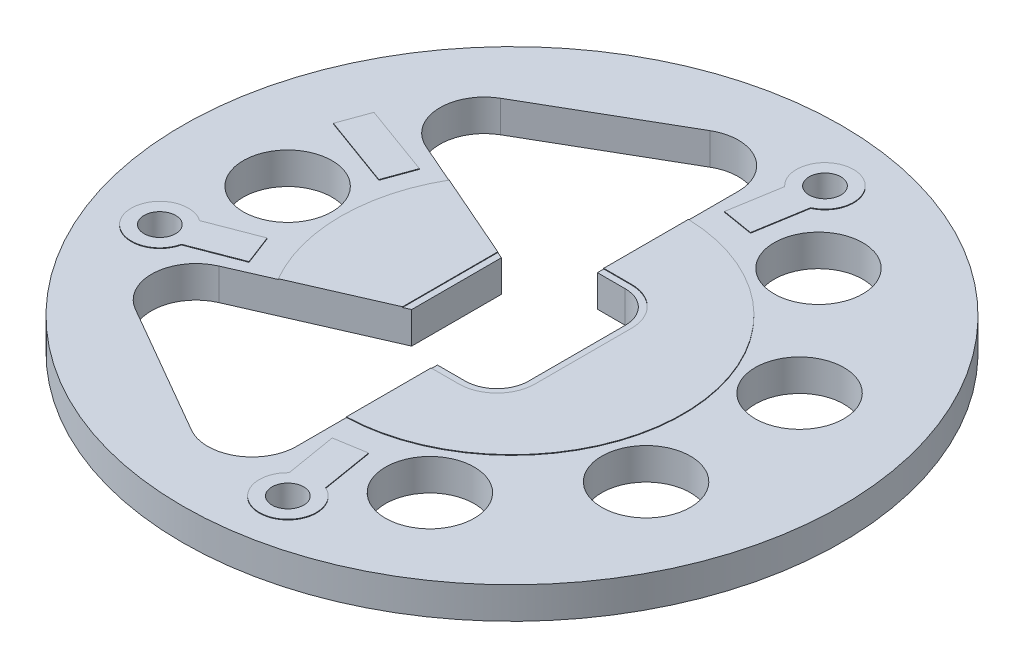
ISO-10303-21;
HEADER;
FILE_DESCRIPTION(('STEP AP214'),'2;1');
FILE_NAME('part.step','',(''),(''),'','','');
FILE_SCHEMA(('AUTOMOTIVE_DESIGN { 1 0 10303 214 1 1 1 1 }'));
ENDSEC;
DATA;
#1=APPLICATION_CONTEXT('core data for automotive mechanical design processes');
#2=APPLICATION_PROTOCOL_DEFINITION('international standard','automotive_design',2000,#1);
#3=PRODUCT_CONTEXT('',#1,'mechanical');
#4=PRODUCT('Part','Part','',(#3));
#5=PRODUCT_RELATED_PRODUCT_CATEGORY('part','',(#4));
#6=PRODUCT_DEFINITION_FORMATION('','',#4);
#7=PRODUCT_DEFINITION_CONTEXT('part definition',#1,'design');
#8=PRODUCT_DEFINITION('design','',#6,#7);
#9=PRODUCT_DEFINITION_SHAPE('','',#8);
#10=(LENGTH_UNIT() NAMED_UNIT(*) SI_UNIT(.MILLI.,.METRE.));
#11=(NAMED_UNIT(*) PLANE_ANGLE_UNIT() SI_UNIT($,.RADIAN.));
#12=(NAMED_UNIT(*) SI_UNIT($,.STERADIAN.) SOLID_ANGLE_UNIT());
#13=UNCERTAINTY_MEASURE_WITH_UNIT(LENGTH_MEASURE(1.E-05),#10,'distance_accuracy_value','');
#14=(GEOMETRIC_REPRESENTATION_CONTEXT(3) GLOBAL_UNCERTAINTY_ASSIGNED_CONTEXT((#13)) GLOBAL_UNIT_ASSIGNED_CONTEXT((#10,
#11,#12)) REPRESENTATION_CONTEXT('',''));
#15=CARTESIAN_POINT('',(0.,0.,0.));
#16=DIRECTION('',(0.,0.,1.));
#17=DIRECTION('',(1.,0.,0.));
#18=AXIS2_PLACEMENT_3D('',#15,#16,#17);
#19=CARTESIAN_POINT('',(0.,0.635,0.));
#20=DIRECTION('',(0.,1.,0.));
#21=DIRECTION('',(0.,0.,1.));
#22=AXIS2_PLACEMENT_3D('',#19,#20,#21);
#23=PLANE('',#22);
#24=DIRECTION('',(-0.916044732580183,0.,-0.401076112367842));
#25=VECTOR('',#24,1.);
#26=CARTESIAN_POINT('',(-1.112012,0.635,-0.898350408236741));
#27=LINE('',#26,#25);
#28=CARTESIAN_POINT('',(-1.112012,0.635,-0.898350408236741));
#29=VERTEX_POINT('',#28);
#30=CARTESIAN_POINT('',(-1.239012,0.635,-0.95395540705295));
#31=VERTEX_POINT('',#30);
#32=EDGE_CURVE('E2030',#29,#31,#27,.T.);
#33=ORIENTED_EDGE('',*,*,#32,.T.);
#34=DIRECTION('',(0.,0.,1.));
#35=VECTOR('',#34,1.);
#36=CARTESIAN_POINT('',(-1.239012,0.635,-0.967905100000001));
#37=LINE('',#36,#35);
#38=CARTESIAN_POINT('',(-1.239012,0.635,0.953955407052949));
#39=VERTEX_POINT('',#38);
#40=EDGE_CURVE('E664',#31,#39,#37,.T.);
#41=ORIENTED_EDGE('',*,*,#40,.T.);
#42=DIRECTION('',(0.916044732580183,0.,-0.401076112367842));
#43=VECTOR('',#42,1.);
#44=CARTESIAN_POINT('',(-1.112012,0.635,0.898350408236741));
#45=LINE('',#44,#43);
#46=CARTESIAN_POINT('',(-1.112012,0.635,0.898350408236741));
#47=VERTEX_POINT('',#46);
#48=EDGE_CURVE('E631',#39,#47,#45,.T.);
#49=ORIENTED_EDGE('',*,*,#48,.T.);
#50=DIRECTION('',(0.,0.,1.));
#51=VECTOR('',#50,1.);
#52=CARTESIAN_POINT('',(-1.112012,0.635,-0.967905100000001));
#53=LINE('',#52,#51);
#54=EDGE_CURVE('E532',#29,#47,#53,.T.);
#55=ORIENTED_EDGE('',*,*,#54,.F.);
#56=EDGE_LOOP('',(#33,#41,#49,#55));
#57=FACE_BOUND('',#56,.T.);
#58=ADVANCED_FACE('F34',(#57),#23,.T.);
#59=CARTESIAN_POINT('',(-3.4439826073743,-0.00100000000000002,-2.88984453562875));
#60=DIRECTION('',(0.,1.,0.));
#61=DIRECTION('',(0.,0.,1.));
#62=AXIS2_PLACEMENT_3D('',#59,#60,#61);
#63=CYLINDRICAL_SURFACE('',#62,0.889);
#64=DIRECTION('',(0.,1.,0.));
#65=VECTOR('',#64,1.);
#66=CARTESIAN_POINT('',(-3.8884826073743,-0.00100000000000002,-3.6597411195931));
#67=LINE('',#66,#65);
#68=CARTESIAN_POINT('',(-3.88848260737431,0.,-3.65974111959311));
#69=VERTEX_POINT('',#68);
#70=CARTESIAN_POINT('',(-3.88848260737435,0.635,-3.65974111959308));
#71=VERTEX_POINT('',#70);
#72=EDGE_CURVE('E2052',#69,#71,#67,.T.);
#73=ORIENTED_EDGE('',*,*,#72,.T.);
#74=CARTESIAN_POINT('',(-3.4439826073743,0.635,-2.88984453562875));
#75=DIRECTION('',(0.,1.,0.));
#76=DIRECTION('',(-0.642787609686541,0.,0.766044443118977));
#77=AXIS2_PLACEMENT_3D('',#74,#75,#76);
#78=CIRCLE('',#77,0.889);
#79=CARTESIAN_POINT('',(-3.80053927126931,0.635,-2.07548076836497));
#80=VERTEX_POINT('',#79);
#81=EDGE_CURVE('E510',#71,#80,#78,.T.);
#82=ORIENTED_EDGE('',*,*,#81,.T.);
#83=DIRECTION('',(0.,1.,0.));
#84=VECTOR('',#83,1.);
#85=CARTESIAN_POINT('',(-3.80053927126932,-0.00100000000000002,-2.07548076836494));
#86=LINE('',#85,#84);
#87=CARTESIAN_POINT('',(-3.80053927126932,0.,-2.07548076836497));
#88=VERTEX_POINT('',#87);
#89=EDGE_CURVE('E2056',#88,#80,#86,.T.);
#90=ORIENTED_EDGE('',*,*,#89,.F.);
#91=CARTESIAN_POINT('',(-3.4439826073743,0.,-2.88984453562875));
#92=DIRECTION('',(0.,1.,0.));
#93=DIRECTION('',(0.,0.,1.));
#94=AXIS2_PLACEMENT_3D('',#91,#92,#93);
#95=CIRCLE('',#94,0.889);
#96=EDGE_CURVE('E519',#88,#69,#95,.F.);
#97=ORIENTED_EDGE('',*,*,#96,.T.);
#98=EDGE_LOOP('',(#73,#82,#90,#97));
#99=FACE_BOUND('',#98,.T.);
#100=ADVANCED_FACE('F1133',(#99),#63,.F.);
#101=CARTESIAN_POINT('',(0.,0.6477,0.));
#102=DIRECTION('',(0.,1.,0.));
#103=DIRECTION('',(0.,0.,1.));
#104=AXIS2_PLACEMENT_3D('',#101,#102,#103);
#105=PLANE('',#104);
#106=DIRECTION('',(-0.916044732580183,0.,-0.401076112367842));
#107=VECTOR('',#106,1.);
#108=CARTESIAN_POINT('',(-1.112012,0.6477,-0.898350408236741));
#109=LINE('',#108,#107);
#110=CARTESIAN_POINT('',(-1.239012,0.6477,-0.95395540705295));
#111=VERTEX_POINT('',#110);
#112=CARTESIAN_POINT('',(-2.97090567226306,0.6477,-1.71223844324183));
#113=VERTEX_POINT('',#112);
#114=EDGE_CURVE('E2004',#111,#113,#109,.T.);
#115=ORIENTED_EDGE('',*,*,#114,.T.);
#116=CARTESIAN_POINT('',(0.,0.6477,0.));
#117=DIRECTION('',(0.,1.,0.));
#118=DIRECTION('',(0.,0.,1.));
#119=AXIS2_PLACEMENT_3D('',#116,#117,#118);
#120=CIRCLE('',#119,3.429);
#121=CARTESIAN_POINT('',(-2.97090567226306,0.6477,1.71223844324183));
#122=VERTEX_POINT('',#121);
#123=EDGE_CURVE('E687',#113,#122,#120,.T.);
#124=ORIENTED_EDGE('',*,*,#123,.T.);
#125=DIRECTION('',(0.916044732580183,0.,-0.401076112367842));
#126=VECTOR('',#125,1.);
#127=CARTESIAN_POINT('',(-1.112012,0.6477,0.898350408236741));
#128=LINE('',#127,#126);
#129=CARTESIAN_POINT('',(-1.239012,0.6477,0.95395540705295));
#130=VERTEX_POINT('',#129);
#131=EDGE_CURVE('E628',#122,#130,#128,.T.);
#132=ORIENTED_EDGE('',*,*,#131,.T.);
#133=DIRECTION('',(0.,0.,1.));
#134=VECTOR('',#133,1.);
#135=CARTESIAN_POINT('',(-1.239012,0.6477,-0.967905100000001));
#136=LINE('',#135,#134);
#137=EDGE_CURVE('E650',#111,#130,#136,.T.);
#138=ORIENTED_EDGE('',*,*,#137,.F.);
#139=EDGE_LOOP('',(#115,#124,#132,#138));
#140=FACE_BOUND('',#139,.T.);
#141=ADVANCED_FACE('F1129',(#140),#105,.T.);
#142=CARTESIAN_POINT('',(0.,0.6477,0.));
#143=DIRECTION('',(0.,-1.,0.));
#144=DIRECTION('',(0.,0.,-1.));
#145=AXIS2_PLACEMENT_3D('',#142,#143,#144);
#146=CYLINDRICAL_SURFACE('',#145,3.429);
#147=ORIENTED_EDGE('',*,*,#123,.F.);
#148=DIRECTION('',(0.,-1.,0.));
#149=VECTOR('',#148,1.);
#150=CARTESIAN_POINT('',(-2.97090567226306,0.6477,-1.71223844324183));
#151=LINE('',#150,#149);
#152=CARTESIAN_POINT('',(-2.97090567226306,0.635,-1.71223844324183));
#153=VERTEX_POINT('',#152);
#154=EDGE_CURVE('E1999',#153,#113,#151,.F.);
#155=ORIENTED_EDGE('',*,*,#154,.F.);
#156=CARTESIAN_POINT('',(0.,0.635,0.));
#157=DIRECTION('',(0.,1.,0.));
#158=DIRECTION('',(0.,0.,1.));
#159=AXIS2_PLACEMENT_3D('',#156,#157,#158);
#160=CIRCLE('',#159,3.429);
#161=CARTESIAN_POINT('',(-2.97090567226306,0.635,1.71223844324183));
#162=VERTEX_POINT('',#161);
#163=EDGE_CURVE('E682',#153,#162,#160,.T.);
#164=ORIENTED_EDGE('',*,*,#163,.T.);
#165=DIRECTION('',(0.,-1.,0.));
#166=VECTOR('',#165,1.);
#167=CARTESIAN_POINT('',(-2.97090567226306,0.6477,1.71223844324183));
#168=LINE('',#167,#166);
#169=EDGE_CURVE('E634',#122,#162,#168,.T.);
#170=ORIENTED_EDGE('',*,*,#169,.F.);
#171=EDGE_LOOP('',(#147,#155,#164,#170));
#172=FACE_BOUND('',#171,.T.);
#173=ADVANCED_FACE('F1238',(#172),#146,.T.);
#174=CARTESIAN_POINT('',(-0.780687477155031,-0.00100000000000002,4.42749869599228));
#175=DIRECTION('',(0.,1.,0.));
#176=DIRECTION('',(0.,0.,1.));
#177=AXIS2_PLACEMENT_3D('',#174,#175,#176);
#178=CYLINDRICAL_SURFACE('',#177,0.889);
#179=DIRECTION('',(0.,1.,0.));
#180=VECTOR('',#179,1.);
#181=CARTESIAN_POINT('',(-1.22518747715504,-0.00100000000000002,5.19739527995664));
#182=LINE('',#181,#180);
#183=CARTESIAN_POINT('',(-1.22518747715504,0.,5.19739527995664));
#184=VERTEX_POINT('',#183);
#185=CARTESIAN_POINT('',(-1.22518747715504,0.635,5.19739527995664));
#186=VERTEX_POINT('',#185);
#187=EDGE_CURVE('E597',#184,#186,#182,.T.);
#188=ORIENTED_EDGE('',*,*,#187,.T.);
#189=CARTESIAN_POINT('',(-0.780687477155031,0.635,4.42749869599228));
#190=DIRECTION('',(0.,1.,0.));
#191=DIRECTION('',(0.984807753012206,0.,0.17364817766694));
#192=AXIS2_PLACEMENT_3D('',#189,#190,#191);
#193=CIRCLE('',#192,0.889);
#194=CARTESIAN_POINT('',(0.108312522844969,0.635,4.42749869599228));
#195=VERTEX_POINT('',#194);
#196=EDGE_CURVE('E1056',#186,#195,#193,.T.);
#197=ORIENTED_EDGE('',*,*,#196,.T.);
#198=DIRECTION('',(0.,1.,0.));
#199=VECTOR('',#198,1.);
#200=CARTESIAN_POINT('',(0.108312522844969,-0.00100000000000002,4.42749869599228));
#201=LINE('',#200,#199);
#202=CARTESIAN_POINT('',(0.108312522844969,0.,4.42749869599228));
#203=VERTEX_POINT('',#202);
#204=EDGE_CURVE('E603',#203,#195,#201,.T.);
#205=ORIENTED_EDGE('',*,*,#204,.F.);
#206=CARTESIAN_POINT('',(-0.780687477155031,0.,4.42749869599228));
#207=DIRECTION('',(0.,1.,0.));
#208=DIRECTION('',(0.,0.,1.));
#209=AXIS2_PLACEMENT_3D('',#206,#207,#208);
#210=CIRCLE('',#209,0.889);
#211=EDGE_CURVE('E1059',#203,#184,#210,.F.);
#212=ORIENTED_EDGE('',*,*,#211,.T.);
#213=EDGE_LOOP('',(#188,#197,#205,#212));
#214=FACE_BOUND('',#213,.T.);
#215=ADVANCED_FACE('F1087',(#214),#178,.F.);
#216=DIRECTION('',(0.866025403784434,0.,-0.500000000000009));
#217=VECTOR('',#216,1.);
#218=CARTESIAN_POINT('',(-3.88848260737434,0.635,-3.65974111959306));
#219=LINE('',#218,#217);
#220=CARTESIAN_POINT('',(-1.22518747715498,0.635,-5.19739527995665));
#221=VERTEX_POINT('',#220);
#222=EDGE_CURVE('E507',#71,#221,#219,.T.);
#223=ORIENTED_EDGE('',*,*,#222,.T.);
#224=CARTESIAN_POINT('',(-0.780687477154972,0.635,-4.42749869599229));
#225=DIRECTION('',(0.,1.,0.));
#226=DIRECTION('',(-0.984807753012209,0.,0.173648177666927));
#227=AXIS2_PLACEMENT_3D('',#224,#225,#226);
#228=CIRCLE('',#227,0.889);
#229=CARTESIAN_POINT('',(0.108312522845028,0.635,-4.42749869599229));
#230=VERTEX_POINT('',#229);
#231=EDGE_CURVE('E498',#230,#221,#228,.T.);
#232=ORIENTED_EDGE('',*,*,#231,.F.);
#233=DIRECTION('',(0.,0.,1.));
#234=VECTOR('',#233,1.);
#235=CARTESIAN_POINT('',(0.108312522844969,0.635,-4.42749869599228));
#236=LINE('',#235,#234);
#237=CARTESIAN_POINT('',(0.108312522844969,0.635,-3.42728892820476));
#238=VERTEX_POINT('',#237);
#239=EDGE_CURVE('E481',#230,#238,#236,.T.);
#240=ORIENTED_EDGE('',*,*,#239,.T.);
#241=CARTESIAN_POINT('',(0.108312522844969,0.635,3.42728892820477));
#242=VERTEX_POINT('',#241);
#243=EDGE_CURVE('E688',#242,#238,#160,.T.);
#244=ORIENTED_EDGE('',*,*,#243,.F.);
#245=DIRECTION('',(0.,0.,1.));
#246=VECTOR('',#245,1.);
#247=CARTESIAN_POINT('',(0.108312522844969,0.635,4.42749869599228));
#248=LINE('',#247,#246);
#249=EDGE_CURVE('E613',#242,#195,#248,.T.);
#250=ORIENTED_EDGE('',*,*,#249,.T.);
#251=ORIENTED_EDGE('',*,*,#196,.F.);
#252=DIRECTION('',(-0.866025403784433,0.,-0.500000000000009));
#253=VECTOR('',#252,1.);
#254=CARTESIAN_POINT('',(-3.88848260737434,0.635,3.65974111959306));
#255=LINE('',#254,#253);
#256=CARTESIAN_POINT('',(-3.88848260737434,0.635,3.65974111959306));
#257=VERTEX_POINT('',#256);
#258=EDGE_CURVE('E616',#186,#257,#255,.T.);
#259=ORIENTED_EDGE('',*,*,#258,.T.);
#260=CARTESIAN_POINT('',(-3.44398260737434,0.635,2.8898445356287));
#261=DIRECTION('',(0.,1.,0.));
#262=DIRECTION('',(0.64278760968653,0.,0.766044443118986));
#263=AXIS2_PLACEMENT_3D('',#260,#261,#262);
#264=CIRCLE('',#263,0.889);
#265=CARTESIAN_POINT('',(-3.80053927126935,0.635,2.07548076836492));
#266=VERTEX_POINT('',#265);
#267=EDGE_CURVE('E1050',#266,#257,#264,.T.);
#268=ORIENTED_EDGE('',*,*,#267,.F.);
#269=DIRECTION('',(0.916044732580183,0.,-0.401076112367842));
#270=VECTOR('',#269,1.);
#271=CARTESIAN_POINT('',(-1.112012,0.635,0.898350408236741));
#272=LINE('',#271,#270);
#273=EDGE_CURVE('E637',#266,#162,#272,.T.);
#274=ORIENTED_EDGE('',*,*,#273,.T.);
#275=ORIENTED_EDGE('',*,*,#163,.F.);
#276=DIRECTION('',(-0.916044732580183,0.,-0.401076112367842));
#277=VECTOR('',#276,1.);
#278=CARTESIAN_POINT('',(-1.112012,0.635,-0.898350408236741));
#279=LINE('',#278,#277);
#280=EDGE_CURVE('E2031',#153,#80,#279,.T.);
#281=ORIENTED_EDGE('',*,*,#280,.T.);
#282=ORIENTED_EDGE('',*,*,#81,.F.);
#283=EDGE_LOOP('',(#223,#232,#240,#244,#250,#251,#259,#268,#274,#275,#281,#282));
#284=FACE_BOUND('',#283,.T.);
#285=DIRECTION('',(0.933418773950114,0.,-0.35878878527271));
#286=VECTOR('',#285,1.);
#287=CARTESIAN_POINT('',(-4.53993276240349,0.635,2.08521299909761));
#288=LINE('',#287,#286);
#289=CARTESIAN_POINT('',(-4.53993276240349,0.635,2.08521299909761));
#290=VERTEX_POINT('',#289);
#291=CARTESIAN_POINT('',(-3.56095427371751,0.635,1.70891190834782));
#292=VERTEX_POINT('',#291);
#293=EDGE_CURVE('E738',#290,#292,#288,.T.);
#294=ORIENTED_EDGE('',*,*,#293,.F.);
#295=CARTESIAN_POINT('',(-5.09739992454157,0.635,1.95934555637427));
#296=DIRECTION('',(0.,1.,0.));
#297=DIRECTION('',(0.,0.,1.));
#298=AXIS2_PLACEMENT_3D('',#295,#296,#297);
#299=CIRCLE('',#298,0.5715);
#300=CARTESIAN_POINT('',(-4.76776364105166,0.635,1.49249207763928));
#301=VERTEX_POINT('',#300);
#302=EDGE_CURVE('E724',#301,#290,#299,.T.);
#303=ORIENTED_EDGE('',*,*,#302,.F.);
#304=DIRECTION('',(-0.933418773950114,0.,0.35878878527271));
#305=VECTOR('',#304,1.);
#306=CARTESIAN_POINT('',(-3.78878515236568,0.635,1.1161909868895));
#307=LINE('',#306,#305);
#308=CARTESIAN_POINT('',(-3.78878515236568,0.635,1.1161909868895));
#309=VERTEX_POINT('',#308);
#310=EDGE_CURVE('E729',#309,#301,#307,.T.);
#311=ORIENTED_EDGE('',*,*,#310,.F.);
#312=DIRECTION('',(-0.358788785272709,0.,-0.933418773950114));
#313=VECTOR('',#312,1.);
#314=CARTESIAN_POINT('',(-3.56095427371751,0.635,1.70891190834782));
#315=LINE('',#314,#313);
#316=EDGE_CURVE('E740',#292,#309,#315,.T.);
#317=ORIENTED_EDGE('',*,*,#316,.F.);
#318=EDGE_LOOP('',(#294,#303,#311,#317));
#319=FACE_BOUND('',#318,.T.);
#320=DIRECTION('',(0.939692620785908,0.,0.34202014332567));
#321=VECTOR('',#320,1.);
#322=CARTESIAN_POINT('',(-3.68472355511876,0.635,-1.016));
#323=LINE('',#322,#321);
#324=CARTESIAN_POINT('',(-5.11681510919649,0.635,-1.53723869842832));
#325=VERTEX_POINT('',#324);
#326=CARTESIAN_POINT('',(-3.68472355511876,0.635,-1.016));
#327=VERTEX_POINT('',#326);
#328=EDGE_CURVE('E799',#325,#327,#323,.T.);
#329=ORIENTED_EDGE('',*,*,#328,.F.);
#330=DIRECTION('',(-0.34202014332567,0.,0.939692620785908));
#331=VECTOR('',#330,1.);
#332=CARTESIAN_POINT('',(-5.11681510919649,0.635,-1.53723869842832));
#333=LINE('',#332,#331);
#334=CARTESIAN_POINT('',(-4.89963231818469,0.635,-2.13394351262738));
#335=VERTEX_POINT('',#334);
#336=EDGE_CURVE('E785',#335,#325,#333,.T.);
#337=ORIENTED_EDGE('',*,*,#336,.F.);
#338=DIRECTION('',(-0.939692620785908,0.,-0.34202014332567));
#339=VECTOR('',#338,1.);
#340=CARTESIAN_POINT('',(-4.89963231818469,0.635,-2.13394351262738));
#341=LINE('',#340,#339);
#342=CARTESIAN_POINT('',(-3.46754076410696,0.635,-1.61270481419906));
#343=VERTEX_POINT('',#342);
#344=EDGE_CURVE('E790',#343,#335,#341,.T.);
#345=ORIENTED_EDGE('',*,*,#344,.F.);
#346=DIRECTION('',(0.34202014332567,0.,-0.939692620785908));
#347=VECTOR('',#346,1.);
#348=CARTESIAN_POINT('',(-3.46754076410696,0.635,-1.61270481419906));
#349=LINE('',#348,#347);
#350=EDGE_CURVE('E801',#327,#343,#349,.T.);
#351=ORIENTED_EDGE('',*,*,#350,.F.);
#352=EDGE_LOOP('',(#329,#337,#345,#351));
#353=FACE_BOUND('',#352,.T.);
#354=CARTESIAN_POINT('',(2.24789999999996,0.635,3.8934770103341));
#355=DIRECTION('',(0.,1.,0.));
#356=DIRECTION('',(0.866025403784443,0.,-0.499999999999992));
#357=AXIS2_PLACEMENT_3D('',#354,#355,#356);
#358=CIRCLE('',#357,0.889);
#359=CARTESIAN_POINT('',(2.24789999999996,0.635,4.7824770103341));
#360=VERTEX_POINT('',#359);
#361=EDGE_CURVE('E1062',#360,#360,#358,.T.);
#362=ORIENTED_EDGE('',*,*,#361,.F.);
#363=EDGE_LOOP('',(#362));
#364=FACE_BOUND('',#363,.T.);
#365=CARTESIAN_POINT('',(4.22467008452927,0.635,1.53765416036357));
#366=DIRECTION('',(0.,1.,0.));
#367=DIRECTION('',(0.342020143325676,0.,-0.939692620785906));
#368=AXIS2_PLACEMENT_3D('',#365,#366,#367);
#369=CIRCLE('',#368,0.889);
#370=CARTESIAN_POINT('',(4.22467008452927,0.635,2.42665416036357));
#371=VERTEX_POINT('',#370);
#372=EDGE_CURVE('E1068',#371,#371,#369,.T.);
#373=ORIENTED_EDGE('',*,*,#372,.F.);
#374=EDGE_LOOP('',(#373));
#375=FACE_BOUND('',#374,.T.);
#376=CARTESIAN_POINT('',(4.2246700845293,0.635,-1.53765416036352));
#377=DIRECTION('',(0.,1.,0.));
#378=DIRECTION('',(-0.342020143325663,0.,-0.939692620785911));
#379=AXIS2_PLACEMENT_3D('',#376,#377,#378);
#380=CIRCLE('',#379,0.889);
#381=CARTESIAN_POINT('',(4.2246700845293,0.635,-0.648654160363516));
#382=VERTEX_POINT('',#381);
#383=EDGE_CURVE('E1074',#382,#382,#380,.T.);
#384=ORIENTED_EDGE('',*,*,#383,.F.);
#385=EDGE_LOOP('',(#384));
#386=FACE_BOUND('',#385,.T.);
#387=CARTESIAN_POINT('',(2.24790000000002,0.635,-3.89347701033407));
#388=DIRECTION('',(0.,1.,0.));
#389=DIRECTION('',(-0.866025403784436,0.,-0.500000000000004));
#390=AXIS2_PLACEMENT_3D('',#387,#388,#389);
#391=CIRCLE('',#390,0.889);
#392=CARTESIAN_POINT('',(2.24790000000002,0.635,-3.00447701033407));
#393=VERTEX_POINT('',#392);
#394=EDGE_CURVE('E513',#393,#393,#391,.T.);
#395=ORIENTED_EDGE('',*,*,#394,.F.);
#396=EDGE_LOOP('',(#395));
#397=FACE_BOUND('',#396,.T.);
#398=CARTESIAN_POINT('',(-4.4958,0.635,0.));
#399=DIRECTION('',(0.,1.,0.));
#400=DIRECTION('',(0.,0.,1.));
#401=AXIS2_PLACEMENT_3D('',#398,#399,#400);
#402=CIRCLE('',#401,0.889);
#403=CARTESIAN_POINT('',(-4.4958,0.635,0.889));
#404=VERTEX_POINT('',#403);
#405=EDGE_CURVE('E522',#404,#404,#402,.T.);
#406=ORIENTED_EDGE('',*,*,#405,.F.);
#407=EDGE_LOOP('',(#406));
#408=FACE_BOUND('',#407,.T.);
#409=CARTESIAN_POINT('',(0.,0.635,0.));
#410=DIRECTION('',(0.,1.,0.));
#411=DIRECTION('',(0.,0.,1.));
#412=AXIS2_PLACEMENT_3D('',#409,#410,#411);
#413=CIRCLE('',#412,6.604);
#414=CARTESIAN_POINT('',(0.,0.635,6.604));
#415=VERTEX_POINT('',#414);
#416=EDGE_CURVE('E11',#415,#415,#413,.T.);
#417=ORIENTED_EDGE('',*,*,#416,.T.);
#418=EDGE_LOOP('',(#417));
#419=FACE_BOUND('',#418,.T.);
#420=DIRECTION('',(-0.1643606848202,0.,0.986400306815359));
#421=VECTOR('',#420,1.);
#422=CARTESIAN_POINT('',(0.332118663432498,0.635,-3.92491642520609));
#423=LINE('',#422,#421);
#424=CARTESIAN_POINT('',(0.504501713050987,0.635,-4.9594624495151));
#425=VERTEX_POINT('',#424);
#426=CARTESIAN_POINT('',(0.332118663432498,0.635,-3.92491642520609));
#427=VERTEX_POINT('',#426);
#428=EDGE_CURVE('E770',#425,#427,#423,.T.);
#429=ORIENTED_EDGE('',*,*,#428,.F.);
#430=CARTESIAN_POINT('',(0.89578644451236,0.635,-5.37600597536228));
#431=DIRECTION('',(0.,1.,0.));
#432=DIRECTION('',(0.,0.,1.));
#433=AXIS2_PLACEMENT_3D('',#430,#431,#432);
#434=CIRCLE('',#433,0.5715);
#435=CARTESIAN_POINT('',(1.13086590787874,0.635,-4.85509341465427));
#436=VERTEX_POINT('',#435);
#437=EDGE_CURVE('E756',#436,#425,#434,.T.);
#438=ORIENTED_EDGE('',*,*,#437,.F.);
#439=DIRECTION('',(0.1643606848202,0.,-0.986400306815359));
#440=VECTOR('',#439,1.);
#441=CARTESIAN_POINT('',(1.13086590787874,0.635,-4.85509341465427));
#442=LINE('',#441,#440);
#443=CARTESIAN_POINT('',(0.958482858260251,0.635,-3.82054739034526));
#444=VERTEX_POINT('',#443);
#445=EDGE_CURVE('E761',#444,#436,#442,.T.);
#446=ORIENTED_EDGE('',*,*,#445,.F.);
#447=DIRECTION('',(0.986400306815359,0.,0.164360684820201));
#448=VECTOR('',#447,1.);
#449=CARTESIAN_POINT('',(0.958482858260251,0.635,-3.82054739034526));
#450=LINE('',#449,#448);
#451=EDGE_CURVE('E772',#427,#444,#450,.T.);
#452=ORIENTED_EDGE('',*,*,#451,.F.);
#453=EDGE_LOOP('',(#429,#438,#446,#452));
#454=FACE_BOUND('',#453,.T.);
#455=DIRECTION('',(-0.164033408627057,0.,-0.986454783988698));
#456=VECTOR('',#455,1.);
#457=CARTESIAN_POINT('',(0.958998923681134,0.635,3.83159187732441));
#458=LINE('',#457,#456);
#459=CARTESIAN_POINT('',(1.13103872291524,0.635,4.866195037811));
#460=VERTEX_POINT('',#459);
#461=CARTESIAN_POINT('',(0.958998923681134,0.635,3.83159187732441));
#462=VERTEX_POINT('',#461);
#463=EDGE_CURVE('E706',#460,#462,#458,.T.);
#464=ORIENTED_EDGE('',*,*,#463,.F.);
#465=CARTESIAN_POINT('',(0.895786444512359,0.635,5.38702957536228));
#466=DIRECTION('',(0.,1.,0.));
#467=DIRECTION('',(0.,0.,1.));
#468=AXIS2_PLACEMENT_3D('',#465,#466,#467);
#469=CIRCLE('',#468,0.5715);
#470=CARTESIAN_POINT('',(0.504639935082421,0.635,4.97035625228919));
#471=VERTEX_POINT('',#470);
#472=EDGE_CURVE('E692',#471,#460,#469,.T.);
#473=ORIENTED_EDGE('',*,*,#472,.F.);
#474=DIRECTION('',(0.164033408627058,0.,0.986454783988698));
#475=VECTOR('',#474,1.);
#476=CARTESIAN_POINT('',(0.504639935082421,0.635,4.97035625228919));
#477=LINE('',#476,#475);
#478=CARTESIAN_POINT('',(0.332600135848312,0.635,3.9357530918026));
#479=VERTEX_POINT('',#478);
#480=EDGE_CURVE('E697',#479,#471,#477,.T.);
#481=ORIENTED_EDGE('',*,*,#480,.F.);
#482=DIRECTION('',(-0.986454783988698,0.,0.164033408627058));
#483=VECTOR('',#482,1.);
#484=CARTESIAN_POINT('',(0.332600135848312,0.635,3.9357530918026));
#485=LINE('',#484,#483);
#486=EDGE_CURVE('E708',#462,#479,#485,.T.);
#487=ORIENTED_EDGE('',*,*,#486,.F.);
#488=EDGE_LOOP('',(#464,#473,#481,#487));
#489=FACE_BOUND('',#488,.T.);
#490=ADVANCED_FACE('F504',(#284,#319,#353,#364,#375,#386,#397,#408,#419,#454,#489),#23,.T.);
#491=DIRECTION('',(0.,0.,1.));
#492=VECTOR('',#491,1.);
#493=CARTESIAN_POINT('',(0.108312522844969,0.635,-4.42749869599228));
#494=LINE('',#493,#492);
#495=CARTESIAN_POINT('',(0.10831252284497,0.635,-1.7299051));
#496=VERTEX_POINT('',#495);
#497=CARTESIAN_POINT('',(0.10831252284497,0.635,-1.6029051));
#498=VERTEX_POINT('',#497);
#499=EDGE_CURVE('E57',#496,#498,#494,.T.);
#500=ORIENTED_EDGE('',*,*,#499,.T.);
#501=DIRECTION('',(-1.,0.,0.));
#502=VECTOR('',#501,1.);
#503=CARTESIAN_POINT('',(0.665988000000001,0.635,-1.6029051));
#504=LINE('',#503,#502);
#505=CARTESIAN_POINT('',(0.665988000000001,0.635,-1.6029051));
#506=VERTEX_POINT('',#505);
#507=EDGE_CURVE('E557',#506,#498,#504,.T.);
#508=ORIENTED_EDGE('',*,*,#507,.F.);
#509=CARTESIAN_POINT('',(0.665988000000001,0.635,-0.967905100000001));
#510=DIRECTION('',(0.,1.,0.));
#511=DIRECTION('',(0.,0.,-1.));
#512=AXIS2_PLACEMENT_3D('',#509,#510,#511);
#513=CIRCLE('',#512,0.635);
#514=CARTESIAN_POINT('',(1.300988,0.635,-0.967905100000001));
#515=VERTEX_POINT('',#514);
#516=EDGE_CURVE('E554',#515,#506,#513,.T.);
#517=ORIENTED_EDGE('',*,*,#516,.F.);
#518=DIRECTION('',(0.,0.,-1.));
#519=VECTOR('',#518,1.);
#520=CARTESIAN_POINT('',(1.300988,0.635,-0.967905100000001));
#521=LINE('',#520,#519);
#522=CARTESIAN_POINT('',(1.300988,0.635,0.967905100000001));
#523=VERTEX_POINT('',#522);
#524=EDGE_CURVE('E551',#523,#515,#521,.T.);
#525=ORIENTED_EDGE('',*,*,#524,.F.);
#526=CARTESIAN_POINT('',(0.665988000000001,0.635,0.967905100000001));
#527=DIRECTION('',(0.,1.,0.));
#528=DIRECTION('',(0.,0.,-1.));
#529=AXIS2_PLACEMENT_3D('',#526,#527,#528);
#530=CIRCLE('',#529,0.635);
#531=CARTESIAN_POINT('',(0.665988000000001,0.635,1.6029051));
#532=VERTEX_POINT('',#531);
#533=EDGE_CURVE('E548',#532,#523,#530,.T.);
#534=ORIENTED_EDGE('',*,*,#533,.F.);
#535=DIRECTION('',(1.,0.,0.));
#536=VECTOR('',#535,1.);
#537=CARTESIAN_POINT('',(0.665988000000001,0.635,1.6029051));
#538=LINE('',#537,#536);
#539=CARTESIAN_POINT('',(0.10831252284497,0.635,1.6029051));
#540=VERTEX_POINT('',#539);
#541=EDGE_CURVE('E528',#540,#532,#538,.T.);
#542=ORIENTED_EDGE('',*,*,#541,.F.);
#543=DIRECTION('',(0.,0.,1.));
#544=VECTOR('',#543,1.);
#545=CARTESIAN_POINT('',(0.108312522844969,0.635,4.42749869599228));
#546=LINE('',#545,#544);
#547=CARTESIAN_POINT('',(0.108312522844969,0.635,1.7299051));
#548=VERTEX_POINT('',#547);
#549=EDGE_CURVE('E611',#540,#548,#546,.T.);
#550=ORIENTED_EDGE('',*,*,#549,.T.);
#551=DIRECTION('',(1.,0.,0.));
#552=VECTOR('',#551,1.);
#553=CARTESIAN_POINT('',(-0.477011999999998,0.635,1.7299051));
#554=LINE('',#553,#552);
#555=CARTESIAN_POINT('',(0.665988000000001,0.635,1.7299051));
#556=VERTEX_POINT('',#555);
#557=EDGE_CURVE('E666',#548,#556,#554,.T.);
#558=ORIENTED_EDGE('',*,*,#557,.T.);
#559=CARTESIAN_POINT('',(0.665988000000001,0.635,0.967905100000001));
#560=DIRECTION('',(0.,1.,0.));
#561=DIRECTION('',(0.,0.,1.));
#562=AXIS2_PLACEMENT_3D('',#559,#560,#561);
#563=CIRCLE('',#562,0.762);
#564=CARTESIAN_POINT('',(1.427988,0.635,0.967905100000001));
#565=VERTEX_POINT('',#564);
#566=EDGE_CURVE('E668',#556,#565,#563,.T.);
#567=ORIENTED_EDGE('',*,*,#566,.T.);
#568=DIRECTION('',(0.,0.,-1.));
#569=VECTOR('',#568,1.);
#570=CARTESIAN_POINT('',(1.427988,0.635,0.967905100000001));
#571=LINE('',#570,#569);
#572=CARTESIAN_POINT('',(1.427988,0.635,-0.967905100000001));
#573=VERTEX_POINT('',#572);
#574=EDGE_CURVE('E647',#565,#573,#571,.T.);
#575=ORIENTED_EDGE('',*,*,#574,.T.);
#576=CARTESIAN_POINT('',(0.665988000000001,0.635,-0.967905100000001));
#577=DIRECTION('',(0.,1.,0.));
#578=DIRECTION('',(0.,0.,1.));
#579=AXIS2_PLACEMENT_3D('',#576,#577,#578);
#580=CIRCLE('',#579,0.762);
#581=CARTESIAN_POINT('',(0.665988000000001,0.635,-1.7299051));
#582=VERTEX_POINT('',#581);
#583=EDGE_CURVE('E643',#573,#582,#580,.T.);
#584=ORIENTED_EDGE('',*,*,#583,.T.);
#585=DIRECTION('',(-1.,0.,0.));
#586=VECTOR('',#585,1.);
#587=CARTESIAN_POINT('',(0.665988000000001,0.635,-1.7299051));
#588=LINE('',#587,#586);
#589=EDGE_CURVE('E661',#582,#496,#588,.T.);
#590=ORIENTED_EDGE('',*,*,#589,.T.);
#591=EDGE_LOOP('',(#500,#508,#517,#525,#534,#542,#550,#558,#567,#575,#584,#590));
#592=FACE_BOUND('',#591,.T.);
#593=ADVANCED_FACE('F578',(#592),#23,.T.);
#594=CARTESIAN_POINT('',(0.,0.,0.));
#595=DIRECTION('',(0.,1.,0.));
#596=DIRECTION('',(0.,0.,1.));
#597=AXIS2_PLACEMENT_3D('',#594,#595,#596);
#598=PLANE('',#597);
#599=DIRECTION('',(0.,0.,1.));
#600=VECTOR('',#599,1.);
#601=CARTESIAN_POINT('',(-1.366012,0.,0.323011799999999));
#602=LINE('',#601,#600);
#603=CARTESIAN_POINT('',(-1.366012,0.,-0.311988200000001));
#604=VERTEX_POINT('',#603);
#605=CARTESIAN_POINT('',(-1.366012,0.,0.323011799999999));
#606=VERTEX_POINT('',#605);
#607=EDGE_CURVE('E904',#604,#606,#602,.T.);
#608=ORIENTED_EDGE('',*,*,#607,.F.);
#609=DIRECTION('',(1.,0.,0.));
#610=VECTOR('',#609,1.);
#611=CARTESIAN_POINT('',(-1.366012,0.,-0.311988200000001));
#612=LINE('',#611,#610);
#613=CARTESIAN_POINT('',(-2.636012,0.,-0.311988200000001));
#614=VERTEX_POINT('',#613);
#615=EDGE_CURVE('E909',#614,#604,#612,.T.);
#616=ORIENTED_EDGE('',*,*,#615,.F.);
#617=DIRECTION('',(0.4,0.,-0.916515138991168));
#618=VECTOR('',#617,1.);
#619=CARTESIAN_POINT('',(-2.636012,0.,-0.311988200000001));
#620=LINE('',#619,#618);
#621=CARTESIAN_POINT('',(-3.2795547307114,0.,1.16255343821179));
#622=VERTEX_POINT('',#621);
#623=EDGE_CURVE('E941',#622,#614,#620,.T.);
#624=ORIENTED_EDGE('',*,*,#623,.F.);
#625=DIRECTION('',(0.939692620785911,0.,-0.342020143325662));
#626=VECTOR('',#625,1.);
#627=CARTESIAN_POINT('',(-3.2795547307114,0.,1.16255343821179));
#628=LINE('',#627,#626);
#629=CARTESIAN_POINT('',(-4.67863092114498,0.,1.67177552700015));
#630=VERTEX_POINT('',#629);
#631=EDGE_CURVE('E938',#630,#622,#628,.T.);
#632=ORIENTED_EDGE('',*,*,#631,.F.);
#633=CARTESIAN_POINT('',(-5.09739992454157,0.,1.95934555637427));
#634=DIRECTION('',(0.,-1.,0.));
#635=DIRECTION('',(0.,0.,1.));
#636=AXIS2_PLACEMENT_3D('',#633,#634,#635);
#637=CIRCLE('',#636,0.508);
#638=CARTESIAN_POINT('',(-4.59175780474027,0.,1.91045745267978));
#639=VERTEX_POINT('',#638);
#640=EDGE_CURVE('E935',#639,#630,#637,.T.);
#641=ORIENTED_EDGE('',*,*,#640,.F.);
#642=DIRECTION('',(-0.939692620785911,0.,0.342020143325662));
#643=VECTOR('',#642,1.);
#644=CARTESIAN_POINT('',(-4.59175780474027,0.,1.91045745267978));
#645=LINE('',#644,#643);
#646=CARTESIAN_POINT('',(-3.09032860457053,0.,1.36398191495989));
#647=VERTEX_POINT('',#646);
#648=EDGE_CURVE('E932',#647,#639,#645,.T.);
#649=ORIENTED_EDGE('',*,*,#648,.F.);
#650=DIRECTION('',(-0.4,0.,0.916515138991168));
#651=VECTOR('',#650,1.);
#652=CARTESIAN_POINT('',(-3.09032860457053,0.,1.36398191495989));
#653=LINE('',#652,#651);
#654=CARTESIAN_POINT('',(-2.636012,0.,0.323011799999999));
#655=VERTEX_POINT('',#654);
#656=EDGE_CURVE('E929',#655,#647,#653,.T.);
#657=ORIENTED_EDGE('',*,*,#656,.F.);
#658=DIRECTION('',(-1.,0.,0.));
#659=VECTOR('',#658,1.);
#660=CARTESIAN_POINT('',(-2.636012,0.,0.323011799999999));
#661=LINE('',#660,#659);
#662=EDGE_CURVE('E926',#606,#655,#661,.T.);
#663=ORIENTED_EDGE('',*,*,#662,.F.);
#664=EDGE_LOOP('',(#608,#616,#624,#632,#641,#649,#657,#663));
#665=FACE_BOUND('',#664,.T.);
#666=CARTESIAN_POINT('',(0.,0.,0.));
#667=DIRECTION('',(0.,1.,0.));
#668=DIRECTION('',(0.,0.,1.));
#669=AXIS2_PLACEMENT_3D('',#666,#667,#668);
#670=CIRCLE('',#669,6.604);
#671=CARTESIAN_POINT('',(0.,0.,6.604));
#672=VERTEX_POINT('',#671);
#673=EDGE_CURVE('E38',#672,#672,#670,.T.);
#674=ORIENTED_EDGE('',*,*,#673,.F.);
#675=EDGE_LOOP('',(#674));
#676=FACE_BOUND('',#675,.T.);
#677=CARTESIAN_POINT('',(-4.4958,0.,0.));
#678=DIRECTION('',(0.,1.,0.));
#679=DIRECTION('',(0.,0.,1.));
#680=AXIS2_PLACEMENT_3D('',#677,#678,#679);
#681=CIRCLE('',#680,0.889);
#682=CARTESIAN_POINT('',(-4.4958,0.,0.889));
#683=VERTEX_POINT('',#682);
#684=EDGE_CURVE('E525',#683,#683,#681,.F.);
#685=ORIENTED_EDGE('',*,*,#684,.F.);
#686=EDGE_LOOP('',(#685));
#687=FACE_BOUND('',#686,.T.);
#688=CARTESIAN_POINT('',(-0.780687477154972,0.,-4.42749869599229));
#689=DIRECTION('',(0.,1.,0.));
#690=DIRECTION('',(0.,0.,1.));
#691=AXIS2_PLACEMENT_3D('',#688,#689,#690);
#692=CIRCLE('',#691,0.889);
#693=CARTESIAN_POINT('',(-1.22518747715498,0.,-5.19739527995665));
#694=VERTEX_POINT('',#693);
#695=CARTESIAN_POINT('',(0.108312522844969,0.,-4.42749869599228));
#696=VERTEX_POINT('',#695);
#697=EDGE_CURVE('E500',#694,#696,#692,.F.);
#698=ORIENTED_EDGE('',*,*,#697,.F.);
#699=DIRECTION('',(0.866025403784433,0.,-0.500000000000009));
#700=VECTOR('',#699,1.);
#701=CARTESIAN_POINT('',(-3.88848260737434,0.,-3.65974111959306));
#702=LINE('',#701,#700);
#703=EDGE_CURVE('E49',#69,#694,#702,.T.);
#704=ORIENTED_EDGE('',*,*,#703,.F.);
#705=ORIENTED_EDGE('',*,*,#96,.F.);
#706=DIRECTION('',(-0.916044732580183,0.,-0.401076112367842));
#707=VECTOR('',#706,1.);
#708=CARTESIAN_POINT('',(-1.112012,0.,-0.898350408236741));
#709=LINE('',#708,#707);
#710=CARTESIAN_POINT('',(-1.112012,0.,-0.898350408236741));
#711=VERTEX_POINT('',#710);
#712=EDGE_CURVE('E2040',#711,#88,#709,.T.);
#713=ORIENTED_EDGE('',*,*,#712,.F.);
#714=DIRECTION('',(0.,0.,1.));
#715=VECTOR('',#714,1.);
#716=CARTESIAN_POINT('',(-1.112012,0.,-0.967905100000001));
#717=LINE('',#716,#715);
#718=CARTESIAN_POINT('',(-1.112012,0.,0.898350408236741));
#719=VERTEX_POINT('',#718);
#720=EDGE_CURVE('E544',#711,#719,#717,.T.);
#721=ORIENTED_EDGE('',*,*,#720,.T.);
#722=DIRECTION('',(0.916044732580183,0.,-0.401076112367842));
#723=VECTOR('',#722,1.);
#724=CARTESIAN_POINT('',(-1.112012,0.,0.898350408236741));
#725=LINE('',#724,#723);
#726=CARTESIAN_POINT('',(-3.80053927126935,0.,2.07548076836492));
#727=VERTEX_POINT('',#726);
#728=EDGE_CURVE('E619',#727,#719,#725,.T.);
#729=ORIENTED_EDGE('',*,*,#728,.F.);
#730=CARTESIAN_POINT('',(-3.44398260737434,0.,2.8898445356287));
#731=DIRECTION('',(0.,1.,0.));
#732=DIRECTION('',(0.,0.,1.));
#733=AXIS2_PLACEMENT_3D('',#730,#731,#732);
#734=CIRCLE('',#733,0.889);
#735=CARTESIAN_POINT('',(-3.88848260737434,0.,3.65974111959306));
#736=VERTEX_POINT('',#735);
#737=EDGE_CURVE('E1053',#736,#727,#734,.F.);
#738=ORIENTED_EDGE('',*,*,#737,.F.);
#739=DIRECTION('',(-0.866025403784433,0.,-0.500000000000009));
#740=VECTOR('',#739,1.);
#741=CARTESIAN_POINT('',(-3.88848260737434,0.,3.65974111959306));
#742=LINE('',#741,#740);
#743=EDGE_CURVE('E623',#184,#736,#742,.T.);
#744=ORIENTED_EDGE('',*,*,#743,.F.);
#745=ORIENTED_EDGE('',*,*,#211,.F.);
#746=DIRECTION('',(0.,0.,1.));
#747=VECTOR('',#746,1.);
#748=CARTESIAN_POINT('',(0.108312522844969,0.,4.42749869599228));
#749=LINE('',#748,#747);
#750=CARTESIAN_POINT('',(0.10831252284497,0.,1.6029051));
#751=VERTEX_POINT('',#750);
#752=EDGE_CURVE('E591',#751,#203,#749,.T.);
#753=ORIENTED_EDGE('',*,*,#752,.F.);
#754=DIRECTION('',(1.,0.,0.));
#755=VECTOR('',#754,1.);
#756=CARTESIAN_POINT('',(0.665988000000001,0.,1.6029051));
#757=LINE('',#756,#755);
#758=CARTESIAN_POINT('',(0.665988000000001,0.,1.6029051));
#759=VERTEX_POINT('',#758);
#760=EDGE_CURVE('E529',#751,#759,#757,.T.);
#761=ORIENTED_EDGE('',*,*,#760,.T.);
#762=CARTESIAN_POINT('',(0.665988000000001,0.,0.967905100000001));
#763=DIRECTION('',(0.,1.,0.));
#764=DIRECTION('',(0.,0.,-1.));
#765=AXIS2_PLACEMENT_3D('',#762,#763,#764);
#766=CIRCLE('',#765,0.635);
#767=CARTESIAN_POINT('',(1.300988,0.,0.967905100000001));
#768=VERTEX_POINT('',#767);
#769=EDGE_CURVE('E531',#759,#768,#766,.T.);
#770=ORIENTED_EDGE('',*,*,#769,.T.);
#771=DIRECTION('',(0.,0.,-1.));
#772=VECTOR('',#771,1.);
#773=CARTESIAN_POINT('',(1.300988,0.,-0.967905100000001));
#774=LINE('',#773,#772);
#775=CARTESIAN_POINT('',(1.300988,0.,-0.967905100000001));
#776=VERTEX_POINT('',#775);
#777=EDGE_CURVE('E535',#768,#776,#774,.T.);
#778=ORIENTED_EDGE('',*,*,#777,.T.);
#779=CARTESIAN_POINT('',(0.665988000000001,0.,-0.967905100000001));
#780=DIRECTION('',(0.,1.,0.));
#781=DIRECTION('',(0.,0.,-1.));
#782=AXIS2_PLACEMENT_3D('',#779,#780,#781);
#783=CIRCLE('',#782,0.635);
#784=CARTESIAN_POINT('',(0.665988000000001,0.,-1.6029051));
#785=VERTEX_POINT('',#784);
#786=EDGE_CURVE('E538',#776,#785,#783,.T.);
#787=ORIENTED_EDGE('',*,*,#786,.T.);
#788=DIRECTION('',(-1.,0.,0.));
#789=VECTOR('',#788,1.);
#790=CARTESIAN_POINT('',(0.665988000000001,0.,-1.6029051));
#791=LINE('',#790,#789);
#792=CARTESIAN_POINT('',(0.10831252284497,0.,-1.6029051));
#793=VERTEX_POINT('',#792);
#794=EDGE_CURVE('E541',#785,#793,#791,.T.);
#795=ORIENTED_EDGE('',*,*,#794,.T.);
#796=DIRECTION('',(0.,0.,1.));
#797=VECTOR('',#796,1.);
#798=CARTESIAN_POINT('',(0.108312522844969,0.,-4.42749869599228));
#799=LINE('',#798,#797);
#800=EDGE_CURVE('E2038',#696,#793,#799,.T.);
#801=ORIENTED_EDGE('',*,*,#800,.F.);
#802=EDGE_LOOP('',(#698,#704,#705,#713,#721,#729,#738,#744,#745,#753,#761,#770,#778,#787,#795,#801));
#803=FACE_BOUND('',#802,.T.);
#804=CARTESIAN_POINT('',(2.24790000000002,0.,-3.89347701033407));
#805=DIRECTION('',(0.,1.,0.));
#806=DIRECTION('',(0.,0.,1.));
#807=AXIS2_PLACEMENT_3D('',#804,#805,#806);
#808=CIRCLE('',#807,0.889);
#809=CARTESIAN_POINT('',(2.24790000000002,0.,-3.00447701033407));
#810=VERTEX_POINT('',#809);
#811=EDGE_CURVE('E508',#810,#810,#808,.F.);
#812=ORIENTED_EDGE('',*,*,#811,.F.);
#813=EDGE_LOOP('',(#812));
#814=FACE_BOUND('',#813,.T.);
#815=CARTESIAN_POINT('',(4.2246700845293,0.,-1.53765416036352));
#816=DIRECTION('',(0.,1.,0.));
#817=DIRECTION('',(0.,0.,1.));
#818=AXIS2_PLACEMENT_3D('',#815,#816,#817);
#819=CIRCLE('',#818,0.889);
#820=CARTESIAN_POINT('',(4.2246700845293,0.,-0.648654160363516));
#821=VERTEX_POINT('',#820);
#822=EDGE_CURVE('E1077',#821,#821,#819,.F.);
#823=ORIENTED_EDGE('',*,*,#822,.F.);
#824=EDGE_LOOP('',(#823));
#825=FACE_BOUND('',#824,.T.);
#826=CARTESIAN_POINT('',(4.22467008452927,0.,1.53765416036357));
#827=DIRECTION('',(0.,1.,0.));
#828=DIRECTION('',(0.,0.,1.));
#829=AXIS2_PLACEMENT_3D('',#826,#827,#828);
#830=CIRCLE('',#829,0.889);
#831=CARTESIAN_POINT('',(4.22467008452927,0.,2.42665416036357));
#832=VERTEX_POINT('',#831);
#833=EDGE_CURVE('E1071',#832,#832,#830,.F.);
#834=ORIENTED_EDGE('',*,*,#833,.F.);
#835=EDGE_LOOP('',(#834));
#836=FACE_BOUND('',#835,.T.);
#837=CARTESIAN_POINT('',(2.24789999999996,0.,3.8934770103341));
#838=DIRECTION('',(0.,1.,0.));
#839=DIRECTION('',(0.,0.,1.));
#840=AXIS2_PLACEMENT_3D('',#837,#838,#839);
#841=CIRCLE('',#840,0.889);
#842=CARTESIAN_POINT('',(2.24789999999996,0.,4.7824770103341));
#843=VERTEX_POINT('',#842);
#844=EDGE_CURVE('E1065',#843,#843,#841,.F.);
#845=ORIENTED_EDGE('',*,*,#844,.F.);
#846=EDGE_LOOP('',(#845));
#847=FACE_BOUND('',#846,.T.);
#848=DIRECTION('',(-0.11537599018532,0.,-0.99332189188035));
#849=VECTOR('',#848,1.);
#850=CARTESIAN_POINT('',(0.712884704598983,0.,4.91309819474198));
#851=LINE('',#850,#849);
#852=CARTESIAN_POINT('',(0.712884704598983,0.,4.91309819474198));
#853=VERTEX_POINT('',#852);
#854=CARTESIAN_POINT('',(0.46317174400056,0.,2.7632111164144));
#855=VERTEX_POINT('',#854);
#856=EDGE_CURVE('E969',#853,#855,#851,.T.);
#857=ORIENTED_EDGE('',*,*,#856,.F.);
#858=CARTESIAN_POINT('',(0.895786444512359,0.,5.38702957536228));
#859=DIRECTION('',(0.,-1.,0.));
#860=DIRECTION('',(0.,0.,-1.));
#861=AXIS2_PLACEMENT_3D('',#858,#859,#860);
#862=CIRCLE('',#861,0.508);
#863=CARTESIAN_POINT('',(0.965188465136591,0.,4.88379269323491));
#864=VERTEX_POINT('',#863);
#865=EDGE_CURVE('E974',#864,#853,#862,.T.);
#866=ORIENTED_EDGE('',*,*,#865,.F.);
#867=DIRECTION('',(0.11537599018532,0.,0.99332189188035));
#868=VECTOR('',#867,1.);
#869=CARTESIAN_POINT('',(0.737382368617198,0.,2.9225113));
#870=LINE('',#869,#868);
#871=CARTESIAN_POINT('',(0.737382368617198,0.,2.9225113));
#872=VERTEX_POINT('',#871);
#873=EDGE_CURVE('E1016',#872,#864,#870,.T.);
#874=ORIENTED_EDGE('',*,*,#873,.F.);
#875=DIRECTION('',(-0.920050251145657,0.,0.391800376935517));
#876=VECTOR('',#875,1.);
#877=CARTESIAN_POINT('',(0.737382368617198,0.,2.9225113));
#878=LINE('',#877,#876);
#879=CARTESIAN_POINT('',(2.824988,0.,2.0335113));
#880=VERTEX_POINT('',#879);
#881=EDGE_CURVE('E1013',#880,#872,#878,.T.);
#882=ORIENTED_EDGE('',*,*,#881,.F.);
#883=DIRECTION('',(0.,0.,1.));
#884=VECTOR('',#883,1.);
#885=CARTESIAN_POINT('',(2.824988,0.,0.763511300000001));
#886=LINE('',#885,#884);
#887=CARTESIAN_POINT('',(2.824988,0.,0.763511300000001));
#888=VERTEX_POINT('',#887);
#889=EDGE_CURVE('E1010',#888,#880,#886,.T.);
#890=ORIENTED_EDGE('',*,*,#889,.F.);
#891=DIRECTION('',(1.,0.,0.));
#892=VECTOR('',#891,1.);
#893=CARTESIAN_POINT('',(1.554988,0.,0.763511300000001));
#894=LINE('',#893,#892);
#895=CARTESIAN_POINT('',(1.554988,0.,0.763511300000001));
#896=VERTEX_POINT('',#895);
#897=EDGE_CURVE('E1007',#896,#888,#894,.T.);
#898=ORIENTED_EDGE('',*,*,#897,.F.);
#899=DIRECTION('',(0.,0.,-1.));
#900=VECTOR('',#899,1.);
#901=CARTESIAN_POINT('',(1.554988,0.,1.3985113));
#902=LINE('',#901,#900);
#903=CARTESIAN_POINT('',(1.554988,0.,1.3985113));
#904=VERTEX_POINT('',#903);
#905=EDGE_CURVE('E1004',#904,#896,#902,.T.);
#906=ORIENTED_EDGE('',*,*,#905,.F.);
#907=DIRECTION('',(-1.,0.,0.));
#908=VECTOR('',#907,1.);
#909=CARTESIAN_POINT('',(2.570988,0.,1.3985113));
#910=LINE('',#909,#908);
#911=CARTESIAN_POINT('',(2.570988,0.,1.3985113));
#912=VERTEX_POINT('',#911);
#913=EDGE_CURVE('E1001',#912,#904,#910,.T.);
#914=ORIENTED_EDGE('',*,*,#913,.F.);
#915=DIRECTION('',(0.,0.,-1.));
#916=VECTOR('',#915,1.);
#917=CARTESIAN_POINT('',(2.570988,0.,1.8656044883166));
#918=LINE('',#917,#916);
#919=CARTESIAN_POINT('',(2.570988,0.,1.8656044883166));
#920=VERTEX_POINT('',#919);
#921=EDGE_CURVE('E998',#920,#912,#918,.T.);
#922=ORIENTED_EDGE('',*,*,#921,.F.);
#923=DIRECTION('',(0.920050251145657,0.,-0.391800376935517));
#924=VECTOR('',#923,1.);
#925=CARTESIAN_POINT('',(2.570988,0.,1.8656044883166));
#926=LINE('',#925,#924);
#927=EDGE_CURVE('E995',#855,#920,#926,.T.);
#928=ORIENTED_EDGE('',*,*,#927,.F.);
#929=EDGE_LOOP('',(#857,#866,#874,#882,#890,#898,#906,#914,#922,#928));
#930=FACE_BOUND('',#929,.T.);
#931=CARTESIAN_POINT('',(0.89578644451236,0.,-5.37600597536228));
#932=DIRECTION('',(0.,-1.,0.));
#933=DIRECTION('',(0.,0.,1.));
#934=AXIS2_PLACEMENT_3D('',#931,#932,#933);
#935=CIRCLE('',#934,0.508);
#936=CARTESIAN_POINT('',(0.712884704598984,0.,-4.90207459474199));
#937=VERTEX_POINT('',#936);
#938=CARTESIAN_POINT('',(0.965188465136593,0.,-4.87276909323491));
#939=VERTEX_POINT('',#938);
#940=EDGE_CURVE('E823',#937,#939,#935,.T.);
#941=ORIENTED_EDGE('',*,*,#940,.F.);
#942=DIRECTION('',(0.11537599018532,0.,-0.99332189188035));
#943=VECTOR('',#942,1.);
#944=CARTESIAN_POINT('',(0.712884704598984,0.,-4.90207459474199));
#945=LINE('',#944,#943);
#946=CARTESIAN_POINT('',(0.463171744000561,0.,-2.75218751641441));
#947=VERTEX_POINT('',#946);
#948=EDGE_CURVE('E828',#947,#937,#945,.T.);
#949=ORIENTED_EDGE('',*,*,#948,.F.);
#950=DIRECTION('',(-0.920050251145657,0.,-0.391800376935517));
#951=VECTOR('',#950,1.);
#952=CARTESIAN_POINT('',(2.570988,0.,-1.8545808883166));
#953=LINE('',#952,#951);
#954=CARTESIAN_POINT('',(2.570988,0.,-1.8545808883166));
#955=VERTEX_POINT('',#954);
#956=EDGE_CURVE('E870',#955,#947,#953,.T.);
#957=ORIENTED_EDGE('',*,*,#956,.F.);
#958=DIRECTION('',(0.,0.,-1.));
#959=VECTOR('',#958,1.);
#960=CARTESIAN_POINT('',(2.570988,0.,-1.8545808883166));
#961=LINE('',#960,#959);
#962=CARTESIAN_POINT('',(2.570988,0.,-1.3874877));
#963=VERTEX_POINT('',#962);
#964=EDGE_CURVE('E867',#963,#955,#961,.T.);
#965=ORIENTED_EDGE('',*,*,#964,.F.);
#966=DIRECTION('',(1.,0.,0.));
#967=VECTOR('',#966,1.);
#968=CARTESIAN_POINT('',(2.570988,0.,-1.3874877));
#969=LINE('',#968,#967);
#970=CARTESIAN_POINT('',(1.554988,0.,-1.3874877));
#971=VERTEX_POINT('',#970);
#972=EDGE_CURVE('E864',#971,#963,#969,.T.);
#973=ORIENTED_EDGE('',*,*,#972,.F.);
#974=DIRECTION('',(0.,0.,-1.));
#975=VECTOR('',#974,1.);
#976=CARTESIAN_POINT('',(1.554988,0.,-1.3874877));
#977=LINE('',#976,#975);
#978=CARTESIAN_POINT('',(1.554988,0.,-0.752487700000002));
#979=VERTEX_POINT('',#978);
#980=EDGE_CURVE('E861',#979,#971,#977,.T.);
#981=ORIENTED_EDGE('',*,*,#980,.F.);
#982=DIRECTION('',(-1.,0.,0.));
#983=VECTOR('',#982,1.);
#984=CARTESIAN_POINT('',(1.554988,0.,-0.752487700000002));
#985=LINE('',#984,#983);
#986=CARTESIAN_POINT('',(2.824988,0.,-0.752487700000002));
#987=VERTEX_POINT('',#986);
#988=EDGE_CURVE('E858',#987,#979,#985,.T.);
#989=ORIENTED_EDGE('',*,*,#988,.F.);
#990=DIRECTION('',(0.,0.,1.));
#991=VECTOR('',#990,1.);
#992=CARTESIAN_POINT('',(2.824988,0.,-0.752487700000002));
#993=LINE('',#992,#991);
#994=CARTESIAN_POINT('',(2.824988,0.,-2.0224877));
#995=VERTEX_POINT('',#994);
#996=EDGE_CURVE('E855',#995,#987,#993,.T.);
#997=ORIENTED_EDGE('',*,*,#996,.F.);
#998=DIRECTION('',(0.920050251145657,0.,0.391800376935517));
#999=VECTOR('',#998,1.);
#1000=CARTESIAN_POINT('',(0.737382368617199,0.,-2.9114877));
#1001=LINE('',#1000,#999);
#1002=CARTESIAN_POINT('',(0.737382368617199,0.,-2.9114877));
#1003=VERTEX_POINT('',#1002);
#1004=EDGE_CURVE('E852',#1003,#995,#1001,.T.);
#1005=ORIENTED_EDGE('',*,*,#1004,.F.);
#1006=DIRECTION('',(-0.11537599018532,0.,0.99332189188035));
#1007=VECTOR('',#1006,1.);
#1008=CARTESIAN_POINT('',(0.737382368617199,0.,-2.9114877));
#1009=LINE('',#1008,#1007);
#1010=EDGE_CURVE('E849',#939,#1003,#1009,.T.);
#1011=ORIENTED_EDGE('',*,*,#1010,.F.);
#1012=EDGE_LOOP('',(#941,#949,#957,#965,#973,#981,#989,#997,#1005,#1011));
#1013=FACE_BOUND('',#1012,.T.);
#1014=ADVANCED_FACE('F587',(#665,#676,#687,#803,#814,#825,#836,#847,#930,#1013),#598,.F.);
#1015=CARTESIAN_POINT('',(0.,0.635,0.));
#1016=DIRECTION('',(0.,-1.,0.));
#1017=DIRECTION('',(0.,0.,-1.));
#1018=AXIS2_PLACEMENT_3D('',#1015,#1016,#1017);
#1019=CYLINDRICAL_SURFACE('',#1018,6.604);
#1020=ORIENTED_EDGE('',*,*,#416,.F.);
#1021=EDGE_LOOP('',(#1020));
#1022=FACE_BOUND('',#1021,.T.);
#1023=ORIENTED_EDGE('',*,*,#673,.T.);
#1024=EDGE_LOOP('',(#1023));
#1025=FACE_BOUND('',#1024,.T.);
#1026=ADVANCED_FACE('F36',(#1022,#1025),#1019,.T.);
#1027=CARTESIAN_POINT('',(-1.112012,0.,-0.967905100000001));
#1028=DIRECTION('',(-1.,0.,0.));
#1029=DIRECTION('',(0.,0.,1.));
#1030=AXIS2_PLACEMENT_3D('',#1027,#1028,#1029);
#1031=PLANE('',#1030);
#1032=ORIENTED_EDGE('',*,*,#720,.F.);
#1033=DIRECTION('',(0.,-1.,0.));
#1034=VECTOR('',#1033,1.);
#1035=CARTESIAN_POINT('',(-1.112012,0.6487,-0.898350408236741));
#1036=LINE('',#1035,#1034);
#1037=EDGE_CURVE('E2029',#29,#711,#1036,.T.);
#1038=ORIENTED_EDGE('',*,*,#1037,.F.);
#1039=ORIENTED_EDGE('',*,*,#54,.T.);
#1040=DIRECTION('',(0.,1.,0.));
#1041=VECTOR('',#1040,1.);
#1042=CARTESIAN_POINT('',(-1.112012,0.6487,0.898350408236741));
#1043=LINE('',#1042,#1041);
#1044=EDGE_CURVE('E596',#719,#47,#1043,.T.);
#1045=ORIENTED_EDGE('',*,*,#1044,.F.);
#1046=EDGE_LOOP('',(#1032,#1038,#1039,#1045));
#1047=FACE_BOUND('',#1046,.T.);
#1048=ADVANCED_FACE('F1150',(#1047),#1031,.F.);
#1049=CARTESIAN_POINT('',(0.665988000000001,0.,-1.6029051));
#1050=DIRECTION('',(0.,0.,-1.));
#1051=DIRECTION('',(-1.,0.,0.));
#1052=AXIS2_PLACEMENT_3D('',#1049,#1050,#1051);
#1053=PLANE('',#1052);
#1054=ORIENTED_EDGE('',*,*,#507,.T.);
#1055=DIRECTION('',(0.,1.,0.));
#1056=VECTOR('',#1055,1.);
#1057=CARTESIAN_POINT('',(0.10831252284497,0.6487,-1.6029051));
#1058=LINE('',#1057,#1056);
#1059=EDGE_CURVE('E2051',#793,#498,#1058,.T.);
#1060=ORIENTED_EDGE('',*,*,#1059,.F.);
#1061=ORIENTED_EDGE('',*,*,#794,.F.);
#1062=DIRECTION('',(0.,1.,0.));
#1063=VECTOR('',#1062,1.);
#1064=CARTESIAN_POINT('',(0.665988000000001,0.,-1.6029051));
#1065=LINE('',#1064,#1063);
#1066=EDGE_CURVE('E561',#785,#506,#1065,.T.);
#1067=ORIENTED_EDGE('',*,*,#1066,.T.);
#1068=EDGE_LOOP('',(#1054,#1060,#1061,#1067));
#1069=FACE_BOUND('',#1068,.T.);
#1070=ADVANCED_FACE('F1170',(#1069),#1053,.F.);
#1071=CARTESIAN_POINT('',(0.665988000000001,0.,-0.967905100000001));
#1072=DIRECTION('',(0.,1.,0.));
#1073=DIRECTION('',(0.,0.,1.));
#1074=AXIS2_PLACEMENT_3D('',#1071,#1072,#1073);
#1075=CYLINDRICAL_SURFACE('',#1074,0.635);
#1076=ORIENTED_EDGE('',*,*,#516,.T.);
#1077=ORIENTED_EDGE('',*,*,#1066,.F.);
#1078=ORIENTED_EDGE('',*,*,#786,.F.);
#1079=DIRECTION('',(0.,1.,0.));
#1080=VECTOR('',#1079,1.);
#1081=CARTESIAN_POINT('',(1.300988,0.,-0.967905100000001));
#1082=LINE('',#1081,#1080);
#1083=EDGE_CURVE('E563',#776,#515,#1082,.T.);
#1084=ORIENTED_EDGE('',*,*,#1083,.T.);
#1085=EDGE_LOOP('',(#1076,#1077,#1078,#1084));
#1086=FACE_BOUND('',#1085,.T.);
#1087=ADVANCED_FACE('F1174',(#1086),#1075,.F.);
#1088=CARTESIAN_POINT('',(1.300988,0.,-0.967905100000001));
#1089=DIRECTION('',(1.,0.,0.));
#1090=DIRECTION('',(0.,0.,-1.));
#1091=AXIS2_PLACEMENT_3D('',#1088,#1089,#1090);
#1092=PLANE('',#1091);
#1093=ORIENTED_EDGE('',*,*,#524,.T.);
#1094=ORIENTED_EDGE('',*,*,#1083,.F.);
#1095=ORIENTED_EDGE('',*,*,#777,.F.);
#1096=DIRECTION('',(0.,1.,0.));
#1097=VECTOR('',#1096,1.);
#1098=CARTESIAN_POINT('',(1.300988,0.,0.967905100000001));
#1099=LINE('',#1098,#1097);
#1100=EDGE_CURVE('E565',#768,#523,#1099,.T.);
#1101=ORIENTED_EDGE('',*,*,#1100,.T.);
#1102=EDGE_LOOP('',(#1093,#1094,#1095,#1101));
#1103=FACE_BOUND('',#1102,.T.);
#1104=ADVANCED_FACE('F583',(#1103),#1092,.F.);
#1105=CARTESIAN_POINT('',(0.665988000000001,0.,0.967905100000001));
#1106=DIRECTION('',(0.,1.,0.));
#1107=DIRECTION('',(0.,0.,1.));
#1108=AXIS2_PLACEMENT_3D('',#1105,#1106,#1107);
#1109=CYLINDRICAL_SURFACE('',#1108,0.635);
#1110=ORIENTED_EDGE('',*,*,#533,.T.);
#1111=ORIENTED_EDGE('',*,*,#1100,.F.);
#1112=ORIENTED_EDGE('',*,*,#769,.F.);
#1113=DIRECTION('',(0.,1.,0.));
#1114=VECTOR('',#1113,1.);
#1115=CARTESIAN_POINT('',(0.665988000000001,0.,1.6029051));
#1116=LINE('',#1115,#1114);
#1117=EDGE_CURVE('E546',#759,#532,#1116,.T.);
#1118=ORIENTED_EDGE('',*,*,#1117,.T.);
#1119=EDGE_LOOP('',(#1110,#1111,#1112,#1118));
#1120=FACE_BOUND('',#1119,.T.);
#1121=ADVANCED_FACE('F572',(#1120),#1109,.F.);
#1122=CARTESIAN_POINT('',(0.665988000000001,0.,1.6029051));
#1123=DIRECTION('',(0.,0.,1.));
#1124=DIRECTION('',(1.,0.,0.));
#1125=AXIS2_PLACEMENT_3D('',#1122,#1123,#1124);
#1126=PLANE('',#1125);
#1127=ORIENTED_EDGE('',*,*,#760,.F.);
#1128=DIRECTION('',(0.,-1.,0.));
#1129=VECTOR('',#1128,1.);
#1130=CARTESIAN_POINT('',(0.108312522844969,0.6487,1.6029051));
#1131=LINE('',#1130,#1129);
#1132=EDGE_CURVE('E594',#540,#751,#1131,.T.);
#1133=ORIENTED_EDGE('',*,*,#1132,.F.);
#1134=ORIENTED_EDGE('',*,*,#541,.T.);
#1135=ORIENTED_EDGE('',*,*,#1117,.F.);
#1136=EDGE_LOOP('',(#1127,#1133,#1134,#1135));
#1137=FACE_BOUND('',#1136,.T.);
#1138=ADVANCED_FACE('F593',(#1137),#1126,.F.);
#1139=CARTESIAN_POINT('',(-4.4958,-0.00100000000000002,0.));
#1140=DIRECTION('',(0.,1.,0.));
#1141=DIRECTION('',(0.,0.,1.));
#1142=AXIS2_PLACEMENT_3D('',#1139,#1140,#1141);
#1143=CYLINDRICAL_SURFACE('',#1142,0.889);
#1144=CARTESIAN_POINT('',(-4.4958,0.635,0.889));
#1145=CARTESIAN_POINT('',(-4.4958,0.628385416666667,0.889));
#1146=CARTESIAN_POINT('',(-4.4958,0.621770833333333,0.889));
#1147=CARTESIAN_POINT('',(-4.4958,0.608541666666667,0.889));
#1148=CARTESIAN_POINT('',(-4.4958,0.601927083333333,0.889));
#1149=CARTESIAN_POINT('',(-4.4958,0.588697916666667,0.889));
#1150=CARTESIAN_POINT('',(-4.4958,0.582083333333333,0.889));
#1151=CARTESIAN_POINT('',(-4.4958,0.568854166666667,0.889));
#1152=CARTESIAN_POINT('',(-4.4958,0.562239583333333,0.889));
#1153=CARTESIAN_POINT('',(-4.4958,0.549010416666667,0.889));
#1154=CARTESIAN_POINT('',(-4.4958,0.542395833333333,0.889));
#1155=CARTESIAN_POINT('',(-4.4958,0.529166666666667,0.889));
#1156=CARTESIAN_POINT('',(-4.4958,0.522552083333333,0.889));
#1157=CARTESIAN_POINT('',(-4.4958,0.509322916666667,0.889));
#1158=CARTESIAN_POINT('',(-4.4958,0.502708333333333,0.889));
#1159=CARTESIAN_POINT('',(-4.4958,0.489479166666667,0.889));
#1160=CARTESIAN_POINT('',(-4.4958,0.482864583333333,0.889));
#1161=CARTESIAN_POINT('',(-4.4958,0.469635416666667,0.889));
#1162=CARTESIAN_POINT('',(-4.4958,0.463020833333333,0.889));
#1163=CARTESIAN_POINT('',(-4.4958,0.449791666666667,0.889));
#1164=CARTESIAN_POINT('',(-4.4958,0.443177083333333,0.889));
#1165=CARTESIAN_POINT('',(-4.4958,0.429947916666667,0.889));
#1166=CARTESIAN_POINT('',(-4.4958,0.423333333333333,0.889));
#1167=CARTESIAN_POINT('',(-4.4958,0.410104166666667,0.889));
#1168=CARTESIAN_POINT('',(-4.4958,0.403489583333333,0.889));
#1169=CARTESIAN_POINT('',(-4.4958,0.390260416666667,0.889));
#1170=CARTESIAN_POINT('',(-4.4958,0.383645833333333,0.889));
#1171=CARTESIAN_POINT('',(-4.4958,0.370416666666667,0.889));
#1172=CARTESIAN_POINT('',(-4.4958,0.363802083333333,0.889));
#1173=CARTESIAN_POINT('',(-4.4958,0.350572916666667,0.889));
#1174=CARTESIAN_POINT('',(-4.4958,0.343958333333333,0.889));
#1175=CARTESIAN_POINT('',(-4.4958,0.330729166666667,0.889));
#1176=CARTESIAN_POINT('',(-4.4958,0.324114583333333,0.889));
#1177=CARTESIAN_POINT('',(-4.4958,0.310885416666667,0.889));
#1178=CARTESIAN_POINT('',(-4.4958,0.304270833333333,0.889));
#1179=CARTESIAN_POINT('',(-4.4958,0.291041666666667,0.889));
#1180=CARTESIAN_POINT('',(-4.4958,0.284427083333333,0.889));
#1181=CARTESIAN_POINT('',(-4.4958,0.271197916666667,0.889));
#1182=CARTESIAN_POINT('',(-4.4958,0.264583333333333,0.889));
#1183=CARTESIAN_POINT('',(-4.4958,0.251354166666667,0.889));
#1184=CARTESIAN_POINT('',(-4.4958,0.244739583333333,0.889));
#1185=CARTESIAN_POINT('',(-4.4958,0.231510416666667,0.889));
#1186=CARTESIAN_POINT('',(-4.4958,0.224895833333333,0.889));
#1187=CARTESIAN_POINT('',(-4.4958,0.211666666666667,0.889));
#1188=CARTESIAN_POINT('',(-4.4958,0.205052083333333,0.889));
#1189=CARTESIAN_POINT('',(-4.4958,0.191822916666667,0.889));
#1190=CARTESIAN_POINT('',(-4.4958,0.185208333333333,0.889));
#1191=CARTESIAN_POINT('',(-4.4958,0.171979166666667,0.889));
#1192=CARTESIAN_POINT('',(-4.4958,0.165364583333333,0.889));
#1193=CARTESIAN_POINT('',(-4.4958,0.152135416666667,0.889));
#1194=CARTESIAN_POINT('',(-4.4958,0.145520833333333,0.889));
#1195=CARTESIAN_POINT('',(-4.4958,0.132291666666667,0.889));
#1196=CARTESIAN_POINT('',(-4.4958,0.125677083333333,0.889));
#1197=CARTESIAN_POINT('',(-4.4958,0.112447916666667,0.889));
#1198=CARTESIAN_POINT('',(-4.4958,0.105833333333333,0.889));
#1199=CARTESIAN_POINT('',(-4.4958,0.0926041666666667,0.889));
#1200=CARTESIAN_POINT('',(-4.4958,0.0859895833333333,0.889));
#1201=CARTESIAN_POINT('',(-4.4958,0.0727604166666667,0.889));
#1202=CARTESIAN_POINT('',(-4.4958,0.0661458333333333,0.889));
#1203=CARTESIAN_POINT('',(-4.4958,0.0529166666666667,0.889));
#1204=CARTESIAN_POINT('',(-4.4958,0.0463020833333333,0.889));
#1205=CARTESIAN_POINT('',(-4.4958,0.0330729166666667,0.889));
#1206=CARTESIAN_POINT('',(-4.4958,0.0264583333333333,0.889));
#1207=CARTESIAN_POINT('',(-4.4958,0.0132291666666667,0.889));
#1208=CARTESIAN_POINT('',(-4.4958,0.00661458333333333,0.889));
#1209=CARTESIAN_POINT('',(-4.4958,0.,0.889));
#1210=B_SPLINE_CURVE_WITH_KNOTS('',3,(#1144,#1145,#1146,#1147,#1148,#1149,#1150,#1151,#1152,
#1153,#1154,#1155,#1156,#1157,#1158,#1159,#1160,#1161,#1162,#1163,#1164,#1165,#1166,#1167,#1168,
#1169,#1170,#1171,#1172,#1173,#1174,#1175,#1176,#1177,#1178,#1179,#1180,#1181,#1182,#1183,#1184,
#1185,#1186,#1187,#1188,#1189,#1190,#1191,#1192,#1193,#1194,#1195,#1196,#1197,#1198,#1199,#1200,
#1201,#1202,#1203,#1204,#1205,#1206,#1207,#1208,#1209),.UNSPECIFIED.,.F.,.F.,(4,2,2,2,2,2,2,2,2,
2,2,2,2,2,2,2,2,2,2,2,2,2,2,2,2,2,2,2,2,2,2,2,4),(0.,0.01984375,0.0396875,0.05953125,0.079375,
0.09921875,0.1190625,0.13890625,0.15875,0.17859375,0.1984375,0.21828125,0.238125,0.25796875,
0.2778125,0.29765625,0.3175,0.33734375,0.3571875,0.37703125,0.396875,0.41671875,0.4365625,
0.45640625,0.47625,0.49609375,0.5159375,0.53578125,0.555625,0.57546875,0.5953125,0.61515625,
0.635),.UNSPECIFIED.);
#1211=EDGE_CURVE('BSEAM1158',#404,#683,#1210,.T.);
#1212=ORIENTED_EDGE('',*,*,#405,.T.);
#1213=ORIENTED_EDGE('',*,*,#684,.T.);
#1214=ORIENTED_EDGE('',*,*,#1211,.T.);
#1215=ORIENTED_EDGE('',*,*,#1211,.F.);
#1216=EDGE_LOOP('',(#1212,#1214,#1213,#1215));
#1217=FACE_BOUND('',#1216,.T.);
#1218=ADVANCED_FACE('F1158',(#1217),#1143,.F.);
#1219=CARTESIAN_POINT('',(-0.780687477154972,-0.00100000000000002,-4.42749869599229));
#1220=DIRECTION('',(0.,1.,0.));
#1221=DIRECTION('',(0.,0.,1.));
#1222=AXIS2_PLACEMENT_3D('',#1219,#1220,#1221);
#1223=CYLINDRICAL_SURFACE('',#1222,0.889);
#1224=ORIENTED_EDGE('',*,*,#231,.T.);
#1225=DIRECTION('',(0.,1.,0.));
#1226=VECTOR('',#1225,1.);
#1227=CARTESIAN_POINT('',(-1.22518747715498,-0.00100000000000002,-5.19739527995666));
#1228=LINE('',#1227,#1226);
#1229=EDGE_CURVE('E501',#694,#221,#1228,.T.);
#1230=ORIENTED_EDGE('',*,*,#1229,.F.);
#1231=ORIENTED_EDGE('',*,*,#697,.T.);
#1232=DIRECTION('',(0.,1.,0.));
#1233=VECTOR('',#1232,1.);
#1234=CARTESIAN_POINT('',(0.108312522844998,-0.00100000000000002,-4.42749869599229));
#1235=LINE('',#1234,#1233);
#1236=EDGE_CURVE('E484',#696,#230,#1235,.T.);
#1237=ORIENTED_EDGE('',*,*,#1236,.T.);
#1238=EDGE_LOOP('',(#1224,#1230,#1231,#1237));
#1239=FACE_BOUND('',#1238,.T.);
#1240=ADVANCED_FACE('F497',(#1239),#1223,.F.);
#1241=CARTESIAN_POINT('',(2.24790000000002,-0.00100000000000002,-3.89347701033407));
#1242=DIRECTION('',(0.,1.,0.));
#1243=DIRECTION('',(0.,0.,1.));
#1244=AXIS2_PLACEMENT_3D('',#1241,#1242,#1243);
#1245=CYLINDRICAL_SURFACE('',#1244,0.889);
#1246=CARTESIAN_POINT('',(2.24790000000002,0.635,-3.00447701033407));
#1247=CARTESIAN_POINT('',(2.24790000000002,0.628385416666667,-3.00447701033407));
#1248=CARTESIAN_POINT('',(2.24790000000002,0.621770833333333,-3.00447701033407));
#1249=CARTESIAN_POINT('',(2.24790000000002,0.608541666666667,-3.00447701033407));
#1250=CARTESIAN_POINT('',(2.24790000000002,0.601927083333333,-3.00447701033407));
#1251=CARTESIAN_POINT('',(2.24790000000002,0.588697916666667,-3.00447701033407));
#1252=CARTESIAN_POINT('',(2.24790000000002,0.582083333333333,-3.00447701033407));
#1253=CARTESIAN_POINT('',(2.24790000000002,0.568854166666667,-3.00447701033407));
#1254=CARTESIAN_POINT('',(2.24790000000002,0.562239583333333,-3.00447701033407));
#1255=CARTESIAN_POINT('',(2.24790000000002,0.549010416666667,-3.00447701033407));
#1256=CARTESIAN_POINT('',(2.24790000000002,0.542395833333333,-3.00447701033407));
#1257=CARTESIAN_POINT('',(2.24790000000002,0.529166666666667,-3.00447701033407));
#1258=CARTESIAN_POINT('',(2.24790000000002,0.522552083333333,-3.00447701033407));
#1259=CARTESIAN_POINT('',(2.24790000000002,0.509322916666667,-3.00447701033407));
#1260=CARTESIAN_POINT('',(2.24790000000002,0.502708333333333,-3.00447701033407));
#1261=CARTESIAN_POINT('',(2.24790000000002,0.489479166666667,-3.00447701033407));
#1262=CARTESIAN_POINT('',(2.24790000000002,0.482864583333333,-3.00447701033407));
#1263=CARTESIAN_POINT('',(2.24790000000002,0.469635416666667,-3.00447701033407));
#1264=CARTESIAN_POINT('',(2.24790000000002,0.463020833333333,-3.00447701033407));
#1265=CARTESIAN_POINT('',(2.24790000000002,0.449791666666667,-3.00447701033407));
#1266=CARTESIAN_POINT('',(2.24790000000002,0.443177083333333,-3.00447701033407));
#1267=CARTESIAN_POINT('',(2.24790000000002,0.429947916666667,-3.00447701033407));
#1268=CARTESIAN_POINT('',(2.24790000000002,0.423333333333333,-3.00447701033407));
#1269=CARTESIAN_POINT('',(2.24790000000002,0.410104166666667,-3.00447701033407));
#1270=CARTESIAN_POINT('',(2.24790000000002,0.403489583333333,-3.00447701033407));
#1271=CARTESIAN_POINT('',(2.24790000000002,0.390260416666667,-3.00447701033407));
#1272=CARTESIAN_POINT('',(2.24790000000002,0.383645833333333,-3.00447701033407));
#1273=CARTESIAN_POINT('',(2.24790000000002,0.370416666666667,-3.00447701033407));
#1274=CARTESIAN_POINT('',(2.24790000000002,0.363802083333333,-3.00447701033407));
#1275=CARTESIAN_POINT('',(2.24790000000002,0.350572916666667,-3.00447701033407));
#1276=CARTESIAN_POINT('',(2.24790000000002,0.343958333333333,-3.00447701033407));
#1277=CARTESIAN_POINT('',(2.24790000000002,0.330729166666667,-3.00447701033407));
#1278=CARTESIAN_POINT('',(2.24790000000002,0.324114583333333,-3.00447701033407));
#1279=CARTESIAN_POINT('',(2.24790000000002,0.310885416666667,-3.00447701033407));
#1280=CARTESIAN_POINT('',(2.24790000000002,0.304270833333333,-3.00447701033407));
#1281=CARTESIAN_POINT('',(2.24790000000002,0.291041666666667,-3.00447701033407));
#1282=CARTESIAN_POINT('',(2.24790000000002,0.284427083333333,-3.00447701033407));
#1283=CARTESIAN_POINT('',(2.24790000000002,0.271197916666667,-3.00447701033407));
#1284=CARTESIAN_POINT('',(2.24790000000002,0.264583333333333,-3.00447701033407));
#1285=CARTESIAN_POINT('',(2.24790000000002,0.251354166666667,-3.00447701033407));
#1286=CARTESIAN_POINT('',(2.24790000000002,0.244739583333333,-3.00447701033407));
#1287=CARTESIAN_POINT('',(2.24790000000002,0.231510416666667,-3.00447701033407));
#1288=CARTESIAN_POINT('',(2.24790000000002,0.224895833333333,-3.00447701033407));
#1289=CARTESIAN_POINT('',(2.24790000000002,0.211666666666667,-3.00447701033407));
#1290=CARTESIAN_POINT('',(2.24790000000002,0.205052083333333,-3.00447701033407));
#1291=CARTESIAN_POINT('',(2.24790000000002,0.191822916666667,-3.00447701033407));
#1292=CARTESIAN_POINT('',(2.24790000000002,0.185208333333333,-3.00447701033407));
#1293=CARTESIAN_POINT('',(2.24790000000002,0.171979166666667,-3.00447701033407));
#1294=CARTESIAN_POINT('',(2.24790000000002,0.165364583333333,-3.00447701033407));
#1295=CARTESIAN_POINT('',(2.24790000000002,0.152135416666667,-3.00447701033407));
#1296=CARTESIAN_POINT('',(2.24790000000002,0.145520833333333,-3.00447701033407));
#1297=CARTESIAN_POINT('',(2.24790000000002,0.132291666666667,-3.00447701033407));
#1298=CARTESIAN_POINT('',(2.24790000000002,0.125677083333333,-3.00447701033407));
#1299=CARTESIAN_POINT('',(2.24790000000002,0.112447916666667,-3.00447701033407));
#1300=CARTESIAN_POINT('',(2.24790000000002,0.105833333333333,-3.00447701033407));
#1301=CARTESIAN_POINT('',(2.24790000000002,0.0926041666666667,-3.00447701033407));
#1302=CARTESIAN_POINT('',(2.24790000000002,0.0859895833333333,-3.00447701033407));
#1303=CARTESIAN_POINT('',(2.24790000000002,0.0727604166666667,-3.00447701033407));
#1304=CARTESIAN_POINT('',(2.24790000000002,0.0661458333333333,-3.00447701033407));
#1305=CARTESIAN_POINT('',(2.24790000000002,0.0529166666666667,-3.00447701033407));
#1306=CARTESIAN_POINT('',(2.24790000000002,0.0463020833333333,-3.00447701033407));
#1307=CARTESIAN_POINT('',(2.24790000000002,0.0330729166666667,-3.00447701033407));
#1308=CARTESIAN_POINT('',(2.24790000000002,0.0264583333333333,-3.00447701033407));
#1309=CARTESIAN_POINT('',(2.24790000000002,0.0132291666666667,-3.00447701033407));
#1310=CARTESIAN_POINT('',(2.24790000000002,0.00661458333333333,-3.00447701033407));
#1311=CARTESIAN_POINT('',(2.24790000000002,0.,-3.00447701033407));
#1312=B_SPLINE_CURVE_WITH_KNOTS('',3,(#1246,#1247,#1248,#1249,#1250,#1251,#1252,#1253,#1254,
#1255,#1256,#1257,#1258,#1259,#1260,#1261,#1262,#1263,#1264,#1265,#1266,#1267,#1268,#1269,#1270,
#1271,#1272,#1273,#1274,#1275,#1276,#1277,#1278,#1279,#1280,#1281,#1282,#1283,#1284,#1285,#1286,
#1287,#1288,#1289,#1290,#1291,#1292,#1293,#1294,#1295,#1296,#1297,#1298,#1299,#1300,#1301,#1302,
#1303,#1304,#1305,#1306,#1307,#1308,#1309,#1310,#1311),.UNSPECIFIED.,.F.,.F.,(4,2,2,2,2,2,2,2,2,
2,2,2,2,2,2,2,2,2,2,2,2,2,2,2,2,2,2,2,2,2,2,2,4),(0.,0.01984375,0.0396875,0.05953125,0.079375,
0.09921875,0.1190625,0.13890625,0.15875,0.17859375,0.1984375,0.21828125,0.238125,0.25796875,
0.2778125,0.29765625,0.3175,0.33734375,0.3571875,0.37703125,0.396875,0.41671875,0.4365625,
0.45640625,0.47625,0.49609375,0.5159375,0.53578125,0.555625,0.57546875,0.5953125,0.61515625,
0.635),.UNSPECIFIED.);
#1313=EDGE_CURVE('BSEAM1082',#393,#810,#1312,.T.);
#1314=ORIENTED_EDGE('',*,*,#394,.T.);
#1315=ORIENTED_EDGE('',*,*,#811,.T.);
#1316=ORIENTED_EDGE('',*,*,#1313,.T.);
#1317=ORIENTED_EDGE('',*,*,#1313,.F.);
#1318=EDGE_LOOP('',(#1314,#1316,#1315,#1317));
#1319=FACE_BOUND('',#1318,.T.);
#1320=ADVANCED_FACE('F1082',(#1319),#1245,.F.);
#1321=CARTESIAN_POINT('',(4.2246700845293,-0.00100000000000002,-1.53765416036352));
#1322=DIRECTION('',(0.,1.,0.));
#1323=DIRECTION('',(0.,0.,1.));
#1324=AXIS2_PLACEMENT_3D('',#1321,#1322,#1323);
#1325=CYLINDRICAL_SURFACE('',#1324,0.889);
#1326=CARTESIAN_POINT('',(4.2246700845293,0.635,-0.648654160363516));
#1327=CARTESIAN_POINT('',(4.2246700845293,0.628385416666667,-0.648654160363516));
#1328=CARTESIAN_POINT('',(4.2246700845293,0.621770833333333,-0.648654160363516));
#1329=CARTESIAN_POINT('',(4.2246700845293,0.608541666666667,-0.648654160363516));
#1330=CARTESIAN_POINT('',(4.2246700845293,0.601927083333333,-0.648654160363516));
#1331=CARTESIAN_POINT('',(4.2246700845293,0.588697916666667,-0.648654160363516));
#1332=CARTESIAN_POINT('',(4.2246700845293,0.582083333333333,-0.648654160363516));
#1333=CARTESIAN_POINT('',(4.2246700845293,0.568854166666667,-0.648654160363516));
#1334=CARTESIAN_POINT('',(4.2246700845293,0.562239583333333,-0.648654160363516));
#1335=CARTESIAN_POINT('',(4.2246700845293,0.549010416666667,-0.648654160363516));
#1336=CARTESIAN_POINT('',(4.2246700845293,0.542395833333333,-0.648654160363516));
#1337=CARTESIAN_POINT('',(4.2246700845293,0.529166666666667,-0.648654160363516));
#1338=CARTESIAN_POINT('',(4.2246700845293,0.522552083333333,-0.648654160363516));
#1339=CARTESIAN_POINT('',(4.2246700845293,0.509322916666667,-0.648654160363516));
#1340=CARTESIAN_POINT('',(4.2246700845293,0.502708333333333,-0.648654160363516));
#1341=CARTESIAN_POINT('',(4.2246700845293,0.489479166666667,-0.648654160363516));
#1342=CARTESIAN_POINT('',(4.2246700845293,0.482864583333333,-0.648654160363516));
#1343=CARTESIAN_POINT('',(4.2246700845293,0.469635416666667,-0.648654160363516));
#1344=CARTESIAN_POINT('',(4.2246700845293,0.463020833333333,-0.648654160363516));
#1345=CARTESIAN_POINT('',(4.2246700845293,0.449791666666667,-0.648654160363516));
#1346=CARTESIAN_POINT('',(4.2246700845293,0.443177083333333,-0.648654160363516));
#1347=CARTESIAN_POINT('',(4.2246700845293,0.429947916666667,-0.648654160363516));
#1348=CARTESIAN_POINT('',(4.2246700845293,0.423333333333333,-0.648654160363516));
#1349=CARTESIAN_POINT('',(4.2246700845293,0.410104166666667,-0.648654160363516));
#1350=CARTESIAN_POINT('',(4.2246700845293,0.403489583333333,-0.648654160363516));
#1351=CARTESIAN_POINT('',(4.2246700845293,0.390260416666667,-0.648654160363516));
#1352=CARTESIAN_POINT('',(4.2246700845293,0.383645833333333,-0.648654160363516));
#1353=CARTESIAN_POINT('',(4.2246700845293,0.370416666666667,-0.648654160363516));
#1354=CARTESIAN_POINT('',(4.2246700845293,0.363802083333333,-0.648654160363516));
#1355=CARTESIAN_POINT('',(4.2246700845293,0.350572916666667,-0.648654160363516));
#1356=CARTESIAN_POINT('',(4.2246700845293,0.343958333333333,-0.648654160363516));
#1357=CARTESIAN_POINT('',(4.2246700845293,0.330729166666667,-0.648654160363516));
#1358=CARTESIAN_POINT('',(4.2246700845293,0.324114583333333,-0.648654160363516));
#1359=CARTESIAN_POINT('',(4.2246700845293,0.310885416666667,-0.648654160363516));
#1360=CARTESIAN_POINT('',(4.2246700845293,0.304270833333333,-0.648654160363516));
#1361=CARTESIAN_POINT('',(4.2246700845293,0.291041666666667,-0.648654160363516));
#1362=CARTESIAN_POINT('',(4.2246700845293,0.284427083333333,-0.648654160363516));
#1363=CARTESIAN_POINT('',(4.2246700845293,0.271197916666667,-0.648654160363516));
#1364=CARTESIAN_POINT('',(4.2246700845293,0.264583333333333,-0.648654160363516));
#1365=CARTESIAN_POINT('',(4.2246700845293,0.251354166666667,-0.648654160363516));
#1366=CARTESIAN_POINT('',(4.2246700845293,0.244739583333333,-0.648654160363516));
#1367=CARTESIAN_POINT('',(4.2246700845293,0.231510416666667,-0.648654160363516));
#1368=CARTESIAN_POINT('',(4.2246700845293,0.224895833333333,-0.648654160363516));
#1369=CARTESIAN_POINT('',(4.2246700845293,0.211666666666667,-0.648654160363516));
#1370=CARTESIAN_POINT('',(4.2246700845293,0.205052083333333,-0.648654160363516));
#1371=CARTESIAN_POINT('',(4.2246700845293,0.191822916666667,-0.648654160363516));
#1372=CARTESIAN_POINT('',(4.2246700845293,0.185208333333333,-0.648654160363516));
#1373=CARTESIAN_POINT('',(4.2246700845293,0.171979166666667,-0.648654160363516));
#1374=CARTESIAN_POINT('',(4.2246700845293,0.165364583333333,-0.648654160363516));
#1375=CARTESIAN_POINT('',(4.2246700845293,0.152135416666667,-0.648654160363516));
#1376=CARTESIAN_POINT('',(4.2246700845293,0.145520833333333,-0.648654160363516));
#1377=CARTESIAN_POINT('',(4.2246700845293,0.132291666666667,-0.648654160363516));
#1378=CARTESIAN_POINT('',(4.2246700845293,0.125677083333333,-0.648654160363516));
#1379=CARTESIAN_POINT('',(4.2246700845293,0.112447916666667,-0.648654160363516));
#1380=CARTESIAN_POINT('',(4.2246700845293,0.105833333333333,-0.648654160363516));
#1381=CARTESIAN_POINT('',(4.2246700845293,0.0926041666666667,-0.648654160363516));
#1382=CARTESIAN_POINT('',(4.2246700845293,0.0859895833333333,-0.648654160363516));
#1383=CARTESIAN_POINT('',(4.2246700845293,0.0727604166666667,-0.648654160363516));
#1384=CARTESIAN_POINT('',(4.2246700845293,0.0661458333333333,-0.648654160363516));
#1385=CARTESIAN_POINT('',(4.2246700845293,0.0529166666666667,-0.648654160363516));
#1386=CARTESIAN_POINT('',(4.2246700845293,0.0463020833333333,-0.648654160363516));
#1387=CARTESIAN_POINT('',(4.2246700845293,0.0330729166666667,-0.648654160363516));
#1388=CARTESIAN_POINT('',(4.2246700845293,0.0264583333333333,-0.648654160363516));
#1389=CARTESIAN_POINT('',(4.2246700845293,0.0132291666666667,-0.648654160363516));
#1390=CARTESIAN_POINT('',(4.2246700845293,0.00661458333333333,-0.648654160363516));
#1391=CARTESIAN_POINT('',(4.2246700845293,0.,-0.648654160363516));
#1392=B_SPLINE_CURVE_WITH_KNOTS('',3,(#1326,#1327,#1328,#1329,#1330,#1331,#1332,#1333,#1334,
#1335,#1336,#1337,#1338,#1339,#1340,#1341,#1342,#1343,#1344,#1345,#1346,#1347,#1348,#1349,#1350,
#1351,#1352,#1353,#1354,#1355,#1356,#1357,#1358,#1359,#1360,#1361,#1362,#1363,#1364,#1365,#1366,
#1367,#1368,#1369,#1370,#1371,#1372,#1373,#1374,#1375,#1376,#1377,#1378,#1379,#1380,#1381,#1382,
#1383,#1384,#1385,#1386,#1387,#1388,#1389,#1390,#1391),.UNSPECIFIED.,.F.,.F.,(4,2,2,2,2,2,2,2,2,
2,2,2,2,2,2,2,2,2,2,2,2,2,2,2,2,2,2,2,2,2,2,2,4),(0.,0.01984375,0.0396875,0.05953125,0.079375,
0.09921875,0.1190625,0.13890625,0.15875,0.17859375,0.1984375,0.21828125,0.238125,0.25796875,
0.2778125,0.29765625,0.3175,0.33734375,0.3571875,0.37703125,0.396875,0.41671875,0.4365625,
0.45640625,0.47625,0.49609375,0.5159375,0.53578125,0.555625,0.57546875,0.5953125,0.61515625,
0.635),.UNSPECIFIED.);
#1393=EDGE_CURVE('BSEAM1551',#382,#821,#1392,.T.);
#1394=ORIENTED_EDGE('',*,*,#383,.T.);
#1395=ORIENTED_EDGE('',*,*,#822,.T.);
#1396=ORIENTED_EDGE('',*,*,#1393,.T.);
#1397=ORIENTED_EDGE('',*,*,#1393,.F.);
#1398=EDGE_LOOP('',(#1394,#1396,#1395,#1397));
#1399=FACE_BOUND('',#1398,.T.);
#1400=ADVANCED_FACE('F1551',(#1399),#1325,.F.);
#1401=CARTESIAN_POINT('',(4.22467008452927,-0.00100000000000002,1.53765416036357));
#1402=DIRECTION('',(0.,1.,0.));
#1403=DIRECTION('',(0.,0.,1.));
#1404=AXIS2_PLACEMENT_3D('',#1401,#1402,#1403);
#1405=CYLINDRICAL_SURFACE('',#1404,0.889);
#1406=CARTESIAN_POINT('',(4.22467008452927,0.635,2.42665416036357));
#1407=CARTESIAN_POINT('',(4.22467008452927,0.628385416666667,2.42665416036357));
#1408=CARTESIAN_POINT('',(4.22467008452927,0.621770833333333,2.42665416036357));
#1409=CARTESIAN_POINT('',(4.22467008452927,0.608541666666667,2.42665416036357));
#1410=CARTESIAN_POINT('',(4.22467008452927,0.601927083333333,2.42665416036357));
#1411=CARTESIAN_POINT('',(4.22467008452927,0.588697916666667,2.42665416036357));
#1412=CARTESIAN_POINT('',(4.22467008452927,0.582083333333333,2.42665416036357));
#1413=CARTESIAN_POINT('',(4.22467008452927,0.568854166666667,2.42665416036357));
#1414=CARTESIAN_POINT('',(4.22467008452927,0.562239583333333,2.42665416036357));
#1415=CARTESIAN_POINT('',(4.22467008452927,0.549010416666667,2.42665416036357));
#1416=CARTESIAN_POINT('',(4.22467008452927,0.542395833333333,2.42665416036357));
#1417=CARTESIAN_POINT('',(4.22467008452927,0.529166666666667,2.42665416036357));
#1418=CARTESIAN_POINT('',(4.22467008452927,0.522552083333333,2.42665416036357));
#1419=CARTESIAN_POINT('',(4.22467008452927,0.509322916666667,2.42665416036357));
#1420=CARTESIAN_POINT('',(4.22467008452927,0.502708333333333,2.42665416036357));
#1421=CARTESIAN_POINT('',(4.22467008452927,0.489479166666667,2.42665416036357));
#1422=CARTESIAN_POINT('',(4.22467008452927,0.482864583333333,2.42665416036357));
#1423=CARTESIAN_POINT('',(4.22467008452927,0.469635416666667,2.42665416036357));
#1424=CARTESIAN_POINT('',(4.22467008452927,0.463020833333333,2.42665416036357));
#1425=CARTESIAN_POINT('',(4.22467008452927,0.449791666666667,2.42665416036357));
#1426=CARTESIAN_POINT('',(4.22467008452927,0.443177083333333,2.42665416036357));
#1427=CARTESIAN_POINT('',(4.22467008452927,0.429947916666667,2.42665416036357));
#1428=CARTESIAN_POINT('',(4.22467008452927,0.423333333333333,2.42665416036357));
#1429=CARTESIAN_POINT('',(4.22467008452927,0.410104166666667,2.42665416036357));
#1430=CARTESIAN_POINT('',(4.22467008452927,0.403489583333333,2.42665416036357));
#1431=CARTESIAN_POINT('',(4.22467008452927,0.390260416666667,2.42665416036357));
#1432=CARTESIAN_POINT('',(4.22467008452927,0.383645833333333,2.42665416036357));
#1433=CARTESIAN_POINT('',(4.22467008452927,0.370416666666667,2.42665416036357));
#1434=CARTESIAN_POINT('',(4.22467008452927,0.363802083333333,2.42665416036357));
#1435=CARTESIAN_POINT('',(4.22467008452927,0.350572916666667,2.42665416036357));
#1436=CARTESIAN_POINT('',(4.22467008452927,0.343958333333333,2.42665416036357));
#1437=CARTESIAN_POINT('',(4.22467008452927,0.330729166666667,2.42665416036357));
#1438=CARTESIAN_POINT('',(4.22467008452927,0.324114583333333,2.42665416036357));
#1439=CARTESIAN_POINT('',(4.22467008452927,0.310885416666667,2.42665416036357));
#1440=CARTESIAN_POINT('',(4.22467008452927,0.304270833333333,2.42665416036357));
#1441=CARTESIAN_POINT('',(4.22467008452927,0.291041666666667,2.42665416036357));
#1442=CARTESIAN_POINT('',(4.22467008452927,0.284427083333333,2.42665416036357));
#1443=CARTESIAN_POINT('',(4.22467008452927,0.271197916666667,2.42665416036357));
#1444=CARTESIAN_POINT('',(4.22467008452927,0.264583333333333,2.42665416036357));
#1445=CARTESIAN_POINT('',(4.22467008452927,0.251354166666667,2.42665416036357));
#1446=CARTESIAN_POINT('',(4.22467008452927,0.244739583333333,2.42665416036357));
#1447=CARTESIAN_POINT('',(4.22467008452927,0.231510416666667,2.42665416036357));
#1448=CARTESIAN_POINT('',(4.22467008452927,0.224895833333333,2.42665416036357));
#1449=CARTESIAN_POINT('',(4.22467008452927,0.211666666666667,2.42665416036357));
#1450=CARTESIAN_POINT('',(4.22467008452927,0.205052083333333,2.42665416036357));
#1451=CARTESIAN_POINT('',(4.22467008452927,0.191822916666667,2.42665416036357));
#1452=CARTESIAN_POINT('',(4.22467008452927,0.185208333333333,2.42665416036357));
#1453=CARTESIAN_POINT('',(4.22467008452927,0.171979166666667,2.42665416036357));
#1454=CARTESIAN_POINT('',(4.22467008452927,0.165364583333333,2.42665416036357));
#1455=CARTESIAN_POINT('',(4.22467008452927,0.152135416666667,2.42665416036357));
#1456=CARTESIAN_POINT('',(4.22467008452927,0.145520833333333,2.42665416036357));
#1457=CARTESIAN_POINT('',(4.22467008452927,0.132291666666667,2.42665416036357));
#1458=CARTESIAN_POINT('',(4.22467008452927,0.125677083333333,2.42665416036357));
#1459=CARTESIAN_POINT('',(4.22467008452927,0.112447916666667,2.42665416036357));
#1460=CARTESIAN_POINT('',(4.22467008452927,0.105833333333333,2.42665416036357));
#1461=CARTESIAN_POINT('',(4.22467008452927,0.0926041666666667,2.42665416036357));
#1462=CARTESIAN_POINT('',(4.22467008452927,0.0859895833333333,2.42665416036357));
#1463=CARTESIAN_POINT('',(4.22467008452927,0.0727604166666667,2.42665416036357));
#1464=CARTESIAN_POINT('',(4.22467008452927,0.0661458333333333,2.42665416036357));
#1465=CARTESIAN_POINT('',(4.22467008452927,0.0529166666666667,2.42665416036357));
#1466=CARTESIAN_POINT('',(4.22467008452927,0.0463020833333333,2.42665416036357));
#1467=CARTESIAN_POINT('',(4.22467008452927,0.0330729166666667,2.42665416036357));
#1468=CARTESIAN_POINT('',(4.22467008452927,0.0264583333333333,2.42665416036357));
#1469=CARTESIAN_POINT('',(4.22467008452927,0.0132291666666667,2.42665416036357));
#1470=CARTESIAN_POINT('',(4.22467008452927,0.00661458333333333,2.42665416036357));
#1471=CARTESIAN_POINT('',(4.22467008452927,0.,2.42665416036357));
#1472=B_SPLINE_CURVE_WITH_KNOTS('',3,(#1406,#1407,#1408,#1409,#1410,#1411,#1412,#1413,#1414,
#1415,#1416,#1417,#1418,#1419,#1420,#1421,#1422,#1423,#1424,#1425,#1426,#1427,#1428,#1429,#1430,
#1431,#1432,#1433,#1434,#1435,#1436,#1437,#1438,#1439,#1440,#1441,#1442,#1443,#1444,#1445,#1446,
#1447,#1448,#1449,#1450,#1451,#1452,#1453,#1454,#1455,#1456,#1457,#1458,#1459,#1460,#1461,#1462,
#1463,#1464,#1465,#1466,#1467,#1468,#1469,#1470,#1471),.UNSPECIFIED.,.F.,.F.,(4,2,2,2,2,2,2,2,2,
2,2,2,2,2,2,2,2,2,2,2,2,2,2,2,2,2,2,2,2,2,2,2,4),(0.,0.01984375,0.0396875,0.05953125,0.079375,
0.09921875,0.1190625,0.13890625,0.15875,0.17859375,0.1984375,0.21828125,0.238125,0.25796875,
0.2778125,0.29765625,0.3175,0.33734375,0.3571875,0.37703125,0.396875,0.41671875,0.4365625,
0.45640625,0.47625,0.49609375,0.5159375,0.53578125,0.555625,0.57546875,0.5953125,0.61515625,
0.635),.UNSPECIFIED.);
#1473=EDGE_CURVE('BSEAM1547',#371,#832,#1472,.T.);
#1474=ORIENTED_EDGE('',*,*,#372,.T.);
#1475=ORIENTED_EDGE('',*,*,#833,.T.);
#1476=ORIENTED_EDGE('',*,*,#1473,.T.);
#1477=ORIENTED_EDGE('',*,*,#1473,.F.);
#1478=EDGE_LOOP('',(#1474,#1476,#1475,#1477));
#1479=FACE_BOUND('',#1478,.T.);
#1480=ADVANCED_FACE('F1547',(#1479),#1405,.F.);
#1481=CARTESIAN_POINT('',(2.24789999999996,-0.00100000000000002,3.8934770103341));
#1482=DIRECTION('',(0.,1.,0.));
#1483=DIRECTION('',(0.,0.,1.));
#1484=AXIS2_PLACEMENT_3D('',#1481,#1482,#1483);
#1485=CYLINDRICAL_SURFACE('',#1484,0.889);
#1486=CARTESIAN_POINT('',(2.24789999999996,0.635,4.7824770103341));
#1487=CARTESIAN_POINT('',(2.24789999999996,0.628385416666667,4.7824770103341));
#1488=CARTESIAN_POINT('',(2.24789999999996,0.621770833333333,4.7824770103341));
#1489=CARTESIAN_POINT('',(2.24789999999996,0.608541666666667,4.7824770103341));
#1490=CARTESIAN_POINT('',(2.24789999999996,0.601927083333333,4.7824770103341));
#1491=CARTESIAN_POINT('',(2.24789999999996,0.588697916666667,4.7824770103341));
#1492=CARTESIAN_POINT('',(2.24789999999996,0.582083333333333,4.7824770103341));
#1493=CARTESIAN_POINT('',(2.24789999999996,0.568854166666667,4.7824770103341));
#1494=CARTESIAN_POINT('',(2.24789999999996,0.562239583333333,4.7824770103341));
#1495=CARTESIAN_POINT('',(2.24789999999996,0.549010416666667,4.7824770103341));
#1496=CARTESIAN_POINT('',(2.24789999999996,0.542395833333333,4.7824770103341));
#1497=CARTESIAN_POINT('',(2.24789999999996,0.529166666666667,4.7824770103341));
#1498=CARTESIAN_POINT('',(2.24789999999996,0.522552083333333,4.7824770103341));
#1499=CARTESIAN_POINT('',(2.24789999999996,0.509322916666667,4.7824770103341));
#1500=CARTESIAN_POINT('',(2.24789999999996,0.502708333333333,4.7824770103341));
#1501=CARTESIAN_POINT('',(2.24789999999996,0.489479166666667,4.7824770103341));
#1502=CARTESIAN_POINT('',(2.24789999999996,0.482864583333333,4.7824770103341));
#1503=CARTESIAN_POINT('',(2.24789999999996,0.469635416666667,4.7824770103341));
#1504=CARTESIAN_POINT('',(2.24789999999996,0.463020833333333,4.7824770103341));
#1505=CARTESIAN_POINT('',(2.24789999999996,0.449791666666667,4.7824770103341));
#1506=CARTESIAN_POINT('',(2.24789999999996,0.443177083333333,4.7824770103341));
#1507=CARTESIAN_POINT('',(2.24789999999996,0.429947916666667,4.7824770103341));
#1508=CARTESIAN_POINT('',(2.24789999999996,0.423333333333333,4.7824770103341));
#1509=CARTESIAN_POINT('',(2.24789999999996,0.410104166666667,4.7824770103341));
#1510=CARTESIAN_POINT('',(2.24789999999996,0.403489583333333,4.7824770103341));
#1511=CARTESIAN_POINT('',(2.24789999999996,0.390260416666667,4.7824770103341));
#1512=CARTESIAN_POINT('',(2.24789999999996,0.383645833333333,4.7824770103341));
#1513=CARTESIAN_POINT('',(2.24789999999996,0.370416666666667,4.7824770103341));
#1514=CARTESIAN_POINT('',(2.24789999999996,0.363802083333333,4.7824770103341));
#1515=CARTESIAN_POINT('',(2.24789999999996,0.350572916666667,4.7824770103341));
#1516=CARTESIAN_POINT('',(2.24789999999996,0.343958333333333,4.7824770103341));
#1517=CARTESIAN_POINT('',(2.24789999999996,0.330729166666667,4.7824770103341));
#1518=CARTESIAN_POINT('',(2.24789999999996,0.324114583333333,4.7824770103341));
#1519=CARTESIAN_POINT('',(2.24789999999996,0.310885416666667,4.7824770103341));
#1520=CARTESIAN_POINT('',(2.24789999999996,0.304270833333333,4.7824770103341));
#1521=CARTESIAN_POINT('',(2.24789999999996,0.291041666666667,4.7824770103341));
#1522=CARTESIAN_POINT('',(2.24789999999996,0.284427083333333,4.7824770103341));
#1523=CARTESIAN_POINT('',(2.24789999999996,0.271197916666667,4.7824770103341));
#1524=CARTESIAN_POINT('',(2.24789999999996,0.264583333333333,4.7824770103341));
#1525=CARTESIAN_POINT('',(2.24789999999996,0.251354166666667,4.7824770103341));
#1526=CARTESIAN_POINT('',(2.24789999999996,0.244739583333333,4.7824770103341));
#1527=CARTESIAN_POINT('',(2.24789999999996,0.231510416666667,4.7824770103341));
#1528=CARTESIAN_POINT('',(2.24789999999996,0.224895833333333,4.7824770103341));
#1529=CARTESIAN_POINT('',(2.24789999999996,0.211666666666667,4.7824770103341));
#1530=CARTESIAN_POINT('',(2.24789999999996,0.205052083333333,4.7824770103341));
#1531=CARTESIAN_POINT('',(2.24789999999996,0.191822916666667,4.7824770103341));
#1532=CARTESIAN_POINT('',(2.24789999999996,0.185208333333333,4.7824770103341));
#1533=CARTESIAN_POINT('',(2.24789999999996,0.171979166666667,4.7824770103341));
#1534=CARTESIAN_POINT('',(2.24789999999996,0.165364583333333,4.7824770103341));
#1535=CARTESIAN_POINT('',(2.24789999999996,0.152135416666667,4.7824770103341));
#1536=CARTESIAN_POINT('',(2.24789999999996,0.145520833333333,4.7824770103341));
#1537=CARTESIAN_POINT('',(2.24789999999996,0.132291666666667,4.7824770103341));
#1538=CARTESIAN_POINT('',(2.24789999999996,0.125677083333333,4.7824770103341));
#1539=CARTESIAN_POINT('',(2.24789999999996,0.112447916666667,4.7824770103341));
#1540=CARTESIAN_POINT('',(2.24789999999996,0.105833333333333,4.7824770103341));
#1541=CARTESIAN_POINT('',(2.24789999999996,0.0926041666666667,4.7824770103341));
#1542=CARTESIAN_POINT('',(2.24789999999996,0.0859895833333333,4.7824770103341));
#1543=CARTESIAN_POINT('',(2.24789999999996,0.0727604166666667,4.7824770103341));
#1544=CARTESIAN_POINT('',(2.24789999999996,0.0661458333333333,4.7824770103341));
#1545=CARTESIAN_POINT('',(2.24789999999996,0.0529166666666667,4.7824770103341));
#1546=CARTESIAN_POINT('',(2.24789999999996,0.0463020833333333,4.7824770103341));
#1547=CARTESIAN_POINT('',(2.24789999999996,0.0330729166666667,4.7824770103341));
#1548=CARTESIAN_POINT('',(2.24789999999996,0.0264583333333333,4.7824770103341));
#1549=CARTESIAN_POINT('',(2.24789999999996,0.0132291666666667,4.7824770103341));
#1550=CARTESIAN_POINT('',(2.24789999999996,0.00661458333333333,4.7824770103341));
#1551=CARTESIAN_POINT('',(2.24789999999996,0.,4.7824770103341));
#1552=B_SPLINE_CURVE_WITH_KNOTS('',3,(#1486,#1487,#1488,#1489,#1490,#1491,#1492,#1493,#1494,
#1495,#1496,#1497,#1498,#1499,#1500,#1501,#1502,#1503,#1504,#1505,#1506,#1507,#1508,#1509,#1510,
#1511,#1512,#1513,#1514,#1515,#1516,#1517,#1518,#1519,#1520,#1521,#1522,#1523,#1524,#1525,#1526,
#1527,#1528,#1529,#1530,#1531,#1532,#1533,#1534,#1535,#1536,#1537,#1538,#1539,#1540,#1541,#1542,
#1543,#1544,#1545,#1546,#1547,#1548,#1549,#1550,#1551),.UNSPECIFIED.,.F.,.F.,(4,2,2,2,2,2,2,2,2,
2,2,2,2,2,2,2,2,2,2,2,2,2,2,2,2,2,2,2,2,2,2,2,4),(0.,0.01984375,0.0396875,0.05953125,0.079375,
0.09921875,0.1190625,0.13890625,0.15875,0.17859375,0.1984375,0.21828125,0.238125,0.25796875,
0.2778125,0.29765625,0.3175,0.33734375,0.3571875,0.37703125,0.396875,0.41671875,0.4365625,
0.45640625,0.47625,0.49609375,0.5159375,0.53578125,0.555625,0.57546875,0.5953125,0.61515625,
0.635),.UNSPECIFIED.);
#1553=EDGE_CURVE('BSEAM1216',#360,#843,#1552,.T.);
#1554=ORIENTED_EDGE('',*,*,#361,.T.);
#1555=ORIENTED_EDGE('',*,*,#844,.T.);
#1556=ORIENTED_EDGE('',*,*,#1553,.T.);
#1557=ORIENTED_EDGE('',*,*,#1553,.F.);
#1558=EDGE_LOOP('',(#1554,#1556,#1555,#1557));
#1559=FACE_BOUND('',#1558,.T.);
#1560=ADVANCED_FACE('F1216',(#1559),#1485,.F.);
#1561=CARTESIAN_POINT('',(-3.44398260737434,-0.00100000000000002,2.8898445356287));
#1562=DIRECTION('',(0.,1.,0.));
#1563=DIRECTION('',(0.,0.,1.));
#1564=AXIS2_PLACEMENT_3D('',#1561,#1562,#1563);
#1565=CYLINDRICAL_SURFACE('',#1564,0.889);
#1566=ORIENTED_EDGE('',*,*,#267,.T.);
#1567=DIRECTION('',(0.,1.,0.));
#1568=VECTOR('',#1567,1.);
#1569=CARTESIAN_POINT('',(-3.88848260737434,-0.00100000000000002,3.65974111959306));
#1570=LINE('',#1569,#1568);
#1571=EDGE_CURVE('E2012',#736,#257,#1570,.T.);
#1572=ORIENTED_EDGE('',*,*,#1571,.F.);
#1573=ORIENTED_EDGE('',*,*,#737,.T.);
#1574=DIRECTION('',(0.,1.,0.));
#1575=VECTOR('',#1574,1.);
#1576=CARTESIAN_POINT('',(-3.80053927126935,-0.00100000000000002,2.07548076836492));
#1577=LINE('',#1576,#1575);
#1578=EDGE_CURVE('E2009',#727,#266,#1577,.T.);
#1579=ORIENTED_EDGE('',*,*,#1578,.T.);
#1580=EDGE_LOOP('',(#1566,#1572,#1573,#1579));
#1581=FACE_BOUND('',#1580,.T.);
#1582=ADVANCED_FACE('F1210',(#1581),#1565,.F.);
#1583=CARTESIAN_POINT('',(0.712884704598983,-0.0127,4.91309819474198));
#1584=DIRECTION('',(0.99332189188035,0.,-0.11537599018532));
#1585=DIRECTION('',(-0.11537599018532,0.,-0.99332189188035));
#1586=AXIS2_PLACEMENT_3D('',#1583,#1584,#1585);
#1587=PLANE('',#1586);
#1588=ORIENTED_EDGE('',*,*,#856,.T.);
#1589=DIRECTION('',(0.,1.,0.));
#1590=VECTOR('',#1589,1.);
#1591=CARTESIAN_POINT('',(0.46317174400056,-0.0127,2.7632111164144));
#1592=LINE('',#1591,#1590);
#1593=CARTESIAN_POINT('',(0.46317174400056,-0.0127,2.7632111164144));
#1594=VERTEX_POINT('',#1593);
#1595=EDGE_CURVE('E1047',#1594,#855,#1592,.T.);
#1596=ORIENTED_EDGE('',*,*,#1595,.F.);
#1597=DIRECTION('',(-0.11537599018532,0.,-0.99332189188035));
#1598=VECTOR('',#1597,1.);
#1599=CARTESIAN_POINT('',(0.712884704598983,-0.0127,4.91309819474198));
#1600=LINE('',#1599,#1598);
#1601=CARTESIAN_POINT('',(0.712884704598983,-0.0127,4.91309819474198));
#1602=VERTEX_POINT('',#1601);
#1603=EDGE_CURVE('E970',#1602,#1594,#1600,.T.);
#1604=ORIENTED_EDGE('',*,*,#1603,.F.);
#1605=DIRECTION('',(0.,1.,0.));
#1606=VECTOR('',#1605,1.);
#1607=CARTESIAN_POINT('',(0.712884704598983,-0.0127,4.91309819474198));
#1608=LINE('',#1607,#1606);
#1609=EDGE_CURVE('E992',#1602,#853,#1608,.T.);
#1610=ORIENTED_EDGE('',*,*,#1609,.T.);
#1611=EDGE_LOOP('',(#1588,#1596,#1604,#1610));
#1612=FACE_BOUND('',#1611,.T.);
#1613=ADVANCED_FACE('F1215',(#1612),#1587,.F.);
#1614=CARTESIAN_POINT('',(2.570988,-0.0127,1.8656044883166));
#1615=DIRECTION('',(0.391800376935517,0.,0.920050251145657));
#1616=DIRECTION('',(0.920050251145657,0.,-0.391800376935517));
#1617=AXIS2_PLACEMENT_3D('',#1614,#1615,#1616);
#1618=PLANE('',#1617);
#1619=ORIENTED_EDGE('',*,*,#927,.T.);
#1620=DIRECTION('',(0.,1.,0.));
#1621=VECTOR('',#1620,1.);
#1622=CARTESIAN_POINT('',(2.570988,-0.0127,1.8656044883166));
#1623=LINE('',#1622,#1621);
#1624=CARTESIAN_POINT('',(2.570988,-0.0127,1.8656044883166));
#1625=VERTEX_POINT('',#1624);
#1626=EDGE_CURVE('E1044',#1625,#920,#1623,.T.);
#1627=ORIENTED_EDGE('',*,*,#1626,.F.);
#1628=DIRECTION('',(0.920050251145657,0.,-0.391800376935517));
#1629=VECTOR('',#1628,1.);
#1630=CARTESIAN_POINT('',(2.570988,-0.0127,1.8656044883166));
#1631=LINE('',#1630,#1629);
#1632=EDGE_CURVE('E973',#1594,#1625,#1631,.T.);
#1633=ORIENTED_EDGE('',*,*,#1632,.F.);
#1634=ORIENTED_EDGE('',*,*,#1595,.T.);
#1635=EDGE_LOOP('',(#1619,#1627,#1633,#1634));
#1636=FACE_BOUND('',#1635,.T.);
#1637=ADVANCED_FACE('F1534',(#1636),#1618,.F.);
#1638=CARTESIAN_POINT('',(2.570988,-0.0127,1.8656044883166));
#1639=DIRECTION('',(1.,0.,0.));
#1640=DIRECTION('',(0.,0.,-1.));
#1641=AXIS2_PLACEMENT_3D('',#1638,#1639,#1640);
#1642=PLANE('',#1641);
#1643=ORIENTED_EDGE('',*,*,#921,.T.);
#1644=DIRECTION('',(0.,1.,0.));
#1645=VECTOR('',#1644,1.);
#1646=CARTESIAN_POINT('',(2.570988,-0.0127,1.3985113));
#1647=LINE('',#1646,#1645);
#1648=CARTESIAN_POINT('',(2.570988,-0.0127,1.3985113));
#1649=VERTEX_POINT('',#1648);
#1650=EDGE_CURVE('E1041',#1649,#912,#1647,.T.);
#1651=ORIENTED_EDGE('',*,*,#1650,.F.);
#1652=DIRECTION('',(0.,0.,-1.));
#1653=VECTOR('',#1652,1.);
#1654=CARTESIAN_POINT('',(2.570988,-0.0127,1.8656044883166));
#1655=LINE('',#1654,#1653);
#1656=EDGE_CURVE('E976',#1625,#1649,#1655,.T.);
#1657=ORIENTED_EDGE('',*,*,#1656,.F.);
#1658=ORIENTED_EDGE('',*,*,#1626,.T.);
#1659=EDGE_LOOP('',(#1643,#1651,#1657,#1658));
#1660=FACE_BOUND('',#1659,.T.);
#1661=ADVANCED_FACE('F1530',(#1660),#1642,.F.);
#1662=CARTESIAN_POINT('',(2.570988,-0.0127,1.3985113));
#1663=DIRECTION('',(0.,0.,-1.));
#1664=DIRECTION('',(-1.,0.,0.));
#1665=AXIS2_PLACEMENT_3D('',#1662,#1663,#1664);
#1666=PLANE('',#1665);
#1667=ORIENTED_EDGE('',*,*,#913,.T.);
#1668=DIRECTION('',(0.,1.,0.));
#1669=VECTOR('',#1668,1.);
#1670=CARTESIAN_POINT('',(1.554988,-0.0127,1.3985113));
#1671=LINE('',#1670,#1669);
#1672=CARTESIAN_POINT('',(1.554988,-0.0127,1.3985113));
#1673=VERTEX_POINT('',#1672);
#1674=EDGE_CURVE('E1038',#1673,#904,#1671,.T.);
#1675=ORIENTED_EDGE('',*,*,#1674,.F.);
#1676=DIRECTION('',(-1.,0.,0.));
#1677=VECTOR('',#1676,1.);
#1678=CARTESIAN_POINT('',(2.570988,-0.0127,1.3985113));
#1679=LINE('',#1678,#1677);
#1680=EDGE_CURVE('E978',#1649,#1673,#1679,.T.);
#1681=ORIENTED_EDGE('',*,*,#1680,.F.);
#1682=ORIENTED_EDGE('',*,*,#1650,.T.);
#1683=EDGE_LOOP('',(#1667,#1675,#1681,#1682));
#1684=FACE_BOUND('',#1683,.T.);
#1685=ADVANCED_FACE('F1526',(#1684),#1666,.F.);
#1686=CARTESIAN_POINT('',(1.554988,-0.0127,1.3985113));
#1687=DIRECTION('',(1.,0.,0.));
#1688=DIRECTION('',(0.,0.,-1.));
#1689=AXIS2_PLACEMENT_3D('',#1686,#1687,#1688);
#1690=PLANE('',#1689);
#1691=ORIENTED_EDGE('',*,*,#905,.T.);
#1692=DIRECTION('',(0.,1.,0.));
#1693=VECTOR('',#1692,1.);
#1694=CARTESIAN_POINT('',(1.554988,-0.0127,0.763511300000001));
#1695=LINE('',#1694,#1693);
#1696=CARTESIAN_POINT('',(1.554988,-0.0127,0.763511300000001));
#1697=VERTEX_POINT('',#1696);
#1698=EDGE_CURVE('E1035',#1697,#896,#1695,.T.);
#1699=ORIENTED_EDGE('',*,*,#1698,.F.);
#1700=DIRECTION('',(0.,0.,-1.));
#1701=VECTOR('',#1700,1.);
#1702=CARTESIAN_POINT('',(1.554988,-0.0127,1.3985113));
#1703=LINE('',#1702,#1701);
#1704=EDGE_CURVE('E980',#1673,#1697,#1703,.T.);
#1705=ORIENTED_EDGE('',*,*,#1704,.F.);
#1706=ORIENTED_EDGE('',*,*,#1674,.T.);
#1707=EDGE_LOOP('',(#1691,#1699,#1705,#1706));
#1708=FACE_BOUND('',#1707,.T.);
#1709=ADVANCED_FACE('F1522',(#1708),#1690,.F.);
#1710=CARTESIAN_POINT('',(1.554988,-0.0127,0.763511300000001));
#1711=DIRECTION('',(0.,0.,1.));
#1712=DIRECTION('',(1.,0.,0.));
#1713=AXIS2_PLACEMENT_3D('',#1710,#1711,#1712);
#1714=PLANE('',#1713);
#1715=ORIENTED_EDGE('',*,*,#897,.T.);
#1716=DIRECTION('',(0.,1.,0.));
#1717=VECTOR('',#1716,1.);
#1718=CARTESIAN_POINT('',(2.824988,-0.0127,0.763511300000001));
#1719=LINE('',#1718,#1717);
#1720=CARTESIAN_POINT('',(2.824988,-0.0127,0.763511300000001));
#1721=VERTEX_POINT('',#1720);
#1722=EDGE_CURVE('E1032',#1721,#888,#1719,.T.);
#1723=ORIENTED_EDGE('',*,*,#1722,.F.);
#1724=DIRECTION('',(1.,0.,0.));
#1725=VECTOR('',#1724,1.);
#1726=CARTESIAN_POINT('',(1.554988,-0.0127,0.763511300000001));
#1727=LINE('',#1726,#1725);
#1728=EDGE_CURVE('E982',#1697,#1721,#1727,.T.);
#1729=ORIENTED_EDGE('',*,*,#1728,.F.);
#1730=ORIENTED_EDGE('',*,*,#1698,.T.);
#1731=EDGE_LOOP('',(#1715,#1723,#1729,#1730));
#1732=FACE_BOUND('',#1731,.T.);
#1733=ADVANCED_FACE('F1518',(#1732),#1714,.F.);
#1734=CARTESIAN_POINT('',(2.824988,-0.0127,0.763511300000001));
#1735=DIRECTION('',(-1.,0.,0.));
#1736=DIRECTION('',(0.,0.,1.));
#1737=AXIS2_PLACEMENT_3D('',#1734,#1735,#1736);
#1738=PLANE('',#1737);
#1739=ORIENTED_EDGE('',*,*,#889,.T.);
#1740=DIRECTION('',(0.,1.,0.));
#1741=VECTOR('',#1740,1.);
#1742=CARTESIAN_POINT('',(2.824988,-0.0127,2.0335113));
#1743=LINE('',#1742,#1741);
#1744=CARTESIAN_POINT('',(2.824988,-0.0127,2.0335113));
#1745=VERTEX_POINT('',#1744);
#1746=EDGE_CURVE('E1029',#1745,#880,#1743,.T.);
#1747=ORIENTED_EDGE('',*,*,#1746,.F.);
#1748=DIRECTION('',(0.,0.,1.));
#1749=VECTOR('',#1748,1.);
#1750=CARTESIAN_POINT('',(2.824988,-0.0127,0.763511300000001));
#1751=LINE('',#1750,#1749);
#1752=EDGE_CURVE('E984',#1721,#1745,#1751,.T.);
#1753=ORIENTED_EDGE('',*,*,#1752,.F.);
#1754=ORIENTED_EDGE('',*,*,#1722,.T.);
#1755=EDGE_LOOP('',(#1739,#1747,#1753,#1754));
#1756=FACE_BOUND('',#1755,.T.);
#1757=ADVANCED_FACE('F1514',(#1756),#1738,.F.);
#1758=CARTESIAN_POINT('',(0.737382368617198,-0.0127,2.9225113));
#1759=DIRECTION('',(-0.391800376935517,0.,-0.920050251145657));
#1760=DIRECTION('',(-0.920050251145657,0.,0.391800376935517));
#1761=AXIS2_PLACEMENT_3D('',#1758,#1759,#1760);
#1762=PLANE('',#1761);
#1763=ORIENTED_EDGE('',*,*,#881,.T.);
#1764=DIRECTION('',(0.,1.,0.));
#1765=VECTOR('',#1764,1.);
#1766=CARTESIAN_POINT('',(0.737382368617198,-0.0127,2.9225113));
#1767=LINE('',#1766,#1765);
#1768=CARTESIAN_POINT('',(0.737382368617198,-0.0127,2.9225113));
#1769=VERTEX_POINT('',#1768);
#1770=EDGE_CURVE('E1026',#1769,#872,#1767,.T.);
#1771=ORIENTED_EDGE('',*,*,#1770,.F.);
#1772=DIRECTION('',(-0.920050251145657,0.,0.391800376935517));
#1773=VECTOR('',#1772,1.);
#1774=CARTESIAN_POINT('',(0.737382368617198,-0.0127,2.9225113));
#1775=LINE('',#1774,#1773);
#1776=EDGE_CURVE('E986',#1745,#1769,#1775,.T.);
#1777=ORIENTED_EDGE('',*,*,#1776,.F.);
#1778=ORIENTED_EDGE('',*,*,#1746,.T.);
#1779=EDGE_LOOP('',(#1763,#1771,#1777,#1778));
#1780=FACE_BOUND('',#1779,.T.);
#1781=ADVANCED_FACE('F1510',(#1780),#1762,.F.);
#1782=CARTESIAN_POINT('',(0.737382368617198,-0.0127,2.9225113));
#1783=DIRECTION('',(-0.99332189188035,0.,0.11537599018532));
#1784=DIRECTION('',(0.11537599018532,0.,0.99332189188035));
#1785=AXIS2_PLACEMENT_3D('',#1782,#1783,#1784);
#1786=PLANE('',#1785);
#1787=ORIENTED_EDGE('',*,*,#873,.T.);
#1788=DIRECTION('',(0.,1.,0.));
#1789=VECTOR('',#1788,1.);
#1790=CARTESIAN_POINT('',(0.965188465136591,-0.0127,4.88379269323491));
#1791=LINE('',#1790,#1789);
#1792=CARTESIAN_POINT('',(0.965188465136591,-0.0127,4.88379269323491));
#1793=VERTEX_POINT('',#1792);
#1794=EDGE_CURVE('E1023',#1793,#864,#1791,.T.);
#1795=ORIENTED_EDGE('',*,*,#1794,.F.);
#1796=DIRECTION('',(0.11537599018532,0.,0.99332189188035));
#1797=VECTOR('',#1796,1.);
#1798=CARTESIAN_POINT('',(0.737382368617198,-0.0127,2.9225113));
#1799=LINE('',#1798,#1797);
#1800=EDGE_CURVE('E988',#1769,#1793,#1799,.T.);
#1801=ORIENTED_EDGE('',*,*,#1800,.F.);
#1802=ORIENTED_EDGE('',*,*,#1770,.T.);
#1803=EDGE_LOOP('',(#1787,#1795,#1801,#1802));
#1804=FACE_BOUND('',#1803,.T.);
#1805=ADVANCED_FACE('F1506',(#1804),#1786,.F.);
#1806=CARTESIAN_POINT('',(0.895786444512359,-0.0127,5.38702957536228));
#1807=DIRECTION('',(0.,1.,0.));
#1808=DIRECTION('',(0.,0.,1.));
#1809=AXIS2_PLACEMENT_3D('',#1806,#1807,#1808);
#1810=CYLINDRICAL_SURFACE('',#1809,0.508);
#1811=ORIENTED_EDGE('',*,*,#865,.T.);
#1812=ORIENTED_EDGE('',*,*,#1609,.F.);
#1813=CARTESIAN_POINT('',(0.895786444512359,-0.0127,5.38702957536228));
#1814=DIRECTION('',(0.,-1.,0.));
#1815=DIRECTION('',(0.,0.,-1.));
#1816=AXIS2_PLACEMENT_3D('',#1813,#1814,#1815);
#1817=CIRCLE('',#1816,0.508);
#1818=EDGE_CURVE('E990',#1793,#1602,#1817,.T.);
#1819=ORIENTED_EDGE('',*,*,#1818,.F.);
#1820=ORIENTED_EDGE('',*,*,#1794,.T.);
#1821=EDGE_LOOP('',(#1811,#1812,#1819,#1820));
#1822=FACE_BOUND('',#1821,.T.);
#1823=ADVANCED_FACE('F1502',(#1822),#1810,.T.);
#1824=CARTESIAN_POINT('',(0.895786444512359,-0.0127,5.38702957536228));
#1825=DIRECTION('',(0.,-1.,0.));
#1826=DIRECTION('',(0.,0.,-1.));
#1827=AXIS2_PLACEMENT_3D('',#1824,#1825,#1826);
#1828=PLANE('',#1827);
#1829=CARTESIAN_POINT('',(0.895786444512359,-0.0127,5.38702957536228));
#1830=DIRECTION('',(0.,-1.,0.));
#1831=DIRECTION('',(0.,0.,-1.));
#1832=AXIS2_PLACEMENT_3D('',#1829,#1830,#1831);
#1833=CIRCLE('',#1832,0.317500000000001);
#1834=CARTESIAN_POINT('',(0.895786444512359,-0.0127,5.06952957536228));
#1835=VERTEX_POINT('',#1834);
#1836=EDGE_CURVE('E820',#1835,#1835,#1833,.T.);
#1837=ORIENTED_EDGE('',*,*,#1836,.F.);
#1838=EDGE_LOOP('',(#1837));
#1839=FACE_BOUND('',#1838,.T.);
#1840=ORIENTED_EDGE('',*,*,#1603,.T.);
#1841=ORIENTED_EDGE('',*,*,#1632,.T.);
#1842=ORIENTED_EDGE('',*,*,#1656,.T.);
#1843=ORIENTED_EDGE('',*,*,#1680,.T.);
#1844=ORIENTED_EDGE('',*,*,#1704,.T.);
#1845=ORIENTED_EDGE('',*,*,#1728,.T.);
#1846=ORIENTED_EDGE('',*,*,#1752,.T.);
#1847=ORIENTED_EDGE('',*,*,#1776,.T.);
#1848=ORIENTED_EDGE('',*,*,#1800,.T.);
#1849=ORIENTED_EDGE('',*,*,#1818,.T.);
#1850=EDGE_LOOP('',(#1840,#1841,#1842,#1843,#1844,#1845,#1846,#1847,#1848,#1849));
#1851=FACE_BOUND('',#1850,.T.);
#1852=ADVANCED_FACE('F1498',(#1839,#1851),#1828,.T.);
#1853=CARTESIAN_POINT('',(-1.366012,-0.0127,0.323011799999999));
#1854=DIRECTION('',(-1.,0.,0.));
#1855=DIRECTION('',(0.,0.,1.));
#1856=AXIS2_PLACEMENT_3D('',#1853,#1854,#1855);
#1857=PLANE('',#1856);
#1858=ORIENTED_EDGE('',*,*,#607,.T.);
#1859=DIRECTION('',(0.,1.,0.));
#1860=VECTOR('',#1859,1.);
#1861=CARTESIAN_POINT('',(-1.366012,-0.0127,0.323011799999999));
#1862=LINE('',#1861,#1860);
#1863=CARTESIAN_POINT('',(-1.366012,-0.0127,0.323011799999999));
#1864=VERTEX_POINT('',#1863);
#1865=EDGE_CURVE('E966',#1864,#606,#1862,.T.);
#1866=ORIENTED_EDGE('',*,*,#1865,.F.);
#1867=DIRECTION('',(0.,0.,1.));
#1868=VECTOR('',#1867,1.);
#1869=CARTESIAN_POINT('',(-1.366012,-0.0127,0.323011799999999));
#1870=LINE('',#1869,#1868);
#1871=CARTESIAN_POINT('',(-1.366012,-0.0127,-0.311988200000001));
#1872=VERTEX_POINT('',#1871);
#1873=EDGE_CURVE('E905',#1872,#1864,#1870,.T.);
#1874=ORIENTED_EDGE('',*,*,#1873,.F.);
#1875=DIRECTION('',(0.,1.,0.));
#1876=VECTOR('',#1875,1.);
#1877=CARTESIAN_POINT('',(-1.366012,-0.0127,-0.311988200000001));
#1878=LINE('',#1877,#1876);
#1879=EDGE_CURVE('E923',#1872,#604,#1878,.T.);
#1880=ORIENTED_EDGE('',*,*,#1879,.T.);
#1881=EDGE_LOOP('',(#1858,#1866,#1874,#1880));
#1882=FACE_BOUND('',#1881,.T.);
#1883=ADVANCED_FACE('F1494',(#1882),#1857,.F.);
#1884=CARTESIAN_POINT('',(-2.636012,-0.0127,0.323011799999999));
#1885=DIRECTION('',(0.,0.,-1.));
#1886=DIRECTION('',(-1.,0.,0.));
#1887=AXIS2_PLACEMENT_3D('',#1884,#1885,#1886);
#1888=PLANE('',#1887);
#1889=ORIENTED_EDGE('',*,*,#662,.T.);
#1890=DIRECTION('',(0.,1.,0.));
#1891=VECTOR('',#1890,1.);
#1892=CARTESIAN_POINT('',(-2.636012,-0.0127,0.323011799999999));
#1893=LINE('',#1892,#1891);
#1894=CARTESIAN_POINT('',(-2.636012,-0.0127,0.323011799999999));
#1895=VERTEX_POINT('',#1894);
#1896=EDGE_CURVE('E963',#1895,#655,#1893,.T.);
#1897=ORIENTED_EDGE('',*,*,#1896,.F.);
#1898=DIRECTION('',(-1.,0.,0.));
#1899=VECTOR('',#1898,1.);
#1900=CARTESIAN_POINT('',(-2.636012,-0.0127,0.323011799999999));
#1901=LINE('',#1900,#1899);
#1902=EDGE_CURVE('E908',#1864,#1895,#1901,.T.);
#1903=ORIENTED_EDGE('',*,*,#1902,.F.);
#1904=ORIENTED_EDGE('',*,*,#1865,.T.);
#1905=EDGE_LOOP('',(#1889,#1897,#1903,#1904));
#1906=FACE_BOUND('',#1905,.T.);
#1907=ADVANCED_FACE('F1490',(#1906),#1888,.F.);
#1908=CARTESIAN_POINT('',(-3.09032860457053,-0.0127,1.36398191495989));
#1909=DIRECTION('',(-0.916515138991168,0.,-0.4));
#1910=DIRECTION('',(-0.4,0.,0.916515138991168));
#1911=AXIS2_PLACEMENT_3D('',#1908,#1909,#1910);
#1912=PLANE('',#1911);
#1913=ORIENTED_EDGE('',*,*,#656,.T.);
#1914=DIRECTION('',(0.,1.,0.));
#1915=VECTOR('',#1914,1.);
#1916=CARTESIAN_POINT('',(-3.09032860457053,-0.0127,1.36398191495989));
#1917=LINE('',#1916,#1915);
#1918=CARTESIAN_POINT('',(-3.09032860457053,-0.0127,1.36398191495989));
#1919=VERTEX_POINT('',#1918);
#1920=EDGE_CURVE('E960',#1919,#647,#1917,.T.);
#1921=ORIENTED_EDGE('',*,*,#1920,.F.);
#1922=DIRECTION('',(-0.4,0.,0.916515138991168));
#1923=VECTOR('',#1922,1.);
#1924=CARTESIAN_POINT('',(-3.09032860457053,-0.0127,1.36398191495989));
#1925=LINE('',#1924,#1923);
#1926=EDGE_CURVE('E911',#1895,#1919,#1925,.T.);
#1927=ORIENTED_EDGE('',*,*,#1926,.F.);
#1928=ORIENTED_EDGE('',*,*,#1896,.T.);
#1929=EDGE_LOOP('',(#1913,#1921,#1927,#1928));
#1930=FACE_BOUND('',#1929,.T.);
#1931=ADVANCED_FACE('F1486',(#1930),#1912,.F.);
#1932=CARTESIAN_POINT('',(-4.59175780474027,-0.0127,1.91045745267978));
#1933=DIRECTION('',(-0.342020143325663,0.,-0.939692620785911));
#1934=DIRECTION('',(-0.939692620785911,0.,0.342020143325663));
#1935=AXIS2_PLACEMENT_3D('',#1932,#1933,#1934);
#1936=PLANE('',#1935);
#1937=ORIENTED_EDGE('',*,*,#648,.T.);
#1938=DIRECTION('',(0.,1.,0.));
#1939=VECTOR('',#1938,1.);
#1940=CARTESIAN_POINT('',(-4.59175780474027,-0.0127,1.91045745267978));
#1941=LINE('',#1940,#1939);
#1942=CARTESIAN_POINT('',(-4.59175780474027,-0.0127,1.91045745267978));
#1943=VERTEX_POINT('',#1942);
#1944=EDGE_CURVE('E957',#1943,#639,#1941,.T.);
#1945=ORIENTED_EDGE('',*,*,#1944,.F.);
#1946=DIRECTION('',(-0.939692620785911,0.,0.342020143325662));
#1947=VECTOR('',#1946,1.);
#1948=CARTESIAN_POINT('',(-4.59175780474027,-0.0127,1.91045745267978));
#1949=LINE('',#1948,#1947);
#1950=EDGE_CURVE('E913',#1919,#1943,#1949,.T.);
#1951=ORIENTED_EDGE('',*,*,#1950,.F.);
#1952=ORIENTED_EDGE('',*,*,#1920,.T.);
#1953=EDGE_LOOP('',(#1937,#1945,#1951,#1952));
#1954=FACE_BOUND('',#1953,.T.);
#1955=ADVANCED_FACE('F1482',(#1954),#1936,.F.);
#1956=CARTESIAN_POINT('',(-5.09739992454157,-0.0127,1.95934555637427));
#1957=DIRECTION('',(0.,1.,0.));
#1958=DIRECTION('',(0.,0.,1.));
#1959=AXIS2_PLACEMENT_3D('',#1956,#1957,#1958);
#1960=CYLINDRICAL_SURFACE('',#1959,0.508);
#1961=ORIENTED_EDGE('',*,*,#640,.T.);
#1962=DIRECTION('',(0.,1.,0.));
#1963=VECTOR('',#1962,1.);
#1964=CARTESIAN_POINT('',(-4.67863092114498,-0.0127,1.67177552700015));
#1965=LINE('',#1964,#1963);
#1966=CARTESIAN_POINT('',(-4.67863092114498,-0.0127,1.67177552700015));
#1967=VERTEX_POINT('',#1966);
#1968=EDGE_CURVE('E954',#1967,#630,#1965,.T.);
#1969=ORIENTED_EDGE('',*,*,#1968,.F.);
#1970=CARTESIAN_POINT('',(-5.09739992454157,-0.0127,1.95934555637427));
#1971=DIRECTION('',(0.,-1.,0.));
#1972=DIRECTION('',(0.,0.,1.));
#1973=AXIS2_PLACEMENT_3D('',#1970,#1971,#1972);
#1974=CIRCLE('',#1973,0.508);
#1975=EDGE_CURVE('E915',#1943,#1967,#1974,.T.);
#1976=ORIENTED_EDGE('',*,*,#1975,.F.);
#1977=ORIENTED_EDGE('',*,*,#1944,.T.);
#1978=EDGE_LOOP('',(#1961,#1969,#1976,#1977));
#1979=FACE_BOUND('',#1978,.T.);
#1980=ADVANCED_FACE('F1478',(#1979),#1960,.T.);
#1981=CARTESIAN_POINT('',(-3.2795547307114,-0.0127,1.16255343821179));
#1982=DIRECTION('',(0.342020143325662,0.,0.939692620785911));
#1983=DIRECTION('',(0.939692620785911,0.,-0.342020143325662));
#1984=AXIS2_PLACEMENT_3D('',#1981,#1982,#1983);
#1985=PLANE('',#1984);
#1986=ORIENTED_EDGE('',*,*,#631,.T.);
#1987=DIRECTION('',(0.,1.,0.));
#1988=VECTOR('',#1987,1.);
#1989=CARTESIAN_POINT('',(-3.2795547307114,-0.0127,1.16255343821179));
#1990=LINE('',#1989,#1988);
#1991=CARTESIAN_POINT('',(-3.2795547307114,-0.0127,1.16255343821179));
#1992=VERTEX_POINT('',#1991);
#1993=EDGE_CURVE('E951',#1992,#622,#1990,.T.);
#1994=ORIENTED_EDGE('',*,*,#1993,.F.);
#1995=DIRECTION('',(0.939692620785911,0.,-0.342020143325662));
#1996=VECTOR('',#1995,1.);
#1997=CARTESIAN_POINT('',(-3.2795547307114,-0.0127,1.16255343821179));
#1998=LINE('',#1997,#1996);
#1999=EDGE_CURVE('E917',#1967,#1992,#1998,.T.);
#2000=ORIENTED_EDGE('',*,*,#1999,.F.);
#2001=ORIENTED_EDGE('',*,*,#1968,.T.);
#2002=EDGE_LOOP('',(#1986,#1994,#2000,#2001));
#2003=FACE_BOUND('',#2002,.T.);
#2004=ADVANCED_FACE('F1474',(#2003),#1985,.F.);
#2005=CARTESIAN_POINT('',(-2.636012,-0.0127,-0.311988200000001));
#2006=DIRECTION('',(0.916515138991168,0.,0.4));
#2007=DIRECTION('',(0.4,0.,-0.916515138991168));
#2008=AXIS2_PLACEMENT_3D('',#2005,#2006,#2007);
#2009=PLANE('',#2008);
#2010=ORIENTED_EDGE('',*,*,#623,.T.);
#2011=DIRECTION('',(0.,1.,0.));
#2012=VECTOR('',#2011,1.);
#2013=CARTESIAN_POINT('',(-2.636012,-0.0127,-0.311988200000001));
#2014=LINE('',#2013,#2012);
#2015=CARTESIAN_POINT('',(-2.636012,-0.0127,-0.311988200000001));
#2016=VERTEX_POINT('',#2015);
#2017=EDGE_CURVE('E948',#2016,#614,#2014,.T.);
#2018=ORIENTED_EDGE('',*,*,#2017,.F.);
#2019=DIRECTION('',(0.4,0.,-0.916515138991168));
#2020=VECTOR('',#2019,1.);
#2021=CARTESIAN_POINT('',(-2.636012,-0.0127,-0.311988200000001));
#2022=LINE('',#2021,#2020);
#2023=EDGE_CURVE('E919',#1992,#2016,#2022,.T.);
#2024=ORIENTED_EDGE('',*,*,#2023,.F.);
#2025=ORIENTED_EDGE('',*,*,#1993,.T.);
#2026=EDGE_LOOP('',(#2010,#2018,#2024,#2025));
#2027=FACE_BOUND('',#2026,.T.);
#2028=ADVANCED_FACE('F1470',(#2027),#2009,.F.);
#2029=CARTESIAN_POINT('',(-1.366012,-0.0127,-0.311988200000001));
#2030=DIRECTION('',(0.,0.,1.));
#2031=DIRECTION('',(1.,0.,0.));
#2032=AXIS2_PLACEMENT_3D('',#2029,#2030,#2031);
#2033=PLANE('',#2032);
#2034=ORIENTED_EDGE('',*,*,#615,.T.);
#2035=ORIENTED_EDGE('',*,*,#1879,.F.);
#2036=DIRECTION('',(1.,0.,0.));
#2037=VECTOR('',#2036,1.);
#2038=CARTESIAN_POINT('',(-1.366012,-0.0127,-0.311988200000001));
#2039=LINE('',#2038,#2037);
#2040=EDGE_CURVE('E921',#2016,#1872,#2039,.T.);
#2041=ORIENTED_EDGE('',*,*,#2040,.F.);
#2042=ORIENTED_EDGE('',*,*,#2017,.T.);
#2043=EDGE_LOOP('',(#2034,#2035,#2041,#2042));
#2044=FACE_BOUND('',#2043,.T.);
#2045=ADVANCED_FACE('F1466',(#2044),#2033,.F.);
#2046=CARTESIAN_POINT('',(-5.09739992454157,-0.0127,1.95934555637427));
#2047=DIRECTION('',(0.,1.,0.));
#2048=DIRECTION('',(0.,0.,1.));
#2049=AXIS2_PLACEMENT_3D('',#2046,#2047,#2048);
#2050=PLANE('',#2049);
#2051=CARTESIAN_POINT('',(-5.09739992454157,-0.0127,1.95934555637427));
#2052=DIRECTION('',(0.,-1.,0.));
#2053=DIRECTION('',(0.,0.,-1.));
#2054=AXIS2_PLACEMENT_3D('',#2051,#2052,#2053);
#2055=CIRCLE('',#2054,0.3175);
#2056=CARTESIAN_POINT('',(-5.09739992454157,-0.0127,1.64184555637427));
#2057=VERTEX_POINT('',#2056);
#2058=EDGE_CURVE('E817',#2057,#2057,#2055,.T.);
#2059=ORIENTED_EDGE('',*,*,#2058,.F.);
#2060=EDGE_LOOP('',(#2059));
#2061=FACE_BOUND('',#2060,.T.);
#2062=ORIENTED_EDGE('',*,*,#1873,.T.);
#2063=ORIENTED_EDGE('',*,*,#1902,.T.);
#2064=ORIENTED_EDGE('',*,*,#1926,.T.);
#2065=ORIENTED_EDGE('',*,*,#1950,.T.);
#2066=ORIENTED_EDGE('',*,*,#1975,.T.);
#2067=ORIENTED_EDGE('',*,*,#1999,.T.);
#2068=ORIENTED_EDGE('',*,*,#2023,.T.);
#2069=ORIENTED_EDGE('',*,*,#2040,.T.);
#2070=EDGE_LOOP('',(#2062,#2063,#2064,#2065,#2066,#2067,#2068,#2069));
#2071=FACE_BOUND('',#2070,.T.);
#2072=ADVANCED_FACE('F1462',(#2061,#2071),#2050,.F.);
#2073=CARTESIAN_POINT('',(0.89578644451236,-0.0127,-5.37600597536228));
#2074=DIRECTION('',(0.,1.,0.));
#2075=DIRECTION('',(0.,0.,1.));
#2076=AXIS2_PLACEMENT_3D('',#2073,#2074,#2075);
#2077=CYLINDRICAL_SURFACE('',#2076,0.508);
#2078=ORIENTED_EDGE('',*,*,#940,.T.);
#2079=DIRECTION('',(0.,1.,0.));
#2080=VECTOR('',#2079,1.);
#2081=CARTESIAN_POINT('',(0.965188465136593,-0.0127,-4.87276909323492));
#2082=LINE('',#2081,#2080);
#2083=CARTESIAN_POINT('',(0.965188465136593,-0.0127,-4.87276909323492));
#2084=VERTEX_POINT('',#2083);
#2085=EDGE_CURVE('E901',#2084,#939,#2082,.T.);
#2086=ORIENTED_EDGE('',*,*,#2085,.F.);
#2087=CARTESIAN_POINT('',(0.89578644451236,-0.0127,-5.37600597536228));
#2088=DIRECTION('',(0.,-1.,0.));
#2089=DIRECTION('',(0.,0.,1.));
#2090=AXIS2_PLACEMENT_3D('',#2087,#2088,#2089);
#2091=CIRCLE('',#2090,0.508);
#2092=CARTESIAN_POINT('',(0.712884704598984,-0.0127,-4.90207459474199));
#2093=VERTEX_POINT('',#2092);
#2094=EDGE_CURVE('E824',#2093,#2084,#2091,.T.);
#2095=ORIENTED_EDGE('',*,*,#2094,.F.);
#2096=DIRECTION('',(0.,1.,0.));
#2097=VECTOR('',#2096,1.);
#2098=CARTESIAN_POINT('',(0.712884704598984,-0.0127,-4.90207459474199));
#2099=LINE('',#2098,#2097);
#2100=EDGE_CURVE('E846',#2093,#937,#2099,.T.);
#2101=ORIENTED_EDGE('',*,*,#2100,.T.);
#2102=EDGE_LOOP('',(#2078,#2086,#2095,#2101));
#2103=FACE_BOUND('',#2102,.T.);
#2104=ADVANCED_FACE('F1458',(#2103),#2077,.T.);
#2105=CARTESIAN_POINT('',(0.737382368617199,-0.0127,-2.9114877));
#2106=DIRECTION('',(-0.99332189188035,0.,-0.11537599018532));
#2107=DIRECTION('',(-0.11537599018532,0.,0.99332189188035));
#2108=AXIS2_PLACEMENT_3D('',#2105,#2106,#2107);
#2109=PLANE('',#2108);
#2110=ORIENTED_EDGE('',*,*,#1010,.T.);
#2111=DIRECTION('',(0.,1.,0.));
#2112=VECTOR('',#2111,1.);
#2113=CARTESIAN_POINT('',(0.737382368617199,-0.0127,-2.9114877));
#2114=LINE('',#2113,#2112);
#2115=CARTESIAN_POINT('',(0.737382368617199,-0.0127,-2.9114877));
#2116=VERTEX_POINT('',#2115);
#2117=EDGE_CURVE('E898',#2116,#1003,#2114,.T.);
#2118=ORIENTED_EDGE('',*,*,#2117,.F.);
#2119=DIRECTION('',(-0.11537599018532,0.,0.99332189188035));
#2120=VECTOR('',#2119,1.);
#2121=CARTESIAN_POINT('',(0.737382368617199,-0.0127,-2.9114877));
#2122=LINE('',#2121,#2120);
#2123=EDGE_CURVE('E827',#2084,#2116,#2122,.T.);
#2124=ORIENTED_EDGE('',*,*,#2123,.F.);
#2125=ORIENTED_EDGE('',*,*,#2085,.T.);
#2126=EDGE_LOOP('',(#2110,#2118,#2124,#2125));
#2127=FACE_BOUND('',#2126,.T.);
#2128=ADVANCED_FACE('F1454',(#2127),#2109,.F.);
#2129=CARTESIAN_POINT('',(0.737382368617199,-0.0127,-2.9114877));
#2130=DIRECTION('',(-0.391800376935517,0.,0.920050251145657));
#2131=DIRECTION('',(0.920050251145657,0.,0.391800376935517));
#2132=AXIS2_PLACEMENT_3D('',#2129,#2130,#2131);
#2133=PLANE('',#2132);
#2134=ORIENTED_EDGE('',*,*,#1004,.T.);
#2135=DIRECTION('',(0.,1.,0.));
#2136=VECTOR('',#2135,1.);
#2137=CARTESIAN_POINT('',(2.824988,-0.0127,-2.0224877));
#2138=LINE('',#2137,#2136);
#2139=CARTESIAN_POINT('',(2.824988,-0.0127,-2.0224877));
#2140=VERTEX_POINT('',#2139);
#2141=EDGE_CURVE('E895',#2140,#995,#2138,.T.);
#2142=ORIENTED_EDGE('',*,*,#2141,.F.);
#2143=DIRECTION('',(0.920050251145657,0.,0.391800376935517));
#2144=VECTOR('',#2143,1.);
#2145=CARTESIAN_POINT('',(0.737382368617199,-0.0127,-2.9114877));
#2146=LINE('',#2145,#2144);
#2147=EDGE_CURVE('E830',#2116,#2140,#2146,.T.);
#2148=ORIENTED_EDGE('',*,*,#2147,.F.);
#2149=ORIENTED_EDGE('',*,*,#2117,.T.);
#2150=EDGE_LOOP('',(#2134,#2142,#2148,#2149));
#2151=FACE_BOUND('',#2150,.T.);
#2152=ADVANCED_FACE('F1450',(#2151),#2133,.F.);
#2153=CARTESIAN_POINT('',(2.824988,-0.0127,-0.752487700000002));
#2154=DIRECTION('',(-1.,0.,0.));
#2155=DIRECTION('',(0.,0.,1.));
#2156=AXIS2_PLACEMENT_3D('',#2153,#2154,#2155);
#2157=PLANE('',#2156);
#2158=ORIENTED_EDGE('',*,*,#996,.T.);
#2159=DIRECTION('',(0.,1.,0.));
#2160=VECTOR('',#2159,1.);
#2161=CARTESIAN_POINT('',(2.824988,-0.0127,-0.752487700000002));
#2162=LINE('',#2161,#2160);
#2163=CARTESIAN_POINT('',(2.824988,-0.0127,-0.752487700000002));
#2164=VERTEX_POINT('',#2163);
#2165=EDGE_CURVE('E892',#2164,#987,#2162,.T.);
#2166=ORIENTED_EDGE('',*,*,#2165,.F.);
#2167=DIRECTION('',(0.,0.,1.));
#2168=VECTOR('',#2167,1.);
#2169=CARTESIAN_POINT('',(2.824988,-0.0127,-0.752487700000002));
#2170=LINE('',#2169,#2168);
#2171=EDGE_CURVE('E832',#2140,#2164,#2170,.T.);
#2172=ORIENTED_EDGE('',*,*,#2171,.F.);
#2173=ORIENTED_EDGE('',*,*,#2141,.T.);
#2174=EDGE_LOOP('',(#2158,#2166,#2172,#2173));
#2175=FACE_BOUND('',#2174,.T.);
#2176=ADVANCED_FACE('F1446',(#2175),#2157,.F.);
#2177=CARTESIAN_POINT('',(1.554988,-0.0127,-0.752487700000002));
#2178=DIRECTION('',(0.,0.,-1.));
#2179=DIRECTION('',(-1.,0.,0.));
#2180=AXIS2_PLACEMENT_3D('',#2177,#2178,#2179);
#2181=PLANE('',#2180);
#2182=ORIENTED_EDGE('',*,*,#988,.T.);
#2183=DIRECTION('',(0.,1.,0.));
#2184=VECTOR('',#2183,1.);
#2185=CARTESIAN_POINT('',(1.554988,-0.0127,-0.752487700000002));
#2186=LINE('',#2185,#2184);
#2187=CARTESIAN_POINT('',(1.554988,-0.0127,-0.752487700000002));
#2188=VERTEX_POINT('',#2187);
#2189=EDGE_CURVE('E889',#2188,#979,#2186,.T.);
#2190=ORIENTED_EDGE('',*,*,#2189,.F.);
#2191=DIRECTION('',(-1.,0.,0.));
#2192=VECTOR('',#2191,1.);
#2193=CARTESIAN_POINT('',(1.554988,-0.0127,-0.752487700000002));
#2194=LINE('',#2193,#2192);
#2195=EDGE_CURVE('E834',#2164,#2188,#2194,.T.);
#2196=ORIENTED_EDGE('',*,*,#2195,.F.);
#2197=ORIENTED_EDGE('',*,*,#2165,.T.);
#2198=EDGE_LOOP('',(#2182,#2190,#2196,#2197));
#2199=FACE_BOUND('',#2198,.T.);
#2200=ADVANCED_FACE('F1442',(#2199),#2181,.F.);
#2201=CARTESIAN_POINT('',(1.554988,-0.0127,-1.3874877));
#2202=DIRECTION('',(1.,0.,0.));
#2203=DIRECTION('',(0.,0.,-1.));
#2204=AXIS2_PLACEMENT_3D('',#2201,#2202,#2203);
#2205=PLANE('',#2204);
#2206=ORIENTED_EDGE('',*,*,#980,.T.);
#2207=DIRECTION('',(0.,1.,0.));
#2208=VECTOR('',#2207,1.);
#2209=CARTESIAN_POINT('',(1.554988,-0.0127,-1.3874877));
#2210=LINE('',#2209,#2208);
#2211=CARTESIAN_POINT('',(1.554988,-0.0127,-1.3874877));
#2212=VERTEX_POINT('',#2211);
#2213=EDGE_CURVE('E886',#2212,#971,#2210,.T.);
#2214=ORIENTED_EDGE('',*,*,#2213,.F.);
#2215=DIRECTION('',(0.,0.,-1.));
#2216=VECTOR('',#2215,1.);
#2217=CARTESIAN_POINT('',(1.554988,-0.0127,-1.3874877));
#2218=LINE('',#2217,#2216);
#2219=EDGE_CURVE('E836',#2188,#2212,#2218,.T.);
#2220=ORIENTED_EDGE('',*,*,#2219,.F.);
#2221=ORIENTED_EDGE('',*,*,#2189,.T.);
#2222=EDGE_LOOP('',(#2206,#2214,#2220,#2221));
#2223=FACE_BOUND('',#2222,.T.);
#2224=ADVANCED_FACE('F1438',(#2223),#2205,.F.);
#2225=CARTESIAN_POINT('',(2.570988,-0.0127,-1.3874877));
#2226=DIRECTION('',(0.,0.,1.));
#2227=DIRECTION('',(1.,0.,0.));
#2228=AXIS2_PLACEMENT_3D('',#2225,#2226,#2227);
#2229=PLANE('',#2228);
#2230=ORIENTED_EDGE('',*,*,#972,.T.);
#2231=DIRECTION('',(0.,1.,0.));
#2232=VECTOR('',#2231,1.);
#2233=CARTESIAN_POINT('',(2.570988,-0.0127,-1.3874877));
#2234=LINE('',#2233,#2232);
#2235=CARTESIAN_POINT('',(2.570988,-0.0127,-1.3874877));
#2236=VERTEX_POINT('',#2235);
#2237=EDGE_CURVE('E883',#2236,#963,#2234,.T.);
#2238=ORIENTED_EDGE('',*,*,#2237,.F.);
#2239=DIRECTION('',(1.,0.,0.));
#2240=VECTOR('',#2239,1.);
#2241=CARTESIAN_POINT('',(2.570988,-0.0127,-1.3874877));
#2242=LINE('',#2241,#2240);
#2243=EDGE_CURVE('E838',#2212,#2236,#2242,.T.);
#2244=ORIENTED_EDGE('',*,*,#2243,.F.);
#2245=ORIENTED_EDGE('',*,*,#2213,.T.);
#2246=EDGE_LOOP('',(#2230,#2238,#2244,#2245));
#2247=FACE_BOUND('',#2246,.T.);
#2248=ADVANCED_FACE('F1434',(#2247),#2229,.F.);
#2249=CARTESIAN_POINT('',(2.570988,-0.0127,-1.8545808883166));
#2250=DIRECTION('',(1.,0.,0.));
#2251=DIRECTION('',(0.,0.,-1.));
#2252=AXIS2_PLACEMENT_3D('',#2249,#2250,#2251);
#2253=PLANE('',#2252);
#2254=ORIENTED_EDGE('',*,*,#964,.T.);
#2255=DIRECTION('',(0.,1.,0.));
#2256=VECTOR('',#2255,1.);
#2257=CARTESIAN_POINT('',(2.570988,-0.0127,-1.8545808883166));
#2258=LINE('',#2257,#2256);
#2259=CARTESIAN_POINT('',(2.570988,-0.0127,-1.8545808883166));
#2260=VERTEX_POINT('',#2259);
#2261=EDGE_CURVE('E880',#2260,#955,#2258,.T.);
#2262=ORIENTED_EDGE('',*,*,#2261,.F.);
#2263=DIRECTION('',(0.,0.,-1.));
#2264=VECTOR('',#2263,1.);
#2265=CARTESIAN_POINT('',(2.570988,-0.0127,-1.8545808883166));
#2266=LINE('',#2265,#2264);
#2267=EDGE_CURVE('E840',#2236,#2260,#2266,.T.);
#2268=ORIENTED_EDGE('',*,*,#2267,.F.);
#2269=ORIENTED_EDGE('',*,*,#2237,.T.);
#2270=EDGE_LOOP('',(#2254,#2262,#2268,#2269));
#2271=FACE_BOUND('',#2270,.T.);
#2272=ADVANCED_FACE('F1430',(#2271),#2253,.F.);
#2273=CARTESIAN_POINT('',(2.570988,-0.0127,-1.8545808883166));
#2274=DIRECTION('',(0.391800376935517,0.,-0.920050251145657));
#2275=DIRECTION('',(-0.920050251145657,0.,-0.391800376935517));
#2276=AXIS2_PLACEMENT_3D('',#2273,#2274,#2275);
#2277=PLANE('',#2276);
#2278=ORIENTED_EDGE('',*,*,#956,.T.);
#2279=DIRECTION('',(0.,1.,0.));
#2280=VECTOR('',#2279,1.);
#2281=CARTESIAN_POINT('',(0.463171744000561,-0.0127,-2.75218751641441));
#2282=LINE('',#2281,#2280);
#2283=CARTESIAN_POINT('',(0.463171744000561,-0.0127,-2.75218751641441));
#2284=VERTEX_POINT('',#2283);
#2285=EDGE_CURVE('E877',#2284,#947,#2282,.T.);
#2286=ORIENTED_EDGE('',*,*,#2285,.F.);
#2287=DIRECTION('',(-0.920050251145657,0.,-0.391800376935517));
#2288=VECTOR('',#2287,1.);
#2289=CARTESIAN_POINT('',(2.570988,-0.0127,-1.8545808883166));
#2290=LINE('',#2289,#2288);
#2291=EDGE_CURVE('E842',#2260,#2284,#2290,.T.);
#2292=ORIENTED_EDGE('',*,*,#2291,.F.);
#2293=ORIENTED_EDGE('',*,*,#2261,.T.);
#2294=EDGE_LOOP('',(#2278,#2286,#2292,#2293));
#2295=FACE_BOUND('',#2294,.T.);
#2296=ADVANCED_FACE('F1426',(#2295),#2277,.F.);
#2297=CARTESIAN_POINT('',(0.712884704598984,-0.0127,-4.90207459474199));
#2298=DIRECTION('',(0.99332189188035,0.,0.11537599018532));
#2299=DIRECTION('',(0.11537599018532,0.,-0.99332189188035));
#2300=AXIS2_PLACEMENT_3D('',#2297,#2298,#2299);
#2301=PLANE('',#2300);
#2302=ORIENTED_EDGE('',*,*,#948,.T.);
#2303=ORIENTED_EDGE('',*,*,#2100,.F.);
#2304=DIRECTION('',(0.11537599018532,0.,-0.99332189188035));
#2305=VECTOR('',#2304,1.);
#2306=CARTESIAN_POINT('',(0.712884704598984,-0.0127,-4.90207459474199));
#2307=LINE('',#2306,#2305);
#2308=EDGE_CURVE('E844',#2284,#2093,#2307,.T.);
#2309=ORIENTED_EDGE('',*,*,#2308,.F.);
#2310=ORIENTED_EDGE('',*,*,#2285,.T.);
#2311=EDGE_LOOP('',(#2302,#2303,#2309,#2310));
#2312=FACE_BOUND('',#2311,.T.);
#2313=ADVANCED_FACE('F1422',(#2312),#2301,.F.);
#2314=CARTESIAN_POINT('',(0.89578644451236,-0.0127,-5.37600597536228));
#2315=DIRECTION('',(0.,1.,0.));
#2316=DIRECTION('',(0.,0.,1.));
#2317=AXIS2_PLACEMENT_3D('',#2314,#2315,#2316);
#2318=PLANE('',#2317);
#2319=CARTESIAN_POINT('',(0.89578644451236,-0.0127,-5.37600597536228));
#2320=DIRECTION('',(0.,-1.,0.));
#2321=DIRECTION('',(0.,0.,-1.));
#2322=AXIS2_PLACEMENT_3D('',#2319,#2320,#2321);
#2323=CIRCLE('',#2322,0.3175);
#2324=CARTESIAN_POINT('',(0.89578644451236,-0.0127,-5.69350597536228));
#2325=VERTEX_POINT('',#2324);
#2326=EDGE_CURVE('E814',#2325,#2325,#2323,.T.);
#2327=ORIENTED_EDGE('',*,*,#2326,.F.);
#2328=EDGE_LOOP('',(#2327));
#2329=FACE_BOUND('',#2328,.T.);
#2330=ORIENTED_EDGE('',*,*,#2094,.T.);
#2331=ORIENTED_EDGE('',*,*,#2123,.T.);
#2332=ORIENTED_EDGE('',*,*,#2147,.T.);
#2333=ORIENTED_EDGE('',*,*,#2171,.T.);
#2334=ORIENTED_EDGE('',*,*,#2195,.T.);
#2335=ORIENTED_EDGE('',*,*,#2219,.T.);
#2336=ORIENTED_EDGE('',*,*,#2243,.T.);
#2337=ORIENTED_EDGE('',*,*,#2267,.T.);
#2338=ORIENTED_EDGE('',*,*,#2291,.T.);
#2339=ORIENTED_EDGE('',*,*,#2308,.T.);
#2340=EDGE_LOOP('',(#2330,#2331,#2332,#2333,#2334,#2335,#2336,#2337,#2338,#2339));
#2341=FACE_BOUND('',#2340,.T.);
#2342=ADVANCED_FACE('F1418',(#2329,#2341),#2318,.F.);
#2343=CARTESIAN_POINT('',(0.895786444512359,0.636,5.38702957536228));
#2344=DIRECTION('',(0.,-1.,0.));
#2345=DIRECTION('',(0.,0.,-1.));
#2346=AXIS2_PLACEMENT_3D('',#2343,#2344,#2345);
#2347=CYLINDRICAL_SURFACE('',#2346,0.317500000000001);
#2348=ORIENTED_EDGE('',*,*,#1836,.T.);
#2349=EDGE_LOOP('',(#2348));
#2350=FACE_BOUND('',#2349,.T.);
#2351=CARTESIAN_POINT('',(0.895786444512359,0.6477,5.38702957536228));
#2352=DIRECTION('',(0.,1.,0.));
#2353=DIRECTION('',(0.,0.,1.));
#2354=AXIS2_PLACEMENT_3D('',#2351,#2352,#2353);
#2355=CIRCLE('',#2354,0.317500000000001);
#2356=CARTESIAN_POINT('',(0.895786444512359,0.6477,5.70452957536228));
#2357=VERTEX_POINT('',#2356);
#2358=EDGE_CURVE('E686',#2357,#2357,#2355,.T.);
#2359=ORIENTED_EDGE('',*,*,#2358,.T.);
#2360=EDGE_LOOP('',(#2359));
#2361=FACE_BOUND('',#2360,.T.);
#2362=ADVANCED_FACE('F1414',(#2350,#2361),#2347,.F.);
#2363=CARTESIAN_POINT('',(-5.09739992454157,0.636,1.95934555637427));
#2364=DIRECTION('',(0.,-1.,0.));
#2365=DIRECTION('',(0.,0.,-1.));
#2366=AXIS2_PLACEMENT_3D('',#2363,#2364,#2365);
#2367=CYLINDRICAL_SURFACE('',#2366,0.3175);
#2368=ORIENTED_EDGE('',*,*,#2058,.T.);
#2369=EDGE_LOOP('',(#2368));
#2370=FACE_BOUND('',#2369,.T.);
#2371=CARTESIAN_POINT('',(-5.09739992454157,0.6477,1.95934555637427));
#2372=DIRECTION('',(0.,1.,0.));
#2373=DIRECTION('',(0.,0.,1.));
#2374=AXIS2_PLACEMENT_3D('',#2371,#2372,#2373);
#2375=CIRCLE('',#2374,0.3175);
#2376=CARTESIAN_POINT('',(-5.09739992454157,0.6477,2.27684555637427));
#2377=VERTEX_POINT('',#2376);
#2378=EDGE_CURVE('E721',#2377,#2377,#2375,.T.);
#2379=ORIENTED_EDGE('',*,*,#2378,.T.);
#2380=EDGE_LOOP('',(#2379));
#2381=FACE_BOUND('',#2380,.T.);
#2382=ADVANCED_FACE('F1410',(#2370,#2381),#2367,.F.);
#2383=CARTESIAN_POINT('',(0.89578644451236,0.636,-5.37600597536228));
#2384=DIRECTION('',(0.,-1.,0.));
#2385=DIRECTION('',(0.,0.,-1.));
#2386=AXIS2_PLACEMENT_3D('',#2383,#2384,#2385);
#2387=CYLINDRICAL_SURFACE('',#2386,0.3175);
#2388=ORIENTED_EDGE('',*,*,#2326,.T.);
#2389=EDGE_LOOP('',(#2388));
#2390=FACE_BOUND('',#2389,.T.);
#2391=CARTESIAN_POINT('',(0.89578644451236,0.6477,-5.37600597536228));
#2392=DIRECTION('',(0.,1.,0.));
#2393=DIRECTION('',(0.,0.,1.));
#2394=AXIS2_PLACEMENT_3D('',#2391,#2392,#2393);
#2395=CIRCLE('',#2394,0.3175);
#2396=CARTESIAN_POINT('',(0.89578644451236,0.6477,-5.05850597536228));
#2397=VERTEX_POINT('',#2396);
#2398=EDGE_CURVE('E753',#2397,#2397,#2395,.T.);
#2399=ORIENTED_EDGE('',*,*,#2398,.T.);
#2400=EDGE_LOOP('',(#2399));
#2401=FACE_BOUND('',#2400,.T.);
#2402=ADVANCED_FACE('F1406',(#2390,#2401),#2387,.F.);
#2403=CARTESIAN_POINT('',(-5.11681510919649,0.6477,-1.53723869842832));
#2404=DIRECTION('',(0.939692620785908,0.,0.34202014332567));
#2405=DIRECTION('',(0.34202014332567,0.,-0.939692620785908));
#2406=AXIS2_PLACEMENT_3D('',#2403,#2404,#2405);
#2407=PLANE('',#2406);
#2408=ORIENTED_EDGE('',*,*,#336,.T.);
#2409=DIRECTION('',(0.,-1.,0.));
#2410=VECTOR('',#2409,1.);
#2411=CARTESIAN_POINT('',(-5.11681510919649,0.6477,-1.53723869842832));
#2412=LINE('',#2411,#2410);
#2413=CARTESIAN_POINT('',(-5.11681510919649,0.6477,-1.53723869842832));
#2414=VERTEX_POINT('',#2413);
#2415=EDGE_CURVE('E812',#2414,#325,#2412,.T.);
#2416=ORIENTED_EDGE('',*,*,#2415,.F.);
#2417=DIRECTION('',(-0.34202014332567,0.,0.939692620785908));
#2418=VECTOR('',#2417,1.);
#2419=CARTESIAN_POINT('',(-5.11681510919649,0.6477,-1.53723869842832));
#2420=LINE('',#2419,#2418);
#2421=CARTESIAN_POINT('',(-4.89963231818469,0.6477,-2.13394351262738));
#2422=VERTEX_POINT('',#2421);
#2423=EDGE_CURVE('E786',#2422,#2414,#2420,.T.);
#2424=ORIENTED_EDGE('',*,*,#2423,.F.);
#2425=DIRECTION('',(0.,-1.,0.));
#2426=VECTOR('',#2425,1.);
#2427=CARTESIAN_POINT('',(-4.89963231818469,0.6477,-2.13394351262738));
#2428=LINE('',#2427,#2426);
#2429=EDGE_CURVE('E796',#2422,#335,#2428,.T.);
#2430=ORIENTED_EDGE('',*,*,#2429,.T.);
#2431=EDGE_LOOP('',(#2408,#2416,#2424,#2430));
#2432=FACE_BOUND('',#2431,.T.);
#2433=ADVANCED_FACE('F1402',(#2432),#2407,.F.);
#2434=CARTESIAN_POINT('',(-3.68472355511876,0.6477,-1.016));
#2435=DIRECTION('',(0.34202014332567,0.,-0.939692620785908));
#2436=DIRECTION('',(-0.939692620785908,0.,-0.34202014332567));
#2437=AXIS2_PLACEMENT_3D('',#2434,#2435,#2436);
#2438=PLANE('',#2437);
#2439=ORIENTED_EDGE('',*,*,#328,.T.);
#2440=DIRECTION('',(0.,-1.,0.));
#2441=VECTOR('',#2440,1.);
#2442=CARTESIAN_POINT('',(-3.68472355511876,0.6477,-1.016));
#2443=LINE('',#2442,#2441);
#2444=CARTESIAN_POINT('',(-3.68472355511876,0.6477,-1.016));
#2445=VERTEX_POINT('',#2444);
#2446=EDGE_CURVE('E809',#2445,#327,#2443,.T.);
#2447=ORIENTED_EDGE('',*,*,#2446,.F.);
#2448=DIRECTION('',(0.939692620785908,0.,0.34202014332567));
#2449=VECTOR('',#2448,1.);
#2450=CARTESIAN_POINT('',(-3.68472355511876,0.6477,-1.016));
#2451=LINE('',#2450,#2449);
#2452=EDGE_CURVE('E789',#2414,#2445,#2451,.T.);
#2453=ORIENTED_EDGE('',*,*,#2452,.F.);
#2454=ORIENTED_EDGE('',*,*,#2415,.T.);
#2455=EDGE_LOOP('',(#2439,#2447,#2453,#2454));
#2456=FACE_BOUND('',#2455,.T.);
#2457=ADVANCED_FACE('F1398',(#2456),#2438,.F.);
#2458=CARTESIAN_POINT('',(-3.46754076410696,0.6477,-1.61270481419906));
#2459=DIRECTION('',(-0.939692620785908,0.,-0.34202014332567));
#2460=DIRECTION('',(-0.34202014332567,0.,0.939692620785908));
#2461=AXIS2_PLACEMENT_3D('',#2458,#2459,#2460);
#2462=PLANE('',#2461);
#2463=ORIENTED_EDGE('',*,*,#350,.T.);
#2464=DIRECTION('',(0.,-1.,0.));
#2465=VECTOR('',#2464,1.);
#2466=CARTESIAN_POINT('',(-3.46754076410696,0.6477,-1.61270481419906));
#2467=LINE('',#2466,#2465);
#2468=CARTESIAN_POINT('',(-3.46754076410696,0.6477,-1.61270481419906));
#2469=VERTEX_POINT('',#2468);
#2470=EDGE_CURVE('E807',#2469,#343,#2467,.T.);
#2471=ORIENTED_EDGE('',*,*,#2470,.F.);
#2472=DIRECTION('',(0.34202014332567,0.,-0.939692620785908));
#2473=VECTOR('',#2472,1.);
#2474=CARTESIAN_POINT('',(-3.46754076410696,0.6477,-1.61270481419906));
#2475=LINE('',#2474,#2473);
#2476=EDGE_CURVE('E792',#2445,#2469,#2475,.T.);
#2477=ORIENTED_EDGE('',*,*,#2476,.F.);
#2478=ORIENTED_EDGE('',*,*,#2446,.T.);
#2479=EDGE_LOOP('',(#2463,#2471,#2477,#2478));
#2480=FACE_BOUND('',#2479,.T.);
#2481=ADVANCED_FACE('F1394',(#2480),#2462,.F.);
#2482=CARTESIAN_POINT('',(-4.89963231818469,0.6477,-2.13394351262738));
#2483=DIRECTION('',(-0.34202014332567,0.,0.939692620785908));
#2484=DIRECTION('',(0.939692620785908,0.,0.34202014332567));
#2485=AXIS2_PLACEMENT_3D('',#2482,#2483,#2484);
#2486=PLANE('',#2485);
#2487=ORIENTED_EDGE('',*,*,#344,.T.);
#2488=ORIENTED_EDGE('',*,*,#2429,.F.);
#2489=DIRECTION('',(-0.939692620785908,0.,-0.34202014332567));
#2490=VECTOR('',#2489,1.);
#2491=CARTESIAN_POINT('',(-4.89963231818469,0.6477,-2.13394351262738));
#2492=LINE('',#2491,#2490);
#2493=EDGE_CURVE('E794',#2469,#2422,#2492,.T.);
#2494=ORIENTED_EDGE('',*,*,#2493,.F.);
#2495=ORIENTED_EDGE('',*,*,#2470,.T.);
#2496=EDGE_LOOP('',(#2487,#2488,#2494,#2495));
#2497=FACE_BOUND('',#2496,.T.);
#2498=ADVANCED_FACE('F1390',(#2497),#2486,.F.);
#2499=CARTESIAN_POINT('',(-4.89963231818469,0.6477,-2.13394351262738));
#2500=DIRECTION('',(0.,-1.,0.));
#2501=DIRECTION('',(0.,0.,-1.));
#2502=AXIS2_PLACEMENT_3D('',#2499,#2500,#2501);
#2503=PLANE('',#2502);
#2504=ORIENTED_EDGE('',*,*,#2423,.T.);
#2505=ORIENTED_EDGE('',*,*,#2452,.T.);
#2506=ORIENTED_EDGE('',*,*,#2476,.T.);
#2507=ORIENTED_EDGE('',*,*,#2493,.T.);
#2508=EDGE_LOOP('',(#2504,#2505,#2506,#2507));
#2509=FACE_BOUND('',#2508,.T.);
#2510=ADVANCED_FACE('F1371',(#2509),#2503,.F.);
#2511=CARTESIAN_POINT('',(0.89578644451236,0.6477,-5.37600597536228));
#2512=DIRECTION('',(0.,1.,0.));
#2513=DIRECTION('',(0.,0.,1.));
#2514=AXIS2_PLACEMENT_3D('',#2511,#2512,#2513);
#2515=PLANE('',#2514);
#2516=CARTESIAN_POINT('',(0.89578644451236,0.6477,-5.37600597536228));
#2517=DIRECTION('',(0.,1.,0.));
#2518=DIRECTION('',(0.,0.,1.));
#2519=AXIS2_PLACEMENT_3D('',#2516,#2517,#2518);
#2520=CIRCLE('',#2519,0.5715);
#2521=CARTESIAN_POINT('',(1.13086590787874,0.6477,-4.85509341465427));
#2522=VERTEX_POINT('',#2521);
#2523=CARTESIAN_POINT('',(0.504501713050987,0.6477,-4.9594624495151));
#2524=VERTEX_POINT('',#2523);
#2525=EDGE_CURVE('E757',#2522,#2524,#2520,.T.);
#2526=ORIENTED_EDGE('',*,*,#2525,.T.);
#2527=DIRECTION('',(-0.1643606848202,0.,0.986400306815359));
#2528=VECTOR('',#2527,1.);
#2529=CARTESIAN_POINT('',(0.332118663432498,0.6477,-3.92491642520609));
#2530=LINE('',#2529,#2528);
#2531=CARTESIAN_POINT('',(0.332118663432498,0.6477,-3.92491642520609));
#2532=VERTEX_POINT('',#2531);
#2533=EDGE_CURVE('E760',#2524,#2532,#2530,.T.);
#2534=ORIENTED_EDGE('',*,*,#2533,.T.);
#2535=DIRECTION('',(0.986400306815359,0.,0.164360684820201));
#2536=VECTOR('',#2535,1.);
#2537=CARTESIAN_POINT('',(0.958482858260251,0.6477,-3.82054739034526));
#2538=LINE('',#2537,#2536);
#2539=CARTESIAN_POINT('',(0.958482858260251,0.6477,-3.82054739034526));
#2540=VERTEX_POINT('',#2539);
#2541=EDGE_CURVE('E763',#2532,#2540,#2538,.T.);
#2542=ORIENTED_EDGE('',*,*,#2541,.T.);
#2543=DIRECTION('',(0.1643606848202,0.,-0.986400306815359));
#2544=VECTOR('',#2543,1.);
#2545=CARTESIAN_POINT('',(1.13086590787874,0.6477,-4.85509341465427));
#2546=LINE('',#2545,#2544);
#2547=EDGE_CURVE('E765',#2540,#2522,#2546,.T.);
#2548=ORIENTED_EDGE('',*,*,#2547,.T.);
#2549=EDGE_LOOP('',(#2526,#2534,#2542,#2548));
#2550=FACE_BOUND('',#2549,.T.);
#2551=ORIENTED_EDGE('',*,*,#2398,.F.);
#2552=EDGE_LOOP('',(#2551));
#2553=FACE_BOUND('',#2552,.T.);
#2554=ADVANCED_FACE('F1367',(#2550,#2553),#2515,.T.);
#2555=CARTESIAN_POINT('',(0.89578644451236,0.6477,-5.37600597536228));
#2556=DIRECTION('',(0.,-1.,0.));
#2557=DIRECTION('',(0.,0.,-1.));
#2558=AXIS2_PLACEMENT_3D('',#2555,#2556,#2557);
#2559=CYLINDRICAL_SURFACE('',#2558,0.5715);
#2560=ORIENTED_EDGE('',*,*,#437,.T.);
#2561=DIRECTION('',(0.,-1.,0.));
#2562=VECTOR('',#2561,1.);
#2563=CARTESIAN_POINT('',(0.504501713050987,0.6477,-4.9594624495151));
#2564=LINE('',#2563,#2562);
#2565=EDGE_CURVE('E783',#2524,#425,#2564,.T.);
#2566=ORIENTED_EDGE('',*,*,#2565,.F.);
#2567=ORIENTED_EDGE('',*,*,#2525,.F.);
#2568=DIRECTION('',(0.,-1.,0.));
#2569=VECTOR('',#2568,1.);
#2570=CARTESIAN_POINT('',(1.13086590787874,0.6477,-4.85509341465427));
#2571=LINE('',#2570,#2569);
#2572=EDGE_CURVE('E767',#2522,#436,#2571,.T.);
#2573=ORIENTED_EDGE('',*,*,#2572,.T.);
#2574=EDGE_LOOP('',(#2560,#2566,#2567,#2573));
#2575=FACE_BOUND('',#2574,.T.);
#2576=ADVANCED_FACE('F1370',(#2575),#2559,.T.);
#2577=CARTESIAN_POINT('',(0.332118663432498,0.6477,-3.92491642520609));
#2578=DIRECTION('',(0.986400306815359,0.,0.1643606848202));
#2579=DIRECTION('',(0.1643606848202,0.,-0.986400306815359));
#2580=AXIS2_PLACEMENT_3D('',#2577,#2578,#2579);
#2581=PLANE('',#2580);
#2582=ORIENTED_EDGE('',*,*,#428,.T.);
#2583=DIRECTION('',(0.,-1.,0.));
#2584=VECTOR('',#2583,1.);
#2585=CARTESIAN_POINT('',(0.332118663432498,0.6477,-3.92491642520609));
#2586=LINE('',#2585,#2584);
#2587=EDGE_CURVE('E780',#2532,#427,#2586,.T.);
#2588=ORIENTED_EDGE('',*,*,#2587,.F.);
#2589=ORIENTED_EDGE('',*,*,#2533,.F.);
#2590=ORIENTED_EDGE('',*,*,#2565,.T.);
#2591=EDGE_LOOP('',(#2582,#2588,#2589,#2590));
#2592=FACE_BOUND('',#2591,.T.);
#2593=ADVANCED_FACE('F1380',(#2592),#2581,.F.);
#2594=CARTESIAN_POINT('',(0.958482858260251,0.6477,-3.82054739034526));
#2595=DIRECTION('',(0.1643606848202,0.,-0.986400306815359));
#2596=DIRECTION('',(-0.986400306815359,0.,-0.164360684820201));
#2597=AXIS2_PLACEMENT_3D('',#2594,#2595,#2596);
#2598=PLANE('',#2597);
#2599=ORIENTED_EDGE('',*,*,#451,.T.);
#2600=DIRECTION('',(0.,-1.,0.));
#2601=VECTOR('',#2600,1.);
#2602=CARTESIAN_POINT('',(0.958482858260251,0.6477,-3.82054739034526));
#2603=LINE('',#2602,#2601);
#2604=EDGE_CURVE('E778',#2540,#444,#2603,.T.);
#2605=ORIENTED_EDGE('',*,*,#2604,.F.);
#2606=ORIENTED_EDGE('',*,*,#2541,.F.);
#2607=ORIENTED_EDGE('',*,*,#2587,.T.);
#2608=EDGE_LOOP('',(#2599,#2605,#2606,#2607));
#2609=FACE_BOUND('',#2608,.T.);
#2610=ADVANCED_FACE('F1376',(#2609),#2598,.F.);
#2611=CARTESIAN_POINT('',(1.13086590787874,0.6477,-4.85509341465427));
#2612=DIRECTION('',(-0.986400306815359,0.,-0.1643606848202));
#2613=DIRECTION('',(-0.1643606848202,0.,0.986400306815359));
#2614=AXIS2_PLACEMENT_3D('',#2611,#2612,#2613);
#2615=PLANE('',#2614);
#2616=ORIENTED_EDGE('',*,*,#445,.T.);
#2617=ORIENTED_EDGE('',*,*,#2572,.F.);
#2618=ORIENTED_EDGE('',*,*,#2547,.F.);
#2619=ORIENTED_EDGE('',*,*,#2604,.T.);
#2620=EDGE_LOOP('',(#2616,#2617,#2618,#2619));
#2621=FACE_BOUND('',#2620,.T.);
#2622=ADVANCED_FACE('F1373',(#2621),#2615,.F.);
#2623=CARTESIAN_POINT('',(-5.09739992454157,0.6477,1.95934555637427));
#2624=DIRECTION('',(0.,1.,0.));
#2625=DIRECTION('',(0.,0.,1.));
#2626=AXIS2_PLACEMENT_3D('',#2623,#2624,#2625);
#2627=PLANE('',#2626);
#2628=CARTESIAN_POINT('',(-5.09739992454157,0.6477,1.95934555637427));
#2629=DIRECTION('',(0.,1.,0.));
#2630=DIRECTION('',(0.,0.,1.));
#2631=AXIS2_PLACEMENT_3D('',#2628,#2629,#2630);
#2632=CIRCLE('',#2631,0.5715);
#2633=CARTESIAN_POINT('',(-4.76776364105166,0.6477,1.49249207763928));
#2634=VERTEX_POINT('',#2633);
#2635=CARTESIAN_POINT('',(-4.53993276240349,0.6477,2.08521299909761));
#2636=VERTEX_POINT('',#2635);
#2637=EDGE_CURVE('E725',#2634,#2636,#2632,.T.);
#2638=ORIENTED_EDGE('',*,*,#2637,.T.);
#2639=DIRECTION('',(0.933418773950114,0.,-0.35878878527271));
#2640=VECTOR('',#2639,1.);
#2641=CARTESIAN_POINT('',(-4.53993276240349,0.6477,2.08521299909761));
#2642=LINE('',#2641,#2640);
#2643=CARTESIAN_POINT('',(-3.56095427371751,0.6477,1.70891190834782));
#2644=VERTEX_POINT('',#2643);
#2645=EDGE_CURVE('E728',#2636,#2644,#2642,.T.);
#2646=ORIENTED_EDGE('',*,*,#2645,.T.);
#2647=DIRECTION('',(-0.358788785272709,0.,-0.933418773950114));
#2648=VECTOR('',#2647,1.);
#2649=CARTESIAN_POINT('',(-3.56095427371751,0.6477,1.70891190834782));
#2650=LINE('',#2649,#2648);
#2651=CARTESIAN_POINT('',(-3.78878515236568,0.6477,1.1161909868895));
#2652=VERTEX_POINT('',#2651);
#2653=EDGE_CURVE('E731',#2644,#2652,#2650,.T.);
#2654=ORIENTED_EDGE('',*,*,#2653,.T.);
#2655=DIRECTION('',(-0.933418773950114,0.,0.35878878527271));
#2656=VECTOR('',#2655,1.);
#2657=CARTESIAN_POINT('',(-3.78878515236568,0.6477,1.1161909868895));
#2658=LINE('',#2657,#2656);
#2659=EDGE_CURVE('E733',#2652,#2634,#2658,.T.);
#2660=ORIENTED_EDGE('',*,*,#2659,.T.);
#2661=EDGE_LOOP('',(#2638,#2646,#2654,#2660));
#2662=FACE_BOUND('',#2661,.T.);
#2663=ORIENTED_EDGE('',*,*,#2378,.F.);
#2664=EDGE_LOOP('',(#2663));
#2665=FACE_BOUND('',#2664,.T.);
#2666=ADVANCED_FACE('F1358',(#2662,#2665),#2627,.T.);
#2667=CARTESIAN_POINT('',(-5.09739992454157,0.6477,1.95934555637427));
#2668=DIRECTION('',(0.,-1.,0.));
#2669=DIRECTION('',(0.,0.,-1.));
#2670=AXIS2_PLACEMENT_3D('',#2667,#2668,#2669);
#2671=CYLINDRICAL_SURFACE('',#2670,0.5715);
#2672=ORIENTED_EDGE('',*,*,#302,.T.);
#2673=DIRECTION('',(0.,-1.,0.));
#2674=VECTOR('',#2673,1.);
#2675=CARTESIAN_POINT('',(-4.53993276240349,0.6477,2.08521299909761));
#2676=LINE('',#2675,#2674);
#2677=EDGE_CURVE('E751',#2636,#290,#2676,.T.);
#2678=ORIENTED_EDGE('',*,*,#2677,.F.);
#2679=ORIENTED_EDGE('',*,*,#2637,.F.);
#2680=DIRECTION('',(0.,-1.,0.));
#2681=VECTOR('',#2680,1.);
#2682=CARTESIAN_POINT('',(-4.76776364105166,0.6477,1.49249207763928));
#2683=LINE('',#2682,#2681);
#2684=EDGE_CURVE('E735',#2634,#301,#2683,.T.);
#2685=ORIENTED_EDGE('',*,*,#2684,.T.);
#2686=EDGE_LOOP('',(#2672,#2678,#2679,#2685));
#2687=FACE_BOUND('',#2686,.T.);
#2688=ADVANCED_FACE('F1362',(#2687),#2671,.T.);
#2689=CARTESIAN_POINT('',(-4.53993276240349,0.6477,2.08521299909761));
#2690=DIRECTION('',(-0.35878878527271,0.,-0.933418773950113));
#2691=DIRECTION('',(-0.933418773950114,0.,0.35878878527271));
#2692=AXIS2_PLACEMENT_3D('',#2689,#2690,#2691);
#2693=PLANE('',#2692);
#2694=ORIENTED_EDGE('',*,*,#293,.T.);
#2695=DIRECTION('',(0.,-1.,0.));
#2696=VECTOR('',#2695,1.);
#2697=CARTESIAN_POINT('',(-3.56095427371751,0.6477,1.70891190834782));
#2698=LINE('',#2697,#2696);
#2699=EDGE_CURVE('E748',#2644,#292,#2698,.T.);
#2700=ORIENTED_EDGE('',*,*,#2699,.F.);
#2701=ORIENTED_EDGE('',*,*,#2645,.F.);
#2702=ORIENTED_EDGE('',*,*,#2677,.T.);
#2703=EDGE_LOOP('',(#2694,#2700,#2701,#2702));
#2704=FACE_BOUND('',#2703,.T.);
#2705=ADVANCED_FACE('F1354',(#2704),#2693,.F.);
#2706=CARTESIAN_POINT('',(-3.56095427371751,0.6477,1.70891190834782));
#2707=DIRECTION('',(-0.933418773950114,0.,0.358788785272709));
#2708=DIRECTION('',(0.358788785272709,0.,0.933418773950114));
#2709=AXIS2_PLACEMENT_3D('',#2706,#2707,#2708);
#2710=PLANE('',#2709);
#2711=ORIENTED_EDGE('',*,*,#316,.T.);
#2712=DIRECTION('',(0.,-1.,0.));
#2713=VECTOR('',#2712,1.);
#2714=CARTESIAN_POINT('',(-3.78878515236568,0.6477,1.1161909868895));
#2715=LINE('',#2714,#2713);
#2716=EDGE_CURVE('E746',#2652,#309,#2715,.T.);
#2717=ORIENTED_EDGE('',*,*,#2716,.F.);
#2718=ORIENTED_EDGE('',*,*,#2653,.F.);
#2719=ORIENTED_EDGE('',*,*,#2699,.T.);
#2720=EDGE_LOOP('',(#2711,#2717,#2718,#2719));
#2721=FACE_BOUND('',#2720,.T.);
#2722=ADVANCED_FACE('F1348',(#2721),#2710,.F.);
#2723=CARTESIAN_POINT('',(-3.78878515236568,0.6477,1.1161909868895));
#2724=DIRECTION('',(0.35878878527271,0.,0.933418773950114));
#2725=DIRECTION('',(0.933418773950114,0.,-0.35878878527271));
#2726=AXIS2_PLACEMENT_3D('',#2723,#2724,#2725);
#2727=PLANE('',#2726);
#2728=ORIENTED_EDGE('',*,*,#310,.T.);
#2729=ORIENTED_EDGE('',*,*,#2684,.F.);
#2730=ORIENTED_EDGE('',*,*,#2659,.F.);
#2731=ORIENTED_EDGE('',*,*,#2716,.T.);
#2732=EDGE_LOOP('',(#2728,#2729,#2730,#2731));
#2733=FACE_BOUND('',#2732,.T.);
#2734=ADVANCED_FACE('F1342',(#2733),#2727,.F.);
#2735=CARTESIAN_POINT('',(0.895786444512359,0.6477,5.38702957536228));
#2736=DIRECTION('',(0.,1.,0.));
#2737=DIRECTION('',(0.,0.,1.));
#2738=AXIS2_PLACEMENT_3D('',#2735,#2736,#2737);
#2739=PLANE('',#2738);
#2740=CARTESIAN_POINT('',(0.895786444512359,0.6477,5.38702957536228));
#2741=DIRECTION('',(0.,1.,0.));
#2742=DIRECTION('',(0.,0.,1.));
#2743=AXIS2_PLACEMENT_3D('',#2740,#2741,#2742);
#2744=CIRCLE('',#2743,0.5715);
#2745=CARTESIAN_POINT('',(0.504639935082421,0.6477,4.97035625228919));
#2746=VERTEX_POINT('',#2745);
#2747=CARTESIAN_POINT('',(1.13103872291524,0.6477,4.866195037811));
#2748=VERTEX_POINT('',#2747);
#2749=EDGE_CURVE('E693',#2746,#2748,#2744,.T.);
#2750=ORIENTED_EDGE('',*,*,#2749,.T.);
#2751=DIRECTION('',(-0.164033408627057,0.,-0.986454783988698));
#2752=VECTOR('',#2751,1.);
#2753=CARTESIAN_POINT('',(0.958998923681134,0.6477,3.83159187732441));
#2754=LINE('',#2753,#2752);
#2755=CARTESIAN_POINT('',(0.958998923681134,0.6477,3.83159187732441));
#2756=VERTEX_POINT('',#2755);
#2757=EDGE_CURVE('E696',#2748,#2756,#2754,.T.);
#2758=ORIENTED_EDGE('',*,*,#2757,.T.);
#2759=DIRECTION('',(-0.986454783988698,0.,0.164033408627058));
#2760=VECTOR('',#2759,1.);
#2761=CARTESIAN_POINT('',(0.332600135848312,0.6477,3.9357530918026));
#2762=LINE('',#2761,#2760);
#2763=CARTESIAN_POINT('',(0.332600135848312,0.6477,3.9357530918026));
#2764=VERTEX_POINT('',#2763);
#2765=EDGE_CURVE('E699',#2756,#2764,#2762,.T.);
#2766=ORIENTED_EDGE('',*,*,#2765,.T.);
#2767=DIRECTION('',(0.164033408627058,0.,0.986454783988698));
#2768=VECTOR('',#2767,1.);
#2769=CARTESIAN_POINT('',(0.504639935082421,0.6477,4.97035625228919));
#2770=LINE('',#2769,#2768);
#2771=EDGE_CURVE('E701',#2764,#2746,#2770,.T.);
#2772=ORIENTED_EDGE('',*,*,#2771,.T.);
#2773=EDGE_LOOP('',(#2750,#2758,#2766,#2772));
#2774=FACE_BOUND('',#2773,.T.);
#2775=ORIENTED_EDGE('',*,*,#2358,.F.);
#2776=EDGE_LOOP('',(#2775));
#2777=FACE_BOUND('',#2776,.T.);
#2778=ADVANCED_FACE('F1111',(#2774,#2777),#2739,.T.);
#2779=CARTESIAN_POINT('',(0.895786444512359,0.6477,5.38702957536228));
#2780=DIRECTION('',(0.,-1.,0.));
#2781=DIRECTION('',(0.,0.,-1.));
#2782=AXIS2_PLACEMENT_3D('',#2779,#2780,#2781);
#2783=CYLINDRICAL_SURFACE('',#2782,0.5715);
#2784=ORIENTED_EDGE('',*,*,#472,.T.);
#2785=DIRECTION('',(0.,-1.,0.));
#2786=VECTOR('',#2785,1.);
#2787=CARTESIAN_POINT('',(1.13103872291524,0.6477,4.866195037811));
#2788=LINE('',#2787,#2786);
#2789=EDGE_CURVE('E719',#2748,#460,#2788,.T.);
#2790=ORIENTED_EDGE('',*,*,#2789,.F.);
#2791=ORIENTED_EDGE('',*,*,#2749,.F.);
#2792=DIRECTION('',(0.,-1.,0.));
#2793=VECTOR('',#2792,1.);
#2794=CARTESIAN_POINT('',(0.504639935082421,0.6477,4.97035625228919));
#2795=LINE('',#2794,#2793);
#2796=EDGE_CURVE('E703',#2746,#471,#2795,.T.);
#2797=ORIENTED_EDGE('',*,*,#2796,.T.);
#2798=EDGE_LOOP('',(#2784,#2790,#2791,#2797));
#2799=FACE_BOUND('',#2798,.T.);
#2800=ADVANCED_FACE('F1116',(#2799),#2783,.T.);
#2801=CARTESIAN_POINT('',(0.958998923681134,0.6477,3.83159187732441));
#2802=DIRECTION('',(-0.986454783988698,0.,0.164033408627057));
#2803=DIRECTION('',(0.164033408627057,0.,0.986454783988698));
#2804=AXIS2_PLACEMENT_3D('',#2801,#2802,#2803);
#2805=PLANE('',#2804);
#2806=ORIENTED_EDGE('',*,*,#463,.T.);
#2807=DIRECTION('',(0.,-1.,0.));
#2808=VECTOR('',#2807,1.);
#2809=CARTESIAN_POINT('',(0.958998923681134,0.6477,3.83159187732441));
#2810=LINE('',#2809,#2808);
#2811=EDGE_CURVE('E716',#2756,#462,#2810,.T.);
#2812=ORIENTED_EDGE('',*,*,#2811,.F.);
#2813=ORIENTED_EDGE('',*,*,#2757,.F.);
#2814=ORIENTED_EDGE('',*,*,#2789,.T.);
#2815=EDGE_LOOP('',(#2806,#2812,#2813,#2814));
#2816=FACE_BOUND('',#2815,.T.);
#2817=ADVANCED_FACE('F1103',(#2816),#2805,.F.);
#2818=CARTESIAN_POINT('',(0.332600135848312,0.6477,3.9357530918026));
#2819=DIRECTION('',(0.164033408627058,0.,0.986454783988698));
#2820=DIRECTION('',(0.986454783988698,0.,-0.164033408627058));
#2821=AXIS2_PLACEMENT_3D('',#2818,#2819,#2820);
#2822=PLANE('',#2821);
#2823=ORIENTED_EDGE('',*,*,#486,.T.);
#2824=DIRECTION('',(0.,-1.,0.));
#2825=VECTOR('',#2824,1.);
#2826=CARTESIAN_POINT('',(0.332600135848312,0.6477,3.9357530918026));
#2827=LINE('',#2826,#2825);
#2828=EDGE_CURVE('E714',#2764,#479,#2827,.T.);
#2829=ORIENTED_EDGE('',*,*,#2828,.F.);
#2830=ORIENTED_EDGE('',*,*,#2765,.F.);
#2831=ORIENTED_EDGE('',*,*,#2811,.T.);
#2832=EDGE_LOOP('',(#2823,#2829,#2830,#2831));
#2833=FACE_BOUND('',#2832,.T.);
#2834=ADVANCED_FACE('F1107',(#2833),#2822,.F.);
#2835=CARTESIAN_POINT('',(0.504639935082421,0.6477,4.97035625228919));
#2836=DIRECTION('',(0.986454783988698,0.,-0.164033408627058));
#2837=DIRECTION('',(-0.164033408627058,0.,-0.986454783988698));
#2838=AXIS2_PLACEMENT_3D('',#2835,#2836,#2837);
#2839=PLANE('',#2838);
#2840=ORIENTED_EDGE('',*,*,#480,.T.);
#2841=ORIENTED_EDGE('',*,*,#2796,.F.);
#2842=ORIENTED_EDGE('',*,*,#2771,.F.);
#2843=ORIENTED_EDGE('',*,*,#2828,.T.);
#2844=EDGE_LOOP('',(#2840,#2841,#2842,#2843));
#2845=FACE_BOUND('',#2844,.T.);
#2846=ADVANCED_FACE('F1118',(#2845),#2839,.F.);
#2847=DIRECTION('',(0.,0.,1.));
#2848=VECTOR('',#2847,1.);
#2849=CARTESIAN_POINT('',(0.108312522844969,0.6477,-4.42749869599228));
#2850=LINE('',#2849,#2848);
#2851=CARTESIAN_POINT('',(0.108312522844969,0.6477,-3.42728892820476));
#2852=VERTEX_POINT('',#2851);
#2853=CARTESIAN_POINT('',(0.10831252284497,0.6477,-1.7299051));
#2854=VERTEX_POINT('',#2853);
#2855=EDGE_CURVE('E2045',#2852,#2854,#2850,.T.);
#2856=ORIENTED_EDGE('',*,*,#2855,.T.);
#2857=DIRECTION('',(-1.,0.,0.));
#2858=VECTOR('',#2857,1.);
#2859=CARTESIAN_POINT('',(0.665988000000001,0.6477,-1.7299051));
#2860=LINE('',#2859,#2858);
#2861=CARTESIAN_POINT('',(0.665988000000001,0.6477,-1.7299051));
#2862=VERTEX_POINT('',#2861);
#2863=EDGE_CURVE('E646',#2862,#2854,#2860,.T.);
#2864=ORIENTED_EDGE('',*,*,#2863,.F.);
#2865=CARTESIAN_POINT('',(0.665988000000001,0.6477,-0.967905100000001));
#2866=DIRECTION('',(0.,1.,0.));
#2867=DIRECTION('',(0.,0.,1.));
#2868=AXIS2_PLACEMENT_3D('',#2865,#2866,#2867);
#2869=CIRCLE('',#2868,0.762);
#2870=CARTESIAN_POINT('',(1.427988,0.6477,-0.967905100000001));
#2871=VERTEX_POINT('',#2870);
#2872=EDGE_CURVE('E644',#2871,#2862,#2869,.T.);
#2873=ORIENTED_EDGE('',*,*,#2872,.F.);
#2874=DIRECTION('',(0.,0.,-1.));
#2875=VECTOR('',#2874,1.);
#2876=CARTESIAN_POINT('',(1.427988,0.6477,0.967905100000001));
#2877=LINE('',#2876,#2875);
#2878=CARTESIAN_POINT('',(1.427988,0.6477,0.967905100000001));
#2879=VERTEX_POINT('',#2878);
#2880=EDGE_CURVE('E657',#2879,#2871,#2877,.T.);
#2881=ORIENTED_EDGE('',*,*,#2880,.F.);
#2882=CARTESIAN_POINT('',(0.665988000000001,0.6477,0.967905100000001));
#2883=DIRECTION('',(0.,1.,0.));
#2884=DIRECTION('',(0.,0.,1.));
#2885=AXIS2_PLACEMENT_3D('',#2882,#2883,#2884);
#2886=CIRCLE('',#2885,0.762);
#2887=CARTESIAN_POINT('',(0.665988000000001,0.6477,1.7299051));
#2888=VERTEX_POINT('',#2887);
#2889=EDGE_CURVE('E654',#2888,#2879,#2886,.T.);
#2890=ORIENTED_EDGE('',*,*,#2889,.F.);
#2891=DIRECTION('',(1.,0.,0.));
#2892=VECTOR('',#2891,1.);
#2893=CARTESIAN_POINT('',(-0.477011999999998,0.6477,1.7299051));
#2894=LINE('',#2893,#2892);
#2895=CARTESIAN_POINT('',(0.10831252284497,0.6477,1.7299051));
#2896=VERTEX_POINT('',#2895);
#2897=EDGE_CURVE('E652',#2896,#2888,#2894,.T.);
#2898=ORIENTED_EDGE('',*,*,#2897,.F.);
#2899=DIRECTION('',(0.,0.,1.));
#2900=VECTOR('',#2899,1.);
#2901=CARTESIAN_POINT('',(0.108312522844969,0.6477,4.42749869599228));
#2902=LINE('',#2901,#2900);
#2903=CARTESIAN_POINT('',(0.108312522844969,0.6477,3.42728892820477));
#2904=VERTEX_POINT('',#2903);
#2905=EDGE_CURVE('E608',#2896,#2904,#2902,.T.);
#2906=ORIENTED_EDGE('',*,*,#2905,.T.);
#2907=EDGE_CURVE('E683',#2904,#2852,#120,.T.);
#2908=ORIENTED_EDGE('',*,*,#2907,.T.);
#2909=EDGE_LOOP('',(#2856,#2864,#2873,#2881,#2890,#2898,#2906,#2908));
#2910=FACE_BOUND('',#2909,.T.);
#2911=ADVANCED_FACE('F1120',(#2910),#105,.T.);
#2912=ORIENTED_EDGE('',*,*,#243,.T.);
#2913=DIRECTION('',(0.,-1.,0.));
#2914=VECTOR('',#2913,1.);
#2915=CARTESIAN_POINT('',(0.108312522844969,0.6477,-3.42728892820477));
#2916=LINE('',#2915,#2914);
#2917=EDGE_CURVE('E487',#2852,#238,#2916,.T.);
#2918=ORIENTED_EDGE('',*,*,#2917,.F.);
#2919=ORIENTED_EDGE('',*,*,#2907,.F.);
#2920=DIRECTION('',(0.,-1.,0.));
#2921=VECTOR('',#2920,1.);
#2922=CARTESIAN_POINT('',(0.108312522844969,0.6477,3.42728892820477));
#2923=LINE('',#2922,#2921);
#2924=EDGE_CURVE('E600',#242,#2904,#2923,.F.);
#2925=ORIENTED_EDGE('',*,*,#2924,.F.);
#2926=EDGE_LOOP('',(#2912,#2918,#2919,#2925));
#2927=FACE_BOUND('',#2926,.T.);
#2928=ADVANCED_FACE('F1126',(#2927),#146,.T.);
#2929=CARTESIAN_POINT('',(0.665988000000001,0.6477,-0.967905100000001));
#2930=DIRECTION('',(0.,-1.,0.));
#2931=DIRECTION('',(0.,0.,-1.));
#2932=AXIS2_PLACEMENT_3D('',#2929,#2930,#2931);
#2933=CYLINDRICAL_SURFACE('',#2932,0.762);
#2934=ORIENTED_EDGE('',*,*,#583,.F.);
#2935=DIRECTION('',(0.,-1.,0.));
#2936=VECTOR('',#2935,1.);
#2937=CARTESIAN_POINT('',(1.427988,0.6477,-0.967905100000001));
#2938=LINE('',#2937,#2936);
#2939=EDGE_CURVE('E659',#2871,#573,#2938,.T.);
#2940=ORIENTED_EDGE('',*,*,#2939,.F.);
#2941=ORIENTED_EDGE('',*,*,#2872,.T.);
#2942=DIRECTION('',(0.,-1.,0.));
#2943=VECTOR('',#2942,1.);
#2944=CARTESIAN_POINT('',(0.665988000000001,0.6477,-1.7299051));
#2945=LINE('',#2944,#2943);
#2946=EDGE_CURVE('E679',#2862,#582,#2945,.T.);
#2947=ORIENTED_EDGE('',*,*,#2946,.T.);
#2948=EDGE_LOOP('',(#2934,#2940,#2941,#2947));
#2949=FACE_BOUND('',#2948,.T.);
#2950=ADVANCED_FACE('F1235',(#2949),#2933,.F.);
#2951=CARTESIAN_POINT('',(0.665988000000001,0.6477,-1.7299051));
#2952=DIRECTION('',(0.,0.,1.));
#2953=DIRECTION('',(1.,0.,0.));
#2954=AXIS2_PLACEMENT_3D('',#2951,#2952,#2953);
#2955=PLANE('',#2954);
#2956=DIRECTION('',(0.,-1.,0.));
#2957=VECTOR('',#2956,1.);
#2958=CARTESIAN_POINT('',(0.10831252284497,0.6487,-1.7299051));
#2959=LINE('',#2958,#2957);
#2960=EDGE_CURVE('E2043',#2854,#496,#2959,.T.);
#2961=ORIENTED_EDGE('',*,*,#2960,.T.);
#2962=ORIENTED_EDGE('',*,*,#589,.F.);
#2963=ORIENTED_EDGE('',*,*,#2946,.F.);
#2964=ORIENTED_EDGE('',*,*,#2863,.T.);
#2965=EDGE_LOOP('',(#2961,#2962,#2963,#2964));
#2966=FACE_BOUND('',#2965,.T.);
#2967=ADVANCED_FACE('F1244',(#2966),#2955,.T.);
#2968=CARTESIAN_POINT('',(-1.239012,0.6477,-0.967905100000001));
#2969=DIRECTION('',(1.,0.,0.));
#2970=DIRECTION('',(0.,0.,-1.));
#2971=AXIS2_PLACEMENT_3D('',#2968,#2969,#2970);
#2972=PLANE('',#2971);
#2973=DIRECTION('',(0.,1.,0.));
#2974=VECTOR('',#2973,1.);
#2975=CARTESIAN_POINT('',(-1.239012,0.6487,-0.95395540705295));
#2976=LINE('',#2975,#2974);
#2977=EDGE_CURVE('E492',#31,#111,#2976,.T.);
#2978=ORIENTED_EDGE('',*,*,#2977,.T.);
#2979=ORIENTED_EDGE('',*,*,#137,.T.);
#2980=DIRECTION('',(0.,-1.,0.));
#2981=VECTOR('',#2980,1.);
#2982=CARTESIAN_POINT('',(-1.239012,0.6487,0.95395540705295));
#2983=LINE('',#2982,#2981);
#2984=EDGE_CURVE('E625',#130,#39,#2983,.T.);
#2985=ORIENTED_EDGE('',*,*,#2984,.T.);
#2986=ORIENTED_EDGE('',*,*,#40,.F.);
#2987=EDGE_LOOP('',(#2978,#2979,#2985,#2986));
#2988=FACE_BOUND('',#2987,.T.);
#2989=ADVANCED_FACE('F1249',(#2988),#2972,.T.);
#2990=CARTESIAN_POINT('',(-0.477011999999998,0.6477,1.7299051));
#2991=DIRECTION('',(0.,0.,-1.));
#2992=DIRECTION('',(-1.,0.,0.));
#2993=AXIS2_PLACEMENT_3D('',#2990,#2991,#2992);
#2994=PLANE('',#2993);
#2995=DIRECTION('',(0.,1.,0.));
#2996=VECTOR('',#2995,1.);
#2997=CARTESIAN_POINT('',(0.108312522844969,0.6487,1.7299051));
#2998=LINE('',#2997,#2996);
#2999=EDGE_CURVE('E640',#548,#2896,#2998,.T.);
#3000=ORIENTED_EDGE('',*,*,#2999,.T.);
#3001=ORIENTED_EDGE('',*,*,#2897,.T.);
#3002=DIRECTION('',(0.,-1.,0.));
#3003=VECTOR('',#3002,1.);
#3004=CARTESIAN_POINT('',(0.665988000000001,0.6477,1.7299051));
#3005=LINE('',#3004,#3003);
#3006=EDGE_CURVE('E676',#2888,#556,#3005,.T.);
#3007=ORIENTED_EDGE('',*,*,#3006,.T.);
#3008=ORIENTED_EDGE('',*,*,#557,.F.);
#3009=EDGE_LOOP('',(#3000,#3001,#3007,#3008));
#3010=FACE_BOUND('',#3009,.T.);
#3011=ADVANCED_FACE('F1259',(#3010),#2994,.T.);
#3012=CARTESIAN_POINT('',(0.665988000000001,0.6477,0.967905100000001));
#3013=DIRECTION('',(0.,-1.,0.));
#3014=DIRECTION('',(0.,0.,-1.));
#3015=AXIS2_PLACEMENT_3D('',#3012,#3013,#3014);
#3016=CYLINDRICAL_SURFACE('',#3015,0.762);
#3017=ORIENTED_EDGE('',*,*,#566,.F.);
#3018=ORIENTED_EDGE('',*,*,#3006,.F.);
#3019=ORIENTED_EDGE('',*,*,#2889,.T.);
#3020=DIRECTION('',(0.,-1.,0.));
#3021=VECTOR('',#3020,1.);
#3022=CARTESIAN_POINT('',(1.427988,0.6477,0.967905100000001));
#3023=LINE('',#3022,#3021);
#3024=EDGE_CURVE('E673',#2879,#565,#3023,.T.);
#3025=ORIENTED_EDGE('',*,*,#3024,.T.);
#3026=EDGE_LOOP('',(#3017,#3018,#3019,#3025));
#3027=FACE_BOUND('',#3026,.T.);
#3028=ADVANCED_FACE('F1269',(#3027),#3016,.F.);
#3029=CARTESIAN_POINT('',(1.427988,0.6477,0.967905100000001));
#3030=DIRECTION('',(-1.,0.,0.));
#3031=DIRECTION('',(0.,0.,1.));
#3032=AXIS2_PLACEMENT_3D('',#3029,#3030,#3031);
#3033=PLANE('',#3032);
#3034=ORIENTED_EDGE('',*,*,#574,.F.);
#3035=ORIENTED_EDGE('',*,*,#3024,.F.);
#3036=ORIENTED_EDGE('',*,*,#2880,.T.);
#3037=ORIENTED_EDGE('',*,*,#2939,.T.);
#3038=EDGE_LOOP('',(#3034,#3035,#3036,#3037));
#3039=FACE_BOUND('',#3038,.T.);
#3040=ADVANCED_FACE('F1283',(#3039),#3033,.T.);
#3041=CARTESIAN_POINT('',(0.108312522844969,0.6487,4.42749869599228));
#3042=DIRECTION('',(1.,0.,0.));
#3043=DIRECTION('',(0.,0.,-1.));
#3044=AXIS2_PLACEMENT_3D('',#3041,#3042,#3043);
#3045=PLANE('',#3044);
#3046=ORIENTED_EDGE('',*,*,#2924,.T.);
#3047=ORIENTED_EDGE('',*,*,#2905,.F.);
#3048=ORIENTED_EDGE('',*,*,#2999,.F.);
#3049=ORIENTED_EDGE('',*,*,#549,.F.);
#3050=ORIENTED_EDGE('',*,*,#1132,.T.);
#3051=ORIENTED_EDGE('',*,*,#752,.T.);
#3052=ORIENTED_EDGE('',*,*,#204,.T.);
#3053=ORIENTED_EDGE('',*,*,#249,.F.);
#3054=EDGE_LOOP('',(#3046,#3047,#3048,#3049,#3050,#3051,#3052,#3053));
#3055=FACE_BOUND('',#3054,.T.);
#3056=ADVANCED_FACE('F1277',(#3055),#3045,.F.);
#3057=CARTESIAN_POINT('',(-1.112012,0.6487,0.898350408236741));
#3058=DIRECTION('',(-0.401076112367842,0.,-0.916044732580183));
#3059=DIRECTION('',(-0.916044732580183,0.,0.401076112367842));
#3060=AXIS2_PLACEMENT_3D('',#3057,#3058,#3059);
#3061=PLANE('',#3060);
#3062=ORIENTED_EDGE('',*,*,#1578,.F.);
#3063=ORIENTED_EDGE('',*,*,#728,.T.);
#3064=ORIENTED_EDGE('',*,*,#1044,.T.);
#3065=ORIENTED_EDGE('',*,*,#48,.F.);
#3066=ORIENTED_EDGE('',*,*,#2984,.F.);
#3067=ORIENTED_EDGE('',*,*,#131,.F.);
#3068=ORIENTED_EDGE('',*,*,#169,.T.);
#3069=ORIENTED_EDGE('',*,*,#273,.F.);
#3070=EDGE_LOOP('',(#3062,#3063,#3064,#3065,#3066,#3067,#3068,#3069));
#3071=FACE_BOUND('',#3070,.T.);
#3072=ADVANCED_FACE('F1282',(#3071),#3061,.F.);
#3073=CARTESIAN_POINT('',(-3.88848260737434,0.6487,3.65974111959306));
#3074=DIRECTION('',(-0.500000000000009,0.,0.866025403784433));
#3075=DIRECTION('',(0.866025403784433,0.,0.500000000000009));
#3076=AXIS2_PLACEMENT_3D('',#3073,#3074,#3075);
#3077=PLANE('',#3076);
#3078=ORIENTED_EDGE('',*,*,#187,.F.);
#3079=ORIENTED_EDGE('',*,*,#743,.T.);
#3080=ORIENTED_EDGE('',*,*,#1571,.T.);
#3081=ORIENTED_EDGE('',*,*,#258,.F.);
#3082=EDGE_LOOP('',(#3078,#3079,#3080,#3081));
#3083=FACE_BOUND('',#3082,.T.);
#3084=ADVANCED_FACE('F1294',(#3083),#3077,.F.);
#3085=CARTESIAN_POINT('',(-1.112012,0.6487,-0.898350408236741));
#3086=DIRECTION('',(-0.401076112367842,0.,0.916044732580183));
#3087=DIRECTION('',(0.916044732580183,0.,0.401076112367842));
#3088=AXIS2_PLACEMENT_3D('',#3085,#3086,#3087);
#3089=PLANE('',#3088);
#3090=ORIENTED_EDGE('',*,*,#154,.T.);
#3091=ORIENTED_EDGE('',*,*,#114,.F.);
#3092=ORIENTED_EDGE('',*,*,#2977,.F.);
#3093=ORIENTED_EDGE('',*,*,#32,.F.);
#3094=ORIENTED_EDGE('',*,*,#1037,.T.);
#3095=ORIENTED_EDGE('',*,*,#712,.T.);
#3096=ORIENTED_EDGE('',*,*,#89,.T.);
#3097=ORIENTED_EDGE('',*,*,#280,.F.);
#3098=EDGE_LOOP('',(#3090,#3091,#3092,#3093,#3094,#3095,#3096,#3097));
#3099=FACE_BOUND('',#3098,.T.);
#3100=ADVANCED_FACE('F1304',(#3099),#3089,.F.);
#3101=CARTESIAN_POINT('',(0.108312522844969,0.6487,-4.42749869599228));
#3102=DIRECTION('',(1.,0.,0.));
#3103=DIRECTION('',(0.,0.,-1.));
#3104=AXIS2_PLACEMENT_3D('',#3101,#3102,#3103);
#3105=PLANE('',#3104);
#3106=ORIENTED_EDGE('',*,*,#1236,.F.);
#3107=ORIENTED_EDGE('',*,*,#800,.T.);
#3108=ORIENTED_EDGE('',*,*,#1059,.T.);
#3109=ORIENTED_EDGE('',*,*,#499,.F.);
#3110=ORIENTED_EDGE('',*,*,#2960,.F.);
#3111=ORIENTED_EDGE('',*,*,#2855,.F.);
#3112=ORIENTED_EDGE('',*,*,#2917,.T.);
#3113=ORIENTED_EDGE('',*,*,#239,.F.);
#3114=EDGE_LOOP('',(#3106,#3107,#3108,#3109,#3110,#3111,#3112,#3113));
#3115=FACE_BOUND('',#3114,.T.);
#3116=ADVANCED_FACE('F483',(#3115),#3105,.F.);
#3117=CARTESIAN_POINT('',(-3.88848260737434,0.6487,-3.65974111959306));
#3118=DIRECTION('',(-0.500000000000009,0.,-0.866025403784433));
#3119=DIRECTION('',(-0.866025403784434,0.,0.500000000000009));
#3120=AXIS2_PLACEMENT_3D('',#3117,#3118,#3119);
#3121=PLANE('',#3120);
#3122=ORIENTED_EDGE('',*,*,#72,.F.);
#3123=ORIENTED_EDGE('',*,*,#703,.T.);
#3124=ORIENTED_EDGE('',*,*,#1229,.T.);
#3125=ORIENTED_EDGE('',*,*,#222,.F.);
#3126=EDGE_LOOP('',(#3122,#3123,#3124,#3125));
#3127=FACE_BOUND('',#3126,.T.);
#3128=ADVANCED_FACE('F1323',(#3127),#3121,.F.);
#3129=CLOSED_SHELL('',(#58,#100,#141,#173,#215,#490,#593,#1014,#1026,#1048,#1070,#1087,#1104,
#1121,#1138,#1218,#1240,#1320,#1400,#1480,#1560,#1582,#1613,#1637,#1661,#1685,#1709,#1733,#1757,
#1781,#1805,#1823,#1852,#1883,#1907,#1931,#1955,#1980,#2004,#2028,#2045,#2072,#2104,#2128,#2152,
#2176,#2200,#2224,#2248,#2272,#2296,#2313,#2342,#2362,#2382,#2402,#2433,#2457,#2481,#2498,#2510,
#2554,#2576,#2593,#2610,#2622,#2666,#2688,#2705,#2722,#2734,#2778,#2800,#2817,#2834,#2846,#2911,
#2928,#2950,#2967,#2989,#3011,#3028,#3040,#3056,#3072,#3084,#3100,#3116,#3128));
#3130=MANIFOLD_SOLID_BREP('B2',#3129);
#3131=ADVANCED_BREP_SHAPE_REPRESENTATION('',(#18,#3130),#14);
#3132=SHAPE_DEFINITION_REPRESENTATION(#9,#3131);
ENDSEC;
END-ISO-10303-21;
